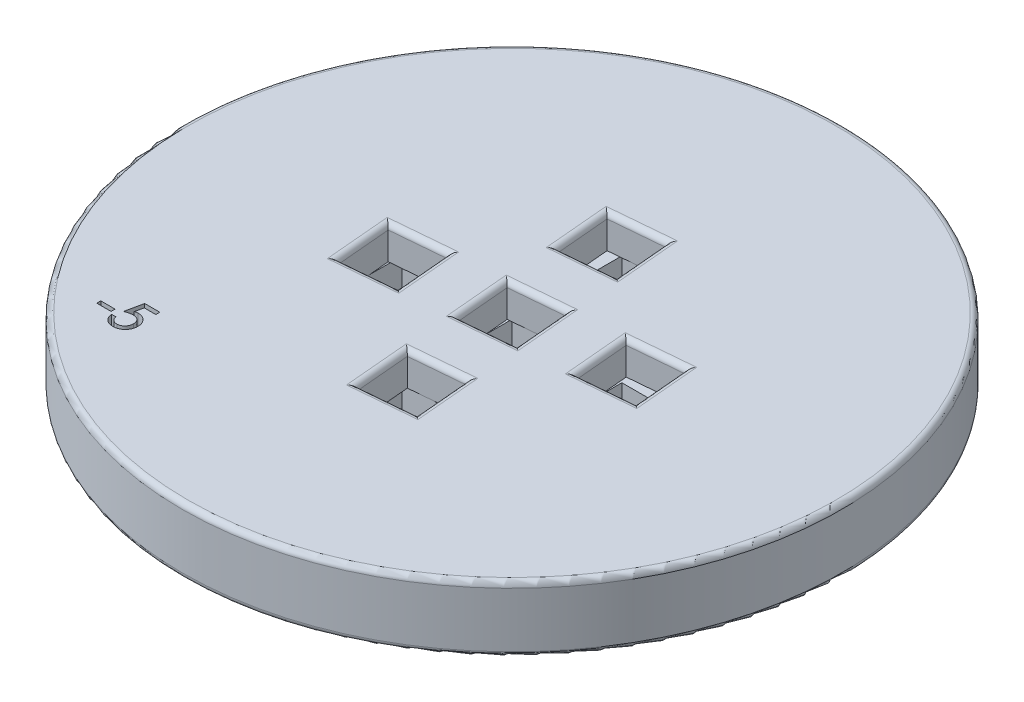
ISO-10303-21;
HEADER;
FILE_DESCRIPTION(('STEP AP214'),'2;1');
FILE_NAME('part.step','',(''),(''),'','','');
FILE_SCHEMA(('AUTOMOTIVE_DESIGN { 1 0 10303 214 1 1 1 1 }'));
ENDSEC;
DATA;
#1=APPLICATION_CONTEXT('core data for automotive mechanical design processes');
#2=APPLICATION_PROTOCOL_DEFINITION('international standard','automotive_design',2000,#1);
#3=PRODUCT_CONTEXT('',#1,'mechanical');
#4=PRODUCT('Part','Part','',(#3));
#5=PRODUCT_RELATED_PRODUCT_CATEGORY('part','',(#4));
#6=PRODUCT_DEFINITION_FORMATION('','',#4);
#7=PRODUCT_DEFINITION_CONTEXT('part definition',#1,'design');
#8=PRODUCT_DEFINITION('design','',#6,#7);
#9=PRODUCT_DEFINITION_SHAPE('','',#8);
#10=(LENGTH_UNIT() NAMED_UNIT(*) SI_UNIT(.MILLI.,.METRE.));
#11=(NAMED_UNIT(*) PLANE_ANGLE_UNIT() SI_UNIT($,.RADIAN.));
#12=(NAMED_UNIT(*) SI_UNIT($,.STERADIAN.) SOLID_ANGLE_UNIT());
#13=UNCERTAINTY_MEASURE_WITH_UNIT(LENGTH_MEASURE(1.E-05),#10,'distance_accuracy_value','');
#14=(GEOMETRIC_REPRESENTATION_CONTEXT(3) GLOBAL_UNCERTAINTY_ASSIGNED_CONTEXT((#13)) GLOBAL_UNIT_ASSIGNED_CONTEXT((#10,
#11,#12)) REPRESENTATION_CONTEXT('',''));
#15=CARTESIAN_POINT('',(0.,0.,0.));
#16=DIRECTION('',(0.,0.,1.));
#17=DIRECTION('',(1.,0.,0.));
#18=AXIS2_PLACEMENT_3D('',#15,#16,#17);
#19=CARTESIAN_POINT('',(0.,3.,0.));
#20=DIRECTION('',(0.,-1.,0.));
#21=DIRECTION('',(0.,0.,-1.));
#22=AXIS2_PLACEMENT_3D('',#19,#20,#21);
#23=PLANE('',#22);
#24=DIRECTION('',(0.,0.,-1.));
#25=VECTOR('',#24,1.);
#26=CARTESIAN_POINT('',(-12.5,3.,-2.5));
#27=LINE('',#26,#25);
#28=CARTESIAN_POINT('',(-12.5,3.,2.5));
#29=VERTEX_POINT('',#28);
#30=CARTESIAN_POINT('',(-12.5,3.,0.545761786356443));
#31=VERTEX_POINT('',#30);
#32=EDGE_CURVE('E1472',#29,#31,#27,.T.);
#33=ORIENTED_EDGE('',*,*,#32,.T.);
#34=DIRECTION('',(0.0871557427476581,0.,0.996194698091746));
#35=VECTOR('',#34,1.);
#36=CARTESIAN_POINT('',(-12.2345443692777,3.,3.57993352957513));
#37=LINE('',#36,#35);
#38=CARTESIAN_POINT('',(-12.329026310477,3.,2.5));
#39=VERTEX_POINT('',#38);
#40=EDGE_CURVE('E603',#31,#39,#37,.T.);
#41=ORIENTED_EDGE('',*,*,#40,.T.);
#42=DIRECTION('',(-1.,0.,0.));
#43=VECTOR('',#42,1.);
#44=CARTESIAN_POINT('',(-7.5,3.,2.5));
#45=LINE('',#44,#43);
#46=EDGE_CURVE('E1464',#39,#29,#45,.T.);
#47=ORIENTED_EDGE('',*,*,#46,.T.);
#48=EDGE_LOOP('',(#33,#41,#47));
#49=FACE_BOUND('',#48,.T.);
#50=ADVANCED_FACE('F33',(#49),#23,.T.);
#51=DIRECTION('',(-0.0871557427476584,0.,-0.996194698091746));
#52=VECTOR('',#51,1.);
#53=CARTESIAN_POINT('',(-7.25357087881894,3.,3.14415481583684));
#54=LINE('',#53,#52);
#55=CARTESIAN_POINT('',(-7.5,3.,0.327457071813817));
#56=VERTEX_POINT('',#55);
#57=CARTESIAN_POINT('',(-7.68934959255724,3.,-1.83681867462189));
#58=VERTEX_POINT('',#57);
#59=EDGE_CURVE('E619',#56,#58,#54,.T.);
#60=ORIENTED_EDGE('',*,*,#59,.T.);
#61=DIRECTION('',(-0.996194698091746,0.,0.0871557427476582));
#62=VECTOR('',#61,1.);
#63=CARTESIAN_POINT('',(-12.670323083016,3.,-1.4010399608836));
#64=LINE('',#63,#62);
#65=CARTESIAN_POINT('',(-12.5,3.,-1.41594129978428));
#66=VERTEX_POINT('',#65);
#67=EDGE_CURVE('E615',#58,#66,#64,.T.);
#68=ORIENTED_EDGE('',*,*,#67,.T.);
#69=CARTESIAN_POINT('',(-12.5,3.,-2.5));
#70=VERTEX_POINT('',#69);
#71=EDGE_CURVE('E1476',#66,#70,#27,.T.);
#72=ORIENTED_EDGE('',*,*,#71,.T.);
#73=DIRECTION('',(1.,0.,0.));
#74=VECTOR('',#73,1.);
#75=CARTESIAN_POINT('',(-7.5,3.,-2.5));
#76=LINE('',#75,#74);
#77=CARTESIAN_POINT('',(-7.5,3.,-2.5));
#78=VERTEX_POINT('',#77);
#79=EDGE_CURVE('E1469',#70,#78,#76,.T.);
#80=ORIENTED_EDGE('',*,*,#79,.T.);
#81=DIRECTION('',(0.,0.,1.));
#82=VECTOR('',#81,1.);
#83=CARTESIAN_POINT('',(-7.5,3.,-2.5));
#84=LINE('',#83,#82);
#85=EDGE_CURVE('E1465',#78,#56,#84,.T.);
#86=ORIENTED_EDGE('',*,*,#85,.T.);
#87=EDGE_LOOP('',(#60,#68,#72,#80,#86));
#88=FACE_BOUND('',#87,.T.);
#89=ADVANCED_FACE('F847',(#88),#23,.T.);
#90=CARTESIAN_POINT('',(0.,3.,0.));
#91=DIRECTION('',(0.,-1.,0.));
#92=DIRECTION('',(0.,0.,-1.));
#93=AXIS2_PLACEMENT_3D('',#90,#91,#92);
#94=PLANE('',#93);
#95=DIRECTION('',(0.,0.,1.));
#96=VECTOR('',#95,1.);
#97=CARTESIAN_POINT('',(12.5,3.,-2.49999999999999));
#98=LINE('',#97,#96);
#99=CARTESIAN_POINT('',(12.5,3.,-2.49999999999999));
#100=VERTEX_POINT('',#99);
#101=CARTESIAN_POINT('',(12.5,3.,-0.545761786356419));
#102=VERTEX_POINT('',#101);
#103=EDGE_CURVE('E1492',#100,#102,#98,.T.);
#104=ORIENTED_EDGE('',*,*,#103,.T.);
#105=DIRECTION('',(-0.0871557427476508,0.,-0.996194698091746));
#106=VECTOR('',#105,1.);
#107=CARTESIAN_POINT('',(12.6703230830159,3.,1.40103996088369));
#108=LINE('',#107,#106);
#109=CARTESIAN_POINT('',(12.329026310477,3.,-2.5));
#110=VERTEX_POINT('',#109);
#111=EDGE_CURVE('E639',#102,#110,#108,.T.);
#112=ORIENTED_EDGE('',*,*,#111,.T.);
#113=DIRECTION('',(1.,0.,0.));
#114=VECTOR('',#113,1.);
#115=CARTESIAN_POINT('',(12.5,3.,-2.49999999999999));
#116=LINE('',#115,#114);
#117=EDGE_CURVE('E1499',#110,#100,#116,.T.);
#118=ORIENTED_EDGE('',*,*,#117,.T.);
#119=EDGE_LOOP('',(#104,#112,#118));
#120=FACE_BOUND('',#119,.T.);
#121=ADVANCED_FACE('F843',(#120),#94,.T.);
#122=DIRECTION('',(0.0871557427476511,0.,0.996194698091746));
#123=VECTOR('',#122,1.);
#124=CARTESIAN_POINT('',(7.68934959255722,3.,1.83681867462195));
#125=LINE('',#124,#123);
#126=CARTESIAN_POINT('',(7.49999999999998,3.,-0.32745707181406));
#127=VERTEX_POINT('',#126);
#128=CARTESIAN_POINT('',(7.68934959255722,3.,1.83681867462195));
#129=VERTEX_POINT('',#128);
#130=EDGE_CURVE('E642',#127,#129,#125,.T.);
#131=ORIENTED_EDGE('',*,*,#130,.T.);
#132=DIRECTION('',(0.996194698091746,0.,-0.0871557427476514));
#133=VECTOR('',#132,1.);
#134=CARTESIAN_POINT('',(12.6703230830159,3.,1.40103996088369));
#135=LINE('',#134,#133);
#136=CARTESIAN_POINT('',(12.5,3.,1.41594129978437));
#137=VERTEX_POINT('',#136);
#138=EDGE_CURVE('E647',#129,#137,#135,.T.);
#139=ORIENTED_EDGE('',*,*,#138,.T.);
#140=CARTESIAN_POINT('',(12.5,3.,2.5));
#141=VERTEX_POINT('',#140);
#142=EDGE_CURVE('E1496',#137,#141,#98,.T.);
#143=ORIENTED_EDGE('',*,*,#142,.T.);
#144=DIRECTION('',(-1.,0.,0.));
#145=VECTOR('',#144,1.);
#146=CARTESIAN_POINT('',(12.5,3.,2.5));
#147=LINE('',#146,#145);
#148=CARTESIAN_POINT('',(7.5,3.,2.5));
#149=VERTEX_POINT('',#148);
#150=EDGE_CURVE('E1481',#141,#149,#147,.T.);
#151=ORIENTED_EDGE('',*,*,#150,.T.);
#152=DIRECTION('',(0.,0.,-1.));
#153=VECTOR('',#152,1.);
#154=CARTESIAN_POINT('',(7.5,3.,-2.49999999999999));
#155=LINE('',#154,#153);
#156=EDGE_CURVE('E1500',#149,#127,#155,.T.);
#157=ORIENTED_EDGE('',*,*,#156,.T.);
#158=EDGE_LOOP('',(#131,#139,#143,#151,#157));
#159=FACE_BOUND('',#158,.T.);
#160=ADVANCED_FACE('F846',(#159),#94,.T.);
#161=CARTESIAN_POINT('',(0.,3.,0.));
#162=DIRECTION('',(0.,-1.,0.));
#163=DIRECTION('',(0.,0.,-1.));
#164=AXIS2_PLACEMENT_3D('',#161,#162,#163);
#165=PLANE('',#164);
#166=DIRECTION('',(-1.,0.,0.));
#167=VECTOR('',#166,1.);
#168=CARTESIAN_POINT('',(2.5,3.,12.5));
#169=LINE('',#168,#167);
#170=CARTESIAN_POINT('',(2.5,3.,12.5));
#171=VERTEX_POINT('',#170);
#172=CARTESIAN_POINT('',(0.545761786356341,3.,12.5));
#173=VERTEX_POINT('',#172);
#174=EDGE_CURVE('E1428',#171,#173,#169,.T.);
#175=ORIENTED_EDGE('',*,*,#174,.T.);
#176=DIRECTION('',(0.996194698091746,0.,-0.0871557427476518));
#177=VECTOR('',#176,1.);
#178=CARTESIAN_POINT('',(3.57993352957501,3.,12.2345443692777));
#179=LINE('',#178,#177);
#180=CARTESIAN_POINT('',(2.5,3.,12.329026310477));
#181=VERTEX_POINT('',#180);
#182=EDGE_CURVE('E678',#173,#181,#179,.T.);
#183=ORIENTED_EDGE('',*,*,#182,.T.);
#184=DIRECTION('',(0.,0.,1.));
#185=VECTOR('',#184,1.);
#186=CARTESIAN_POINT('',(2.5,3.,7.5));
#187=LINE('',#186,#185);
#188=EDGE_CURVE('E1443',#181,#171,#187,.T.);
#189=ORIENTED_EDGE('',*,*,#188,.T.);
#190=EDGE_LOOP('',(#175,#183,#189));
#191=FACE_BOUND('',#190,.T.);
#192=ADVANCED_FACE('F884',(#191),#165,.T.);
#193=DIRECTION('',(-0.996194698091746,0.,0.0871557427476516));
#194=VECTOR('',#193,1.);
#195=CARTESIAN_POINT('',(3.14415481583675,3.,7.25357087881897));
#196=LINE('',#195,#194);
#197=CARTESIAN_POINT('',(0.327457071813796,3.,7.5));
#198=VERTEX_POINT('',#197);
#199=CARTESIAN_POINT('',(-1.83681867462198,3.,7.68934959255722));
#200=VERTEX_POINT('',#199);
#201=EDGE_CURVE('E665',#198,#200,#196,.T.);
#202=ORIENTED_EDGE('',*,*,#201,.T.);
#203=DIRECTION('',(0.0871557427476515,0.,0.996194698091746));
#204=VECTOR('',#203,1.);
#205=CARTESIAN_POINT('',(-1.40103996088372,3.,12.670323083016));
#206=LINE('',#205,#204);
#207=CARTESIAN_POINT('',(-1.4159412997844,3.,12.5));
#208=VERTEX_POINT('',#207);
#209=EDGE_CURVE('E670',#200,#208,#206,.T.);
#210=ORIENTED_EDGE('',*,*,#209,.T.);
#211=CARTESIAN_POINT('',(-2.5,3.,12.5));
#212=VERTEX_POINT('',#211);
#213=EDGE_CURVE('E1440',#208,#212,#169,.T.);
#214=ORIENTED_EDGE('',*,*,#213,.T.);
#215=DIRECTION('',(0.,0.,-1.));
#216=VECTOR('',#215,1.);
#217=CARTESIAN_POINT('',(-2.5,3.,7.5));
#218=LINE('',#217,#216);
#219=CARTESIAN_POINT('',(-2.5,3.,7.5));
#220=VERTEX_POINT('',#219);
#221=EDGE_CURVE('E1448',#212,#220,#218,.T.);
#222=ORIENTED_EDGE('',*,*,#221,.T.);
#223=DIRECTION('',(1.,0.,0.));
#224=VECTOR('',#223,1.);
#225=CARTESIAN_POINT('',(2.5,3.,7.5));
#226=LINE('',#225,#224);
#227=EDGE_CURVE('E1444',#220,#198,#226,.T.);
#228=ORIENTED_EDGE('',*,*,#227,.T.);
#229=EDGE_LOOP('',(#202,#210,#214,#222,#228));
#230=FACE_BOUND('',#229,.T.);
#231=ADVANCED_FACE('F823',(#230),#165,.T.);
#232=CARTESIAN_POINT('',(0.,3.,0.));
#233=DIRECTION('',(0.,-1.,0.));
#234=DIRECTION('',(0.,0.,-1.));
#235=AXIS2_PLACEMENT_3D('',#232,#233,#234);
#236=PLANE('',#235);
#237=DIRECTION('',(1.,0.,0.));
#238=VECTOR('',#237,1.);
#239=CARTESIAN_POINT('',(-2.5,3.,-12.5));
#240=LINE('',#239,#238);
#241=CARTESIAN_POINT('',(-2.5,3.,-12.5));
#242=VERTEX_POINT('',#241);
#243=CARTESIAN_POINT('',(-0.545761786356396,3.,-12.5));
#244=VERTEX_POINT('',#243);
#245=EDGE_CURVE('E1508',#242,#244,#240,.T.);
#246=ORIENTED_EDGE('',*,*,#245,.T.);
#247=DIRECTION('',(-0.996194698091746,0.,0.0871557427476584));
#248=VECTOR('',#247,1.);
#249=CARTESIAN_POINT('',(-3.57993352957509,3.,-12.2345443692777));
#250=LINE('',#249,#248);
#251=CARTESIAN_POINT('',(-2.5,3.,-12.329026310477));
#252=VERTEX_POINT('',#251);
#253=EDGE_CURVE('E706',#244,#252,#250,.T.);
#254=ORIENTED_EDGE('',*,*,#253,.T.);
#255=DIRECTION('',(0.,0.,-1.));
#256=VECTOR('',#255,1.);
#257=CARTESIAN_POINT('',(-2.5,3.,-7.5));
#258=LINE('',#257,#256);
#259=EDGE_CURVE('E1523',#252,#242,#258,.T.);
#260=ORIENTED_EDGE('',*,*,#259,.T.);
#261=EDGE_LOOP('',(#246,#254,#260));
#262=FACE_BOUND('',#261,.T.);
#263=ADVANCED_FACE('F819',(#262),#236,.T.);
#264=DIRECTION('',(0.996194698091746,0.,-0.0871557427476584));
#265=VECTOR('',#264,1.);
#266=CARTESIAN_POINT('',(-3.1441548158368,3.,-7.25357087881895));
#267=LINE('',#266,#265);
#268=CARTESIAN_POINT('',(-0.327457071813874,3.,-7.5));
#269=VERTEX_POINT('',#268);
#270=CARTESIAN_POINT('',(1.83681867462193,3.,-7.68934959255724));
#271=VERTEX_POINT('',#270);
#272=EDGE_CURVE('E693',#269,#271,#267,.T.);
#273=ORIENTED_EDGE('',*,*,#272,.T.);
#274=DIRECTION('',(-0.0871557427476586,0.,-0.996194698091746));
#275=VECTOR('',#274,1.);
#276=CARTESIAN_POINT('',(1.83681867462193,3.,-7.68934959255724));
#277=LINE('',#276,#275);
#278=CARTESIAN_POINT('',(1.41594129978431,3.,-12.5));
#279=VERTEX_POINT('',#278);
#280=EDGE_CURVE('E698',#271,#279,#277,.T.);
#281=ORIENTED_EDGE('',*,*,#280,.T.);
#282=CARTESIAN_POINT('',(2.5,3.,-12.5));
#283=VERTEX_POINT('',#282);
#284=EDGE_CURVE('E1520',#279,#283,#240,.T.);
#285=ORIENTED_EDGE('',*,*,#284,.T.);
#286=DIRECTION('',(0.,0.,1.));
#287=VECTOR('',#286,1.);
#288=CARTESIAN_POINT('',(2.5,3.,-7.5));
#289=LINE('',#288,#287);
#290=CARTESIAN_POINT('',(2.5,3.,-7.5));
#291=VERTEX_POINT('',#290);
#292=EDGE_CURVE('E1290',#283,#291,#289,.T.);
#293=ORIENTED_EDGE('',*,*,#292,.T.);
#294=DIRECTION('',(-1.,0.,0.));
#295=VECTOR('',#294,1.);
#296=CARTESIAN_POINT('',(-2.5,3.,-7.5));
#297=LINE('',#296,#295);
#298=EDGE_CURVE('E1524',#291,#269,#297,.T.);
#299=ORIENTED_EDGE('',*,*,#298,.T.);
#300=EDGE_LOOP('',(#273,#281,#285,#293,#299));
#301=FACE_BOUND('',#300,.T.);
#302=ADVANCED_FACE('F822',(#301),#236,.T.);
#303=CARTESIAN_POINT('',(0.,3.,0.));
#304=DIRECTION('',(0.,-1.,0.));
#305=DIRECTION('',(0.,0.,-1.));
#306=AXIS2_PLACEMENT_3D('',#303,#304,#305);
#307=PLANE('',#306);
#308=DIRECTION('',(0.,0.,-1.));
#309=VECTOR('',#308,1.);
#310=CARTESIAN_POINT('',(-2.5,3.,-2.5));
#311=LINE('',#310,#309);
#312=CARTESIAN_POINT('',(-2.5,3.,2.5));
#313=VERTEX_POINT('',#312);
#314=CARTESIAN_POINT('',(-2.5,3.,0.109152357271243));
#315=VERTEX_POINT('',#314);
#316=EDGE_CURVE('E1419',#313,#315,#311,.T.);
#317=ORIENTED_EDGE('',*,*,#316,.T.);
#318=DIRECTION('',(0.0871557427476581,0.,0.996194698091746));
#319=VECTOR('',#318,1.);
#320=CARTESIAN_POINT('',(-2.27259738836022,3.,2.70837610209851));
#321=LINE('',#320,#319);
#322=CARTESIAN_POINT('',(-2.29082793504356,3.,2.5));
#323=VERTEX_POINT('',#322);
#324=EDGE_CURVE('E723',#315,#323,#321,.T.);
#325=ORIENTED_EDGE('',*,*,#324,.T.);
#326=DIRECTION('',(-1.,0.,0.));
#327=VECTOR('',#326,1.);
#328=CARTESIAN_POINT('',(2.5,3.,2.5));
#329=LINE('',#328,#327);
#330=EDGE_CURVE('E1408',#323,#313,#329,.T.);
#331=ORIENTED_EDGE('',*,*,#330,.T.);
#332=EDGE_LOOP('',(#317,#325,#331));
#333=FACE_BOUND('',#332,.T.);
#334=ADVANCED_FACE('F904',(#333),#307,.T.);
#335=DIRECTION('',(1.,0.,0.));
#336=VECTOR('',#335,1.);
#337=CARTESIAN_POINT('',(2.5,3.,-2.5));
#338=LINE('',#337,#336);
#339=CARTESIAN_POINT('',(-2.5,3.,-2.5));
#340=VERTEX_POINT('',#339);
#341=CARTESIAN_POINT('',(-0.10915235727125,3.,-2.5));
#342=VERTEX_POINT('',#341);
#343=EDGE_CURVE('E1414',#340,#342,#338,.T.);
#344=ORIENTED_EDGE('',*,*,#343,.T.);
#345=DIRECTION('',(-0.996194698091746,0.,0.0871557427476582));
#346=VECTOR('',#345,1.);
#347=CARTESIAN_POINT('',(-2.70837610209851,3.,-2.27259738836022));
#348=LINE('',#347,#346);
#349=CARTESIAN_POINT('',(-2.5,3.,-2.29082793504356));
#350=VERTEX_POINT('',#349);
#351=EDGE_CURVE('E738',#342,#350,#348,.T.);
#352=ORIENTED_EDGE('',*,*,#351,.T.);
#353=EDGE_CURVE('E1423',#350,#340,#311,.T.);
#354=ORIENTED_EDGE('',*,*,#353,.T.);
#355=EDGE_LOOP('',(#344,#352,#354));
#356=FACE_BOUND('',#355,.T.);
#357=ADVANCED_FACE('F907',(#356),#307,.T.);
#358=DIRECTION('',(0.,0.,1.));
#359=VECTOR('',#358,1.);
#360=CARTESIAN_POINT('',(2.5,3.,-2.5));
#361=LINE('',#360,#359);
#362=CARTESIAN_POINT('',(2.5,3.,-2.5));
#363=VERTEX_POINT('',#362);
#364=CARTESIAN_POINT('',(2.49999999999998,3.,-0.109152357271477));
#365=VERTEX_POINT('',#364);
#366=EDGE_CURVE('E1409',#363,#365,#361,.T.);
#367=ORIENTED_EDGE('',*,*,#366,.T.);
#368=DIRECTION('',(-0.0871557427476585,0.,-0.996194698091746));
#369=VECTOR('',#368,1.);
#370=CARTESIAN_POINT('',(2.70837610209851,3.,2.27259738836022));
#371=LINE('',#370,#369);
#372=CARTESIAN_POINT('',(2.29082793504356,3.,-2.5));
#373=VERTEX_POINT('',#372);
#374=EDGE_CURVE('E733',#365,#373,#371,.T.);
#375=ORIENTED_EDGE('',*,*,#374,.T.);
#376=EDGE_CURVE('E1418',#373,#363,#338,.T.);
#377=ORIENTED_EDGE('',*,*,#376,.T.);
#378=EDGE_LOOP('',(#367,#375,#377));
#379=FACE_BOUND('',#378,.T.);
#380=ADVANCED_FACE('F2584',(#379),#307,.T.);
#381=CARTESIAN_POINT('',(2.5,3.,2.5));
#382=VERTEX_POINT('',#381);
#383=CARTESIAN_POINT('',(0.109152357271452,3.,2.49999999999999));
#384=VERTEX_POINT('',#383);
#385=EDGE_CURVE('E1397',#382,#384,#329,.T.);
#386=ORIENTED_EDGE('',*,*,#385,.T.);
#387=DIRECTION('',(0.996194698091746,0.,-0.0871557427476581));
#388=VECTOR('',#387,1.);
#389=CARTESIAN_POINT('',(-2.27259738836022,3.,2.70837610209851));
#390=LINE('',#389,#388);
#391=CARTESIAN_POINT('',(2.5,3.,2.29082793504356));
#392=VERTEX_POINT('',#391);
#393=EDGE_CURVE('E728',#384,#392,#390,.T.);
#394=ORIENTED_EDGE('',*,*,#393,.T.);
#395=EDGE_CURVE('E1413',#392,#382,#361,.T.);
#396=ORIENTED_EDGE('',*,*,#395,.T.);
#397=EDGE_LOOP('',(#386,#394,#396));
#398=FACE_BOUND('',#397,.T.);
#399=ADVANCED_FACE('F909',(#398),#307,.T.);
#400=CARTESIAN_POINT('',(0.,6.,0.));
#401=DIRECTION('',(0.,1.,0.));
#402=DIRECTION('',(0.,0.,1.));
#403=AXIS2_PLACEMENT_3D('',#400,#401,#402);
#404=PLANE('',#403);
#405=DIRECTION('',(-0.0871557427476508,0.,-0.996194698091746));
#406=VECTOR('',#405,1.);
#407=CARTESIAN_POINT('',(13.1684204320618,6.,1.35746208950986));
#408=LINE('',#407,#406);
#409=CARTESIAN_POINT('',(12.6890638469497,6.,-4.12160874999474));
#410=VERTEX_POINT('',#409);
#411=CARTESIAN_POINT('',(13.2119983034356,6.,1.85555943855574));
#412=VERTEX_POINT('',#411);
#413=EDGE_CURVE('E1195',#410,#412,#408,.F.);
#414=ORIENTED_EDGE('',*,*,#413,.T.);
#415=DIRECTION('',(0.996194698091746,0.,-0.0871557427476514));
#416=VECTOR('',#415,1.);
#417=CARTESIAN_POINT('',(7.73292746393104,6.,2.33491602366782));
#418=LINE('',#417,#416);
#419=CARTESIAN_POINT('',(7.23483011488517,6.,2.37849389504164));
#420=VERTEX_POINT('',#419);
#421=EDGE_CURVE('E1192',#412,#420,#418,.F.);
#422=ORIENTED_EDGE('',*,*,#421,.T.);
#423=DIRECTION('',(0.0871557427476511,0.,0.996194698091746));
#424=VECTOR('',#423,1.);
#425=CARTESIAN_POINT('',(6.75547352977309,6.,-3.10057694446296));
#426=LINE('',#425,#424);
#427=CARTESIAN_POINT('',(6.71189565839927,6.,-3.59867429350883));
#428=VERTEX_POINT('',#427);
#429=EDGE_CURVE('E1197',#420,#428,#426,.F.);
#430=ORIENTED_EDGE('',*,*,#429,.T.);
#431=DIRECTION('',(-0.996194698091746,0.,0.0871557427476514));
#432=VECTOR('',#431,1.);
#433=CARTESIAN_POINT('',(12.1909664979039,6.,-4.07803087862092));
#434=LINE('',#433,#432);
#435=EDGE_CURVE('E1199',#428,#410,#434,.F.);
#436=ORIENTED_EDGE('',*,*,#435,.T.);
#437=EDGE_LOOP('',(#414,#422,#430,#436));
#438=FACE_BOUND('',#437,.T.);
#439=DIRECTION('',(-0.0871557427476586,0.,-0.996194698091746));
#440=VECTOR('',#439,1.);
#441=CARTESIAN_POINT('',(2.3349160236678,6.,-7.73292746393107));
#442=LINE('',#441,#440);
#443=CARTESIAN_POINT('',(1.85555943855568,6.,-13.2119983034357));
#444=VERTEX_POINT('',#443);
#445=CARTESIAN_POINT('',(2.37849389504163,6.,-7.2348301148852));
#446=VERTEX_POINT('',#445);
#447=EDGE_CURVE('E1204',#444,#446,#442,.F.);
#448=ORIENTED_EDGE('',*,*,#447,.T.);
#449=DIRECTION('',(0.996194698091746,0.,-0.0871557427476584));
#450=VECTOR('',#449,1.);
#451=CARTESIAN_POINT('',(-3.10057694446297,6.,-6.75547352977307));
#452=LINE('',#451,#450);
#453=CARTESIAN_POINT('',(-3.59867429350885,6.,-6.71189565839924));
#454=VERTEX_POINT('',#453);
#455=EDGE_CURVE('E1201',#446,#454,#452,.F.);
#456=ORIENTED_EDGE('',*,*,#455,.T.);
#457=DIRECTION('',(0.087155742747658,0.,0.996194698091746));
#458=VECTOR('',#457,1.);
#459=CARTESIAN_POINT('',(-4.07803087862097,6.,-12.1909664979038));
#460=LINE('',#459,#458);
#461=CARTESIAN_POINT('',(-4.1216087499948,6.,-12.6890638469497));
#462=VERTEX_POINT('',#461);
#463=EDGE_CURVE('E1208',#454,#462,#460,.F.);
#464=ORIENTED_EDGE('',*,*,#463,.T.);
#465=DIRECTION('',(-0.996194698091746,0.,0.0871557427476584));
#466=VECTOR('',#465,1.);
#467=CARTESIAN_POINT('',(1.3574620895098,6.,-13.1684204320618));
#468=LINE('',#467,#466);
#469=EDGE_CURVE('E1206',#462,#444,#468,.F.);
#470=ORIENTED_EDGE('',*,*,#469,.T.);
#471=EDGE_LOOP('',(#448,#456,#464,#470));
#472=FACE_BOUND('',#471,.T.);
#473=DIRECTION('',(-0.0871557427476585,0.,-0.996194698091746));
#474=VECTOR('',#473,1.);
#475=CARTESIAN_POINT('',(3.20647345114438,6.,2.22901951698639));
#476=LINE('',#475,#474);
#477=CARTESIAN_POINT('',(2.72711686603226,6.,-3.25005132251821));
#478=VERTEX_POINT('',#477);
#479=CARTESIAN_POINT('',(3.25005132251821,6.,2.72711686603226));
#480=VERTEX_POINT('',#479);
#481=EDGE_CURVE('E1217',#478,#480,#476,.F.);
#482=ORIENTED_EDGE('',*,*,#481,.T.);
#483=DIRECTION('',(0.996194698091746,0.,-0.0871557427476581));
#484=VECTOR('',#483,1.);
#485=CARTESIAN_POINT('',(-2.22901951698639,6.,3.20647345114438));
#486=LINE('',#485,#484);
#487=CARTESIAN_POINT('',(-2.72711686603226,6.,3.25005132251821));
#488=VERTEX_POINT('',#487);
#489=EDGE_CURVE('E1210',#480,#488,#486,.F.);
#490=ORIENTED_EDGE('',*,*,#489,.T.);
#491=DIRECTION('',(0.0871557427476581,0.,0.996194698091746));
#492=VECTOR('',#491,1.);
#493=CARTESIAN_POINT('',(-3.20647345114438,6.,-2.22901951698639));
#494=LINE('',#493,#492);
#495=CARTESIAN_POINT('',(-3.25005132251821,6.,-2.72711686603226));
#496=VERTEX_POINT('',#495);
#497=EDGE_CURVE('E1213',#488,#496,#494,.F.);
#498=ORIENTED_EDGE('',*,*,#497,.T.);
#499=DIRECTION('',(-0.996194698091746,0.,0.0871557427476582));
#500=VECTOR('',#499,1.);
#501=CARTESIAN_POINT('',(2.22901951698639,6.,-3.20647345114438));
#502=LINE('',#501,#500);
#503=EDGE_CURVE('E1215',#496,#478,#502,.F.);
#504=ORIENTED_EDGE('',*,*,#503,.T.);
#505=EDGE_LOOP('',(#482,#490,#498,#504));
#506=FACE_BOUND('',#505,.T.);
#507=DIRECTION('',(-0.0871557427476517,0.,-0.996194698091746));
#508=VECTOR('',#507,1.);
#509=CARTESIAN_POINT('',(4.07803087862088,6.,12.1909664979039));
#510=LINE('',#509,#508);
#511=CARTESIAN_POINT('',(3.5986742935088,6.,6.71189565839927));
#512=VERTEX_POINT('',#511);
#513=CARTESIAN_POINT('',(4.12160874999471,6.,12.6890638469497));
#514=VERTEX_POINT('',#513);
#515=EDGE_CURVE('E1222',#512,#514,#510,.F.);
#516=ORIENTED_EDGE('',*,*,#515,.T.);
#517=DIRECTION('',(0.996194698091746,0.,-0.0871557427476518));
#518=VECTOR('',#517,1.);
#519=CARTESIAN_POINT('',(-1.3574620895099,6.,13.1684204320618));
#520=LINE('',#519,#518);
#521=CARTESIAN_POINT('',(-1.85555943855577,6.,13.2119983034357));
#522=VERTEX_POINT('',#521);
#523=EDGE_CURVE('E1219',#514,#522,#520,.F.);
#524=ORIENTED_EDGE('',*,*,#523,.T.);
#525=DIRECTION('',(0.0871557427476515,0.,0.996194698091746));
#526=VECTOR('',#525,1.);
#527=CARTESIAN_POINT('',(-2.33491602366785,6.,7.73292746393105));
#528=LINE('',#527,#526);
#529=CARTESIAN_POINT('',(-2.37849389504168,6.,7.23483011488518));
#530=VERTEX_POINT('',#529);
#531=EDGE_CURVE('E1226',#522,#530,#528,.F.);
#532=ORIENTED_EDGE('',*,*,#531,.T.);
#533=DIRECTION('',(-0.996194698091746,0.,0.0871557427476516));
#534=VECTOR('',#533,1.);
#535=CARTESIAN_POINT('',(3.10057694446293,6.,6.75547352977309));
#536=LINE('',#535,#534);
#537=EDGE_CURVE('E1224',#530,#512,#536,.F.);
#538=ORIENTED_EDGE('',*,*,#537,.T.);
#539=EDGE_LOOP('',(#516,#524,#532,#538));
#540=FACE_BOUND('',#539,.T.);
#541=DIRECTION('',(-0.0871557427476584,0.,-0.996194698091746));
#542=VECTOR('',#541,1.);
#543=CARTESIAN_POINT('',(-6.75547352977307,6.,3.10057694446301));
#544=LINE('',#543,#542);
#545=CARTESIAN_POINT('',(-7.23483011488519,6.,-2.37849389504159));
#546=VERTEX_POINT('',#545);
#547=CARTESIAN_POINT('',(-6.71189565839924,6.,3.59867429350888));
#548=VERTEX_POINT('',#547);
#549=EDGE_CURVE('E1230',#546,#548,#544,.F.);
#550=ORIENTED_EDGE('',*,*,#549,.T.);
#551=DIRECTION('',(0.996194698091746,0.,-0.0871557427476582));
#552=VECTOR('',#551,1.);
#553=CARTESIAN_POINT('',(-12.1909664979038,6.,4.078030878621));
#554=LINE('',#553,#552);
#555=CARTESIAN_POINT('',(-12.6890638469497,6.,4.12160874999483));
#556=VERTEX_POINT('',#555);
#557=EDGE_CURVE('E1228',#548,#556,#554,.F.);
#558=ORIENTED_EDGE('',*,*,#557,.T.);
#559=DIRECTION('',(0.087155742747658,0.,0.996194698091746));
#560=VECTOR('',#559,1.);
#561=CARTESIAN_POINT('',(-13.1684204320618,6.,-1.35746208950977));
#562=LINE('',#561,#560);
#563=CARTESIAN_POINT('',(-13.2119983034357,6.,-1.85555943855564));
#564=VERTEX_POINT('',#563);
#565=EDGE_CURVE('E1104',#556,#564,#562,.F.);
#566=ORIENTED_EDGE('',*,*,#565,.T.);
#567=DIRECTION('',(-0.996194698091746,0.,0.0871557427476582));
#568=VECTOR('',#567,1.);
#569=CARTESIAN_POINT('',(-7.73292746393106,6.,-2.33491602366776));
#570=LINE('',#569,#568);
#571=EDGE_CURVE('E1232',#564,#546,#570,.F.);
#572=ORIENTED_EDGE('',*,*,#571,.T.);
#573=EDGE_LOOP('',(#550,#558,#566,#572));
#574=FACE_BOUND('',#573,.T.);
#575=DIRECTION('',(-1.,0.,0.));
#576=VECTOR('',#575,1.);
#577=CARTESIAN_POINT('',(-18.3677875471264,6.,18.1288503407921));
#578=LINE('',#577,#576);
#579=CARTESIAN_POINT('',(-18.3677875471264,6.,18.1288503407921));
#580=VERTEX_POINT('',#579);
#581=CARTESIAN_POINT('',(-19.6703516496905,6.,18.1288503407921));
#582=VERTEX_POINT('',#581);
#583=EDGE_CURVE('E1540',#580,#582,#578,.T.);
#584=ORIENTED_EDGE('',*,*,#583,.T.);
#585=DIRECTION('',(0.,0.,-1.));
#586=VECTOR('',#585,1.);
#587=CARTESIAN_POINT('',(-19.6703516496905,6.,18.1288503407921));
#588=LINE('',#587,#586);
#589=CARTESIAN_POINT('',(-19.6703516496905,6.,17.762504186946));
#590=VERTEX_POINT('',#589);
#591=EDGE_CURVE('E1550',#582,#590,#588,.T.);
#592=ORIENTED_EDGE('',*,*,#591,.T.);
#593=DIRECTION('',(1.,0.,0.));
#594=VECTOR('',#593,1.);
#595=CARTESIAN_POINT('',(-19.6703516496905,6.,17.762504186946));
#596=LINE('',#595,#594);
#597=CARTESIAN_POINT('',(-18.3677875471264,6.,17.762504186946));
#598=VERTEX_POINT('',#597);
#599=EDGE_CURVE('E1547',#590,#598,#596,.T.);
#600=ORIENTED_EDGE('',*,*,#599,.T.);
#601=DIRECTION('',(0.,0.,1.));
#602=VECTOR('',#601,1.);
#603=CARTESIAN_POINT('',(-18.3677875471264,6.,17.762504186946));
#604=LINE('',#603,#602);
#605=EDGE_CURVE('E1544',#598,#580,#604,.T.);
#606=ORIENTED_EDGE('',*,*,#605,.T.);
#607=EDGE_LOOP('',(#584,#592,#600,#606));
#608=FACE_BOUND('',#607,.T.);
#609=CARTESIAN_POINT('',(0.,6.,0.));
#610=DIRECTION('',(0.,1.,0.));
#611=DIRECTION('',(0.,0.,1.));
#612=AXIS2_PLACEMENT_3D('',#609,#610,#611);
#613=CIRCLE('',#612,29.5);
#614=CARTESIAN_POINT('',(0.,6.,29.5));
#615=VERTEX_POINT('',#614);
#616=EDGE_CURVE('E1241',#615,#615,#613,.T.);
#617=ORIENTED_EDGE('',*,*,#616,.T.);
#618=EDGE_LOOP('',(#617));
#619=FACE_BOUND('',#618,.T.);
#620=DIRECTION('',(0.205457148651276,0.,-0.978666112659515));
#621=VECTOR('',#620,1.);
#622=CARTESIAN_POINT('',(-17.7979157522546,6.,17.5589785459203));
#623=LINE('',#622,#621);
#624=CARTESIAN_POINT('',(-17.7979157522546,6.,17.5589785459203));
#625=VERTEX_POINT('',#624);
#626=CARTESIAN_POINT('',(-17.4646425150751,6.,15.9714785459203));
#627=VERTEX_POINT('',#626);
#628=EDGE_CURVE('E755',#625,#627,#623,.T.);
#629=ORIENTED_EDGE('',*,*,#628,.T.);
#630=DIRECTION('',(1.,0.,0.));
#631=VECTOR('',#630,1.);
#632=CARTESIAN_POINT('',(-17.4646425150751,6.,15.9714785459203));
#633=LINE('',#632,#631);
#634=CARTESIAN_POINT('',(-16.0883003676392,6.,15.9714785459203));
#635=VERTEX_POINT('',#634);
#636=EDGE_CURVE('E742',#627,#635,#633,.T.);
#637=ORIENTED_EDGE('',*,*,#636,.T.);
#638=DIRECTION('',(0.,0.,1.));
#639=VECTOR('',#638,1.);
#640=CARTESIAN_POINT('',(-16.0883003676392,6.,15.9714785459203));
#641=LINE('',#640,#639);
#642=CARTESIAN_POINT('',(-16.0883003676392,6.,16.3378246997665));
#643=VERTEX_POINT('',#642);
#644=EDGE_CURVE('E1666',#635,#643,#641,.T.);
#645=ORIENTED_EDGE('',*,*,#644,.T.);
#646=DIRECTION('',(-1.,0.,0.));
#647=VECTOR('',#646,1.);
#648=CARTESIAN_POINT('',(-16.0883003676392,6.,16.3378246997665));
#649=LINE('',#648,#647);
#650=CARTESIAN_POINT('',(-17.1313692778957,6.,16.3378246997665));
#651=VERTEX_POINT('',#650);
#652=EDGE_CURVE('E1663',#643,#651,#649,.T.);
#653=ORIENTED_EDGE('',*,*,#652,.T.);
#654=DIRECTION('',(-0.220944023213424,0.,0.97528649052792));
#655=VECTOR('',#654,1.);
#656=CARTESIAN_POINT('',(-17.1313692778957,6.,16.3378246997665));
#657=LINE('',#656,#655);
#658=CARTESIAN_POINT('',(-17.3018220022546,6.,17.0902335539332));
#659=VERTEX_POINT('',#658);
#660=EDGE_CURVE('E1657',#651,#659,#657,.T.);
#661=ORIENTED_EDGE('',*,*,#660,.T.);
#662=CARTESIAN_POINT('',(-17.3018220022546,6.,17.0902335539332));
#663=CARTESIAN_POINT('',(-17.2819365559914,6.,17.0806501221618));
#664=CARTESIAN_POINT('',(-17.2410121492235,6.,17.0609273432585));
#665=CARTESIAN_POINT('',(-17.1725927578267,6.,17.0437427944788));
#666=CARTESIAN_POINT('',(-17.0983087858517,6.,17.0316517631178));
#667=CARTESIAN_POINT('',(-17.0464130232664,6.,17.0304412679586));
#668=CARTESIAN_POINT('',(-17.0194301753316,6.,17.0298118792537));
#669=B_SPLINE_CURVE_WITH_KNOTS('',3,(#662,#663,#664,#665,#666,#667,#668),.UNSPECIFIED.,.F.,.F.,
(4,1,1,1,4),(0.,0.226644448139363,0.466436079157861,0.722577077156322,1.),.UNSPECIFIED.);
#670=CARTESIAN_POINT('',(-17.0194301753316,6.,17.0298118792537));
#671=VERTEX_POINT('',#670);
#672=EDGE_CURVE('E1649',#659,#671,#669,.T.);
#673=ORIENTED_EDGE('',*,*,#672,.T.);
#674=CARTESIAN_POINT('',(-17.0194301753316,6.,17.0298118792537));
#675=CARTESIAN_POINT('',(-16.9812142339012,6.,17.0305115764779));
#676=CARTESIAN_POINT('',(-16.9061836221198,6.,17.0318853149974));
#677=CARTESIAN_POINT('',(-16.7968325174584,6.,17.0472363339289));
#678=CARTESIAN_POINT('',(-16.6926312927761,6.,17.0702342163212));
#679=CARTESIAN_POINT('',(-16.594437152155,6.,17.1045427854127));
#680=CARTESIAN_POINT('',(-16.5011287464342,6.,17.1467782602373));
#681=CARTESIAN_POINT('',(-16.4137183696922,6.,17.1996298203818));
#682=CARTESIAN_POINT('',(-16.3322968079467,6.,17.2622009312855));
#683=CARTESIAN_POINT('',(-16.2569729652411,6.,17.3334261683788));
#684=CARTESIAN_POINT('',(-16.1883218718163,6.,17.4110075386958));
#685=CARTESIAN_POINT('',(-16.1293598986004,6.,17.49478787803));
#686=CARTESIAN_POINT('',(-16.0782499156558,6.,17.5823196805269));
#687=CARTESIAN_POINT('',(-16.0377374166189,6.,17.6751155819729));
#688=CARTESIAN_POINT('',(-16.0057283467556,6.,17.7722157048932));
#689=CARTESIAN_POINT('',(-15.9829643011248,6.,17.8740258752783));
#690=CARTESIAN_POINT('',(-15.9684925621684,6.,17.9802410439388));
#691=CARTESIAN_POINT('',(-15.9669611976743,6.,18.0526929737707));
#692=CARTESIAN_POINT('',(-15.9661849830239,6.,18.0894172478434));
#693=B_SPLINE_CURVE_WITH_KNOTS('',3,(#674,#675,#676,#677,#678,#679,#680,#681,#682,#683,#684,
#685,#686,#687,#688,#689,#690,#691,#692),.UNSPECIFIED.,.F.,.F.,(4,1,1,1,1,1,1,1,1,1,1,1,1,1,1,1,
4),(0.,0.0684308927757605,0.134352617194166,0.197478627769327,0.259348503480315,
0.320372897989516,0.380701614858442,0.441942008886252,0.504021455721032,0.566203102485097,
0.627233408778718,0.687310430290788,0.747520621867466,0.808306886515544,0.870237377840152,
0.934226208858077,1.),.UNSPECIFIED.);
#694=CARTESIAN_POINT('',(-15.9661849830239,6.,18.0894172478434));
#695=VERTEX_POINT('',#694);
#696=EDGE_CURVE('E1641',#671,#695,#693,.T.);
#697=ORIENTED_EDGE('',*,*,#696,.T.);
#698=CARTESIAN_POINT('',(-15.9661849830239,6.,18.0894172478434));
#699=CARTESIAN_POINT('',(-15.9667818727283,6.,18.1150793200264));
#700=CARTESIAN_POINT('',(-15.9679626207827,6.,18.1658432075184));
#701=CARTESIAN_POINT('',(-15.9741153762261,6.,18.2413258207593));
#702=CARTESIAN_POINT('',(-15.9858598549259,6.,18.315180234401));
#703=CARTESIAN_POINT('',(-16.0014534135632,6.,18.3879769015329));
#704=CARTESIAN_POINT('',(-16.0229401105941,6.,18.4590917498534));
#705=CARTESIAN_POINT('',(-16.047399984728,6.,18.5294702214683));
#706=CARTESIAN_POINT('',(-16.0774508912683,6.,18.5979903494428));
#707=CARTESIAN_POINT('',(-16.1117588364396,6.,18.6646235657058));
#708=CARTESIAN_POINT('',(-16.1498232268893,6.,18.7288822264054));
#709=CARTESIAN_POINT('',(-16.1917338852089,6.,18.7899868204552));
#710=CARTESIAN_POINT('',(-16.2375865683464,6.,18.8474488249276));
#711=CARTESIAN_POINT('',(-16.2875439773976,6.,18.9007872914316));
#712=CARTESIAN_POINT('',(-16.34024053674,6.,18.9513740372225));
#713=CARTESIAN_POINT('',(-16.3970508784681,6.,18.9978887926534));
#714=CARTESIAN_POINT('',(-16.4578135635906,6.,19.0405269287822));
#715=CARTESIAN_POINT('',(-16.5216618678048,6.,19.079754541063));
#716=CARTESIAN_POINT('',(-16.5885652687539,6.,19.1151937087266));
#717=CARTESIAN_POINT('',(-16.6589169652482,6.,19.1445366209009));
#718=CARTESIAN_POINT('',(-16.7309704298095,6.,19.1711973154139));
#719=CARTESIAN_POINT('',(-16.8065077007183,6.,19.1911600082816));
#720=CARTESIAN_POINT('',(-16.8841044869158,6.,19.2079578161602));
#721=CARTESIAN_POINT('',(-16.9646920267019,6.,19.2191053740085));
#722=CARTESIAN_POINT('',(-17.0477054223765,6.,19.2263733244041));
#723=CARTESIAN_POINT('',(-17.1040046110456,6.,19.2273778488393));
#724=CARTESIAN_POINT('',(-17.1326413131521,6.,19.2278888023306));
#725=B_SPLINE_CURVE_WITH_KNOTS('',3,(#698,#699,#700,#701,#702,#703,#704,#705,#706,#707,#708,
#709,#710,#711,#712,#713,#714,#715,#716,#717,#718,#719,#720,#721,#722,#723,#724),.UNSPECIFIED.,
.F.,.F.,(4,1,1,1,1,1,1,1,1,1,1,1,1,1,1,1,1,1,1,1,1,1,1,1,4),(0.,0.0421781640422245,
0.0834354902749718,0.124332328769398,0.16499253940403,0.205670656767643,0.246330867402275,
0.287365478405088,0.328500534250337,0.369428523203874,0.410015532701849,0.450169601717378,
0.490105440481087,0.530026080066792,0.57012872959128,0.610628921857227,0.651917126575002,
0.693212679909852,0.734887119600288,0.77709405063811,0.819352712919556,0.86315152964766,
0.907494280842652,0.952946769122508,1.),.UNSPECIFIED.);
#726=CARTESIAN_POINT('',(-17.1326413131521,6.,19.2278888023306));
#727=VERTEX_POINT('',#726);
#728=EDGE_CURVE('E1633',#695,#727,#725,.T.);
#729=ORIENTED_EDGE('',*,*,#728,.T.);
#730=CARTESIAN_POINT('',(-17.1326413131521,6.,19.2278888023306));
#731=CARTESIAN_POINT('',(-17.1648946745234,6.,19.2271144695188));
#732=CARTESIAN_POINT('',(-17.2285238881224,6.,19.2255868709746));
#733=CARTESIAN_POINT('',(-17.3219764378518,6.,19.2147519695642));
#734=CARTESIAN_POINT('',(-17.4116288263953,6.,19.1963683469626));
#735=CARTESIAN_POINT('',(-17.4971011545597,6.,19.1700524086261));
#736=CARTESIAN_POINT('',(-17.5790293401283,6.,19.1370449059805));
#737=CARTESIAN_POINT('',(-17.6567148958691,6.,19.0962127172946));
#738=CARTESIAN_POINT('',(-17.7304597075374,6.,19.0479223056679));
#739=CARTESIAN_POINT('',(-17.8003587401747,6.,18.9930942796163));
#740=CARTESIAN_POINT('',(-17.8641094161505,6.,18.9305501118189));
#741=CARTESIAN_POINT('',(-17.9228734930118,6.,18.8632192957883));
#742=CARTESIAN_POINT('',(-17.972940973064,6.,18.7886228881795));
#743=CARTESIAN_POINT('',(-18.0169851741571,6.,18.7088194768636));
#744=CARTESIAN_POINT('',(-18.0548288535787,6.,18.6231599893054));
#745=CARTESIAN_POINT('',(-18.0849354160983,6.,18.5314820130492));
#746=CARTESIAN_POINT('',(-18.1090091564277,6.,18.4341327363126));
#747=CARTESIAN_POINT('',(-18.1186311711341,6.,18.3668292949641));
#748=CARTESIAN_POINT('',(-18.1235567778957,6.,18.3323759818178));
#749=B_SPLINE_CURVE_WITH_KNOTS('',3,(#730,#731,#732,#733,#734,#735,#736,#737,#738,#739,#740,
#741,#742,#743,#744,#745,#746,#747,#748),.UNSPECIFIED.,.F.,.F.,(4,1,1,1,1,1,1,1,1,1,1,1,1,1,1,1,
4),(0.,0.0655981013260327,0.129411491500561,0.191065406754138,0.251494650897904,
0.311073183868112,0.370482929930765,0.429688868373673,0.490167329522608,0.550854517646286,
0.611098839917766,0.671620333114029,0.733191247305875,0.796329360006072,0.861785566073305,
0.929246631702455,1.),.UNSPECIFIED.);
#750=CARTESIAN_POINT('',(-18.1235567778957,6.,18.3323759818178));
#751=VERTEX_POINT('',#750);
#752=EDGE_CURVE('E1628',#727,#751,#749,.T.);
#753=ORIENTED_EDGE('',*,*,#752,.T.);
#754=DIRECTION('',(1.,0.,0.));
#755=VECTOR('',#754,1.);
#756=CARTESIAN_POINT('',(-18.1235567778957,6.,18.3323759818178));
#757=LINE('',#756,#755);
#758=CARTESIAN_POINT('',(-17.7260457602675,6.,18.3323759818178));
#759=VERTEX_POINT('',#758);
#760=EDGE_CURVE('E1622',#751,#759,#757,.T.);
#761=ORIENTED_EDGE('',*,*,#760,.T.);
#762=CARTESIAN_POINT('',(-17.7260457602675,6.,18.3323759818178));
#763=CARTESIAN_POINT('',(-17.7184802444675,6.,18.3656495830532));
#764=CARTESIAN_POINT('',(-17.7042779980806,6.,18.4281119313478));
#765=CARTESIAN_POINT('',(-17.6737674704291,6.,18.5132211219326));
#766=CARTESIAN_POINT('',(-17.6410668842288,6.,18.5856071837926));
#767=CARTESIAN_POINT('',(-17.6010711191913,6.,18.6448064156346));
#768=CARTESIAN_POINT('',(-17.5551661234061,6.,18.6933998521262));
#769=CARTESIAN_POINT('',(-17.5042148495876,6.,18.7355803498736));
#770=CARTESIAN_POINT('',(-17.4482385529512,6.,18.7734171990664));
#771=CARTESIAN_POINT('',(-17.386614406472,6.,18.8048250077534));
#772=CARTESIAN_POINT('',(-17.3216865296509,6.,18.8302703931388));
#773=CARTESIAN_POINT('',(-17.2542242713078,6.,18.8480295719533));
#774=CARTESIAN_POINT('',(-17.1855900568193,6.,18.8591964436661));
#775=CARTESIAN_POINT('',(-17.1392549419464,6.,18.8607609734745));
#776=CARTESIAN_POINT('',(-17.1161048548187,6.,18.8615426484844));
#777=B_SPLINE_CURVE_WITH_KNOTS('',3,(#762,#763,#764,#765,#766,#767,#768,#769,#770,#771,#772,
#773,#774,#775,#776),.UNSPECIFIED.,.F.,.F.,(4,1,1,1,1,1,1,1,1,1,1,1,4),(0.,0.115454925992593,
0.21673595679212,0.30570112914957,0.383765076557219,0.45742554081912,0.531337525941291,
0.607408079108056,0.685762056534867,0.765096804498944,0.84312111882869,0.921619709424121,1.),.UNSPECIFIED.);
#778=CARTESIAN_POINT('',(-17.1161048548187,6.,18.8615426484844));
#779=VERTEX_POINT('',#778);
#780=EDGE_CURVE('E1614',#759,#779,#777,.T.);
#781=ORIENTED_EDGE('',*,*,#780,.T.);
#782=CARTESIAN_POINT('',(-17.1161048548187,6.,18.8615426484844));
#783=CARTESIAN_POINT('',(-17.0910616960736,6.,18.8607018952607));
#784=CARTESIAN_POINT('',(-17.0416186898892,6.,18.8590419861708));
#785=CARTESIAN_POINT('',(-16.9687811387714,6.,18.8491048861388));
#786=CARTESIAN_POINT('',(-16.8991213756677,6.,18.8307239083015));
#787=CARTESIAN_POINT('',(-16.8316336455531,6.,18.8068988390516));
#788=CARTESIAN_POINT('',(-16.7674967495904,6.,18.7744481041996));
#789=CARTESIAN_POINT('',(-16.7051363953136,6.,18.7365577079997));
#790=CARTESIAN_POINT('',(-16.6468265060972,6.,18.6900293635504));
#791=CARTESIAN_POINT('',(-16.5909374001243,6.,18.6382953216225));
#792=CARTESIAN_POINT('',(-16.5397486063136,6.,18.5809917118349));
#793=CARTESIAN_POINT('',(-16.4951758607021,6.,18.5190776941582));
#794=CARTESIAN_POINT('',(-16.457153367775,6.,18.4537965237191));
#795=CARTESIAN_POINT('',(-16.4268527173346,6.,18.3847139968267));
#796=CARTESIAN_POINT('',(-16.4022611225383,6.,18.3124631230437));
#797=CARTESIAN_POINT('',(-16.3853578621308,6.,18.2365504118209));
#798=CARTESIAN_POINT('',(-16.3748119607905,6.,18.1571344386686));
#799=CARTESIAN_POINT('',(-16.3737684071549,6.,18.1030197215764));
#800=CARTESIAN_POINT('',(-16.3732362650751,6.,18.0754248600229));
#801=B_SPLINE_CURVE_WITH_KNOTS('',3,(#782,#783,#784,#785,#786,#787,#788,#789,#790,#791,#792,
#793,#794,#795,#796,#797,#798,#799,#800),.UNSPECIFIED.,.F.,.F.,(4,1,1,1,1,1,1,1,1,1,1,1,1,1,1,1,
4),(0.,0.0623438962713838,0.123086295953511,0.182468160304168,0.241388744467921,
0.300854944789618,0.361037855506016,0.422681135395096,0.486149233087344,0.550432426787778,
0.613550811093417,0.675727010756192,0.73808876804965,0.800995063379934,0.865382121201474,
0.931353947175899,1.),.UNSPECIFIED.);
#802=CARTESIAN_POINT('',(-16.3732362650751,6.,18.0754248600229));
#803=VERTEX_POINT('',#802);
#804=EDGE_CURVE('E1606',#779,#803,#801,.T.);
#805=ORIENTED_EDGE('',*,*,#804,.T.);
#806=CARTESIAN_POINT('',(-16.3732362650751,6.,18.0754248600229));
#807=CARTESIAN_POINT('',(-16.3738689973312,6.,18.0508039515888));
#808=CARTESIAN_POINT('',(-16.375111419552,6.,18.0024587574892));
#809=CARTESIAN_POINT('',(-16.3842124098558,6.,17.9318005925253));
#810=CARTESIAN_POINT('',(-16.3986484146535,6.,17.864401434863));
#811=CARTESIAN_POINT('',(-16.4196251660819,6.,17.8008948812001));
#812=CARTESIAN_POINT('',(-16.4465899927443,6.,17.7409295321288));
#813=CARTESIAN_POINT('',(-16.4797483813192,6.,17.6848889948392));
#814=CARTESIAN_POINT('',(-16.5189992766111,6.,17.632461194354));
#815=CARTESIAN_POINT('',(-16.5631408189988,6.,17.5834762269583));
#816=CARTESIAN_POINT('',(-16.6131100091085,6.,17.5397078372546));
#817=CARTESIAN_POINT('',(-16.6667622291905,6.,17.5005359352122));
#818=CARTESIAN_POINT('',(-16.7257266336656,6.,17.4688547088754));
#819=CARTESIAN_POINT('',(-16.7878767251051,6.,17.4417437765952));
#820=CARTESIAN_POINT('',(-16.8546501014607,6.,17.4219300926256));
#821=CARTESIAN_POINT('',(-16.9248506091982,6.,17.4059647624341));
#822=CARTESIAN_POINT('',(-16.9997572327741,6.,17.3982942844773));
#823=CARTESIAN_POINT('',(-17.0510068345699,6.,17.3968825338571));
#824=CARTESIAN_POINT('',(-17.0773077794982,6.,17.3961580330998));
#825=B_SPLINE_CURVE_WITH_KNOTS('',3,(#806,#807,#808,#809,#810,#811,#812,#813,#814,#815,#816,
#817,#818,#819,#820,#821,#822,#823,#824),.UNSPECIFIED.,.F.,.F.,(4,1,1,1,1,1,1,1,1,1,1,1,1,1,1,1,
4),(0.,0.0669695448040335,0.131500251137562,0.193498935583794,0.254237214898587,
0.313095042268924,0.372051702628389,0.430999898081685,0.491021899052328,0.551088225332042,
0.611433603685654,0.671322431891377,0.732820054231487,0.795581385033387,0.860520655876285,
0.928420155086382,1.),.UNSPECIFIED.);
#826=CARTESIAN_POINT('',(-17.0773077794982,6.,17.3961580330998));
#827=VERTEX_POINT('',#826);
#828=EDGE_CURVE('E1598',#803,#827,#825,.T.);
#829=ORIENTED_EDGE('',*,*,#828,.T.);
#830=CARTESIAN_POINT('',(-17.0773077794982,6.,17.3961580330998));
#831=CARTESIAN_POINT('',(-17.0997986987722,6.,17.3966977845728));
#832=CARTESIAN_POINT('',(-17.1470160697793,6.,17.3978309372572));
#833=CARTESIAN_POINT('',(-17.2209028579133,6.,17.4060244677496));
#834=CARTESIAN_POINT('',(-17.3013063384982,6.,17.4189117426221));
#835=CARTESIAN_POINT('',(-17.3880993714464,6.,17.4367355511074));
#836=CARTESIAN_POINT('',(-17.4813653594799,6.,17.4599563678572));
#837=CARTESIAN_POINT('',(-17.581217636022,6.,17.488094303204));
#838=CARTESIAN_POINT('',(-17.6877666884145,6.,17.5209279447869));
#839=CARTESIAN_POINT('',(-17.760462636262,6.,17.5460405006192));
#840=CARTESIAN_POINT('',(-17.7979157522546,6.,17.5589785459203));
#841=B_SPLINE_CURVE_WITH_KNOTS('',3,(#830,#831,#832,#833,#834,#835,#836,#837,#838,#839,#840),
.UNSPECIFIED.,.F.,.F.,(4,1,1,1,1,1,1,1,4),(0.,0.0909517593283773,0.190943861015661,
0.300331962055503,0.42022747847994,0.549160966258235,0.688963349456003,0.839753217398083,1.),.UNSPECIFIED.);
#842=EDGE_CURVE('E1593',#827,#625,#841,.T.);
#843=ORIENTED_EDGE('',*,*,#842,.T.);
#844=EDGE_LOOP('',(#629,#637,#645,#653,#661,#673,#697,#729,#753,#761,#781,#805,#829,#843));
#845=FACE_BOUND('',#844,.T.);
#846=ADVANCED_FACE('F926',(#438,#472,#506,#540,#574,#608,#619,#845),#404,.T.);
#847=CARTESIAN_POINT('',(0.,6.,0.));
#848=DIRECTION('',(0.,-1.,0.));
#849=DIRECTION('',(0.,0.,-1.));
#850=AXIS2_PLACEMENT_3D('',#847,#848,#849);
#851=CYLINDRICAL_SURFACE('',#850,30.);
#852=CARTESIAN_POINT('',(0.,5.5,0.));
#853=DIRECTION('',(0.,1.,0.));
#854=DIRECTION('',(0.,0.,1.));
#855=AXIS2_PLACEMENT_3D('',#852,#853,#854);
#856=CIRCLE('',#855,30.);
#857=CARTESIAN_POINT('',(0.,5.5,30.));
#858=VERTEX_POINT('',#857);
#859=EDGE_CURVE('E1238',#858,#858,#856,.F.);
#860=ORIENTED_EDGE('',*,*,#859,.T.);
#861=EDGE_LOOP('',(#860));
#862=FACE_BOUND('',#861,.T.);
#863=CARTESIAN_POINT('',(0.,0.5,0.));
#864=DIRECTION('',(0.,1.,0.));
#865=DIRECTION('',(0.,0.,1.));
#866=AXIS2_PLACEMENT_3D('',#863,#864,#865);
#867=CIRCLE('',#866,30.);
#868=CARTESIAN_POINT('',(0.,0.5,30.));
#869=VERTEX_POINT('',#868);
#870=EDGE_CURVE('E1389',#869,#869,#867,.T.);
#871=ORIENTED_EDGE('',*,*,#870,.T.);
#872=EDGE_LOOP('',(#871));
#873=FACE_BOUND('',#872,.T.);
#874=ADVANCED_FACE('F929',(#862,#873),#851,.T.);
#875=CARTESIAN_POINT('',(0.,0.,0.));
#876=DIRECTION('',(0.,1.,0.));
#877=DIRECTION('',(0.,0.,1.));
#878=AXIS2_PLACEMENT_3D('',#875,#876,#877);
#879=PLANE('',#878);
#880=CARTESIAN_POINT('',(0.,0.,0.));
#881=DIRECTION('',(0.,1.,0.));
#882=DIRECTION('',(0.,0.,1.));
#883=AXIS2_PLACEMENT_3D('',#880,#881,#882);
#884=CIRCLE('',#883,29.5);
#885=CARTESIAN_POINT('',(0.,0.,29.5));
#886=VERTEX_POINT('',#885);
#887=EDGE_CURVE('E1341',#886,#886,#884,.F.);
#888=ORIENTED_EDGE('',*,*,#887,.T.);
#889=EDGE_LOOP('',(#888));
#890=FACE_BOUND('',#889,.T.);
#891=DIRECTION('',(-1.,0.,0.));
#892=VECTOR('',#891,1.);
#893=CARTESIAN_POINT('',(0.,0.,3.));
#894=LINE('',#893,#892);
#895=CARTESIAN_POINT('',(-3.,0.,3.));
#896=VERTEX_POINT('',#895);
#897=CARTESIAN_POINT('',(3.,0.,3.));
#898=VERTEX_POINT('',#897);
#899=EDGE_CURVE('E1347',#896,#898,#894,.F.);
#900=ORIENTED_EDGE('',*,*,#899,.T.);
#901=DIRECTION('',(0.,0.,1.));
#902=VECTOR('',#901,1.);
#903=CARTESIAN_POINT('',(3.,0.,0.));
#904=LINE('',#903,#902);
#905=CARTESIAN_POINT('',(3.,0.,-3.));
#906=VERTEX_POINT('',#905);
#907=EDGE_CURVE('E1344',#898,#906,#904,.F.);
#908=ORIENTED_EDGE('',*,*,#907,.T.);
#909=DIRECTION('',(1.,0.,0.));
#910=VECTOR('',#909,1.);
#911=CARTESIAN_POINT('',(0.,0.,-3.));
#912=LINE('',#911,#910);
#913=CARTESIAN_POINT('',(-3.,0.,-3.));
#914=VERTEX_POINT('',#913);
#915=EDGE_CURVE('E1351',#906,#914,#912,.F.);
#916=ORIENTED_EDGE('',*,*,#915,.T.);
#917=DIRECTION('',(0.,0.,-1.));
#918=VECTOR('',#917,1.);
#919=CARTESIAN_POINT('',(-3.,0.,0.));
#920=LINE('',#919,#918);
#921=EDGE_CURVE('E1349',#914,#896,#920,.F.);
#922=ORIENTED_EDGE('',*,*,#921,.T.);
#923=EDGE_LOOP('',(#900,#908,#916,#922));
#924=FACE_BOUND('',#923,.T.);
#925=DIRECTION('',(-1.,0.,0.));
#926=VECTOR('',#925,1.);
#927=CARTESIAN_POINT('',(0.,0.,13.));
#928=LINE('',#927,#926);
#929=CARTESIAN_POINT('',(-3.,0.,13.));
#930=VERTEX_POINT('',#929);
#931=CARTESIAN_POINT('',(3.,0.,13.));
#932=VERTEX_POINT('',#931);
#933=EDGE_CURVE('E1356',#930,#932,#928,.F.);
#934=ORIENTED_EDGE('',*,*,#933,.T.);
#935=DIRECTION('',(0.,0.,1.));
#936=VECTOR('',#935,1.);
#937=CARTESIAN_POINT('',(3.,0.,0.));
#938=LINE('',#937,#936);
#939=CARTESIAN_POINT('',(3.,0.,7.));
#940=VERTEX_POINT('',#939);
#941=EDGE_CURVE('E1353',#932,#940,#938,.F.);
#942=ORIENTED_EDGE('',*,*,#941,.T.);
#943=DIRECTION('',(1.,0.,0.));
#944=VECTOR('',#943,1.);
#945=CARTESIAN_POINT('',(0.,0.,7.));
#946=LINE('',#945,#944);
#947=CARTESIAN_POINT('',(-3.,0.,7.));
#948=VERTEX_POINT('',#947);
#949=EDGE_CURVE('E1360',#940,#948,#946,.F.);
#950=ORIENTED_EDGE('',*,*,#949,.T.);
#951=DIRECTION('',(0.,0.,-1.));
#952=VECTOR('',#951,1.);
#953=CARTESIAN_POINT('',(-3.,0.,0.));
#954=LINE('',#953,#952);
#955=EDGE_CURVE('E1358',#948,#930,#954,.F.);
#956=ORIENTED_EDGE('',*,*,#955,.T.);
#957=EDGE_LOOP('',(#934,#942,#950,#956));
#958=FACE_BOUND('',#957,.T.);
#959=DIRECTION('',(-1.,0.,0.));
#960=VECTOR('',#959,1.);
#961=CARTESIAN_POINT('',(0.,0.,3.));
#962=LINE('',#961,#960);
#963=CARTESIAN_POINT('',(-13.,0.,3.));
#964=VERTEX_POINT('',#963);
#965=CARTESIAN_POINT('',(-7.,0.,3.));
#966=VERTEX_POINT('',#965);
#967=EDGE_CURVE('E1365',#964,#966,#962,.F.);
#968=ORIENTED_EDGE('',*,*,#967,.T.);
#969=DIRECTION('',(0.,0.,1.));
#970=VECTOR('',#969,1.);
#971=CARTESIAN_POINT('',(-7.,0.,0.));
#972=LINE('',#971,#970);
#973=CARTESIAN_POINT('',(-7.,0.,-3.));
#974=VERTEX_POINT('',#973);
#975=EDGE_CURVE('E1362',#966,#974,#972,.F.);
#976=ORIENTED_EDGE('',*,*,#975,.T.);
#977=DIRECTION('',(1.,0.,0.));
#978=VECTOR('',#977,1.);
#979=CARTESIAN_POINT('',(0.,0.,-3.));
#980=LINE('',#979,#978);
#981=CARTESIAN_POINT('',(-13.,0.,-3.));
#982=VERTEX_POINT('',#981);
#983=EDGE_CURVE('E1369',#974,#982,#980,.F.);
#984=ORIENTED_EDGE('',*,*,#983,.T.);
#985=DIRECTION('',(0.,0.,-1.));
#986=VECTOR('',#985,1.);
#987=CARTESIAN_POINT('',(-13.,0.,0.));
#988=LINE('',#987,#986);
#989=EDGE_CURVE('E1367',#982,#964,#988,.F.);
#990=ORIENTED_EDGE('',*,*,#989,.T.);
#991=EDGE_LOOP('',(#968,#976,#984,#990));
#992=FACE_BOUND('',#991,.T.);
#993=DIRECTION('',(-1.,0.,0.));
#994=VECTOR('',#993,1.);
#995=CARTESIAN_POINT('',(0.,0.,3.));
#996=LINE('',#995,#994);
#997=CARTESIAN_POINT('',(7.,0.,3.));
#998=VERTEX_POINT('',#997);
#999=CARTESIAN_POINT('',(13.,0.,3.));
#1000=VERTEX_POINT('',#999);
#1001=EDGE_CURVE('E1374',#998,#1000,#996,.F.);
#1002=ORIENTED_EDGE('',*,*,#1001,.T.);
#1003=DIRECTION('',(0.,0.,1.));
#1004=VECTOR('',#1003,1.);
#1005=CARTESIAN_POINT('',(13.,0.,0.));
#1006=LINE('',#1005,#1004);
#1007=CARTESIAN_POINT('',(13.,0.,-2.99999999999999));
#1008=VERTEX_POINT('',#1007);
#1009=EDGE_CURVE('E1371',#1000,#1008,#1006,.F.);
#1010=ORIENTED_EDGE('',*,*,#1009,.T.);
#1011=DIRECTION('',(1.,0.,0.));
#1012=VECTOR('',#1011,1.);
#1013=CARTESIAN_POINT('',(0.,0.,-2.99999999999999));
#1014=LINE('',#1013,#1012);
#1015=CARTESIAN_POINT('',(7.,0.,-2.99999999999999));
#1016=VERTEX_POINT('',#1015);
#1017=EDGE_CURVE('E1378',#1008,#1016,#1014,.F.);
#1018=ORIENTED_EDGE('',*,*,#1017,.T.);
#1019=DIRECTION('',(0.,0.,-1.));
#1020=VECTOR('',#1019,1.);
#1021=CARTESIAN_POINT('',(7.,0.,0.));
#1022=LINE('',#1021,#1020);
#1023=EDGE_CURVE('E1376',#1016,#998,#1022,.F.);
#1024=ORIENTED_EDGE('',*,*,#1023,.T.);
#1025=EDGE_LOOP('',(#1002,#1010,#1018,#1024));
#1026=FACE_BOUND('',#1025,.T.);
#1027=DIRECTION('',(1.,0.,0.));
#1028=VECTOR('',#1027,1.);
#1029=CARTESIAN_POINT('',(0.,0.,-13.));
#1030=LINE('',#1029,#1028);
#1031=CARTESIAN_POINT('',(3.,0.,-13.));
#1032=VERTEX_POINT('',#1031);
#1033=CARTESIAN_POINT('',(-3.,0.,-13.));
#1034=VERTEX_POINT('',#1033);
#1035=EDGE_CURVE('E1383',#1032,#1034,#1030,.F.);
#1036=ORIENTED_EDGE('',*,*,#1035,.T.);
#1037=DIRECTION('',(0.,0.,-1.));
#1038=VECTOR('',#1037,1.);
#1039=CARTESIAN_POINT('',(-3.,0.,0.));
#1040=LINE('',#1039,#1038);
#1041=CARTESIAN_POINT('',(-3.,0.,-7.));
#1042=VERTEX_POINT('',#1041);
#1043=EDGE_CURVE('E1380',#1034,#1042,#1040,.F.);
#1044=ORIENTED_EDGE('',*,*,#1043,.T.);
#1045=DIRECTION('',(-1.,0.,0.));
#1046=VECTOR('',#1045,1.);
#1047=CARTESIAN_POINT('',(0.,0.,-7.));
#1048=LINE('',#1047,#1046);
#1049=CARTESIAN_POINT('',(3.,0.,-7.));
#1050=VERTEX_POINT('',#1049);
#1051=EDGE_CURVE('E1387',#1042,#1050,#1048,.F.);
#1052=ORIENTED_EDGE('',*,*,#1051,.T.);
#1053=DIRECTION('',(0.,0.,1.));
#1054=VECTOR('',#1053,1.);
#1055=CARTESIAN_POINT('',(3.,0.,0.));
#1056=LINE('',#1055,#1054);
#1057=EDGE_CURVE('E1385',#1050,#1032,#1056,.F.);
#1058=ORIENTED_EDGE('',*,*,#1057,.T.);
#1059=EDGE_LOOP('',(#1036,#1044,#1052,#1058));
#1060=FACE_BOUND('',#1059,.T.);
#1061=ADVANCED_FACE('F924',(#890,#924,#958,#992,#1026,#1060),#879,.F.);
#1062=CARTESIAN_POINT('',(-2.5,3.,-2.5));
#1063=DIRECTION('',(-1.,0.,0.));
#1064=DIRECTION('',(0.,0.,1.));
#1065=AXIS2_PLACEMENT_3D('',#1062,#1063,#1064);
#1066=PLANE('',#1065);
#1067=DIRECTION('',(0.,-1.,0.));
#1068=VECTOR('',#1067,1.);
#1069=CARTESIAN_POINT('',(-2.5,3.,2.5));
#1070=LINE('',#1069,#1068);
#1071=CARTESIAN_POINT('',(-2.5,0.5,2.5));
#1072=VERTEX_POINT('',#1071);
#1073=EDGE_CURVE('E1392',#313,#1072,#1070,.T.);
#1074=ORIENTED_EDGE('',*,*,#1073,.T.);
#1075=DIRECTION('',(0.,0.,-1.));
#1076=VECTOR('',#1075,1.);
#1077=CARTESIAN_POINT('',(-2.5,0.5,-2.5));
#1078=LINE('',#1077,#1076);
#1079=CARTESIAN_POINT('',(-2.5,0.5,-2.5));
#1080=VERTEX_POINT('',#1079);
#1081=EDGE_CURVE('E1334',#1072,#1080,#1078,.T.);
#1082=ORIENTED_EDGE('',*,*,#1081,.T.);
#1083=DIRECTION('',(0.,-1.,0.));
#1084=VECTOR('',#1083,1.);
#1085=CARTESIAN_POINT('',(-2.5,3.,-2.5));
#1086=LINE('',#1085,#1084);
#1087=EDGE_CURVE('E1393',#340,#1080,#1086,.T.);
#1088=ORIENTED_EDGE('',*,*,#1087,.F.);
#1089=ORIENTED_EDGE('',*,*,#353,.F.);
#1090=EDGE_CURVE('E1422',#315,#350,#311,.T.);
#1091=ORIENTED_EDGE('',*,*,#1090,.F.);
#1092=ORIENTED_EDGE('',*,*,#316,.F.);
#1093=EDGE_LOOP('',(#1074,#1082,#1088,#1089,#1091,#1092));
#1094=FACE_BOUND('',#1093,.T.);
#1095=ADVANCED_FACE('F914',(#1094),#1066,.F.);
#1096=CARTESIAN_POINT('',(2.5,3.,2.5));
#1097=DIRECTION('',(0.,0.,1.));
#1098=DIRECTION('',(1.,0.,0.));
#1099=AXIS2_PLACEMENT_3D('',#1096,#1097,#1098);
#1100=PLANE('',#1099);
#1101=DIRECTION('',(0.,-1.,0.));
#1102=VECTOR('',#1101,1.);
#1103=CARTESIAN_POINT('',(2.5,3.,2.5));
#1104=LINE('',#1103,#1102);
#1105=CARTESIAN_POINT('',(2.5,0.5,2.5));
#1106=VERTEX_POINT('',#1105);
#1107=EDGE_CURVE('E1400',#382,#1106,#1104,.T.);
#1108=ORIENTED_EDGE('',*,*,#1107,.T.);
#1109=DIRECTION('',(-1.,0.,0.));
#1110=VECTOR('',#1109,1.);
#1111=CARTESIAN_POINT('',(2.5,0.5,2.5));
#1112=LINE('',#1111,#1110);
#1113=EDGE_CURVE('E1336',#1106,#1072,#1112,.T.);
#1114=ORIENTED_EDGE('',*,*,#1113,.T.);
#1115=ORIENTED_EDGE('',*,*,#1073,.F.);
#1116=ORIENTED_EDGE('',*,*,#330,.F.);
#1117=EDGE_CURVE('E1407',#384,#323,#329,.T.);
#1118=ORIENTED_EDGE('',*,*,#1117,.F.);
#1119=ORIENTED_EDGE('',*,*,#385,.F.);
#1120=EDGE_LOOP('',(#1108,#1114,#1115,#1116,#1118,#1119));
#1121=FACE_BOUND('',#1120,.T.);
#1122=ADVANCED_FACE('F910',(#1121),#1100,.F.);
#1123=CARTESIAN_POINT('',(2.5,3.,-2.5));
#1124=DIRECTION('',(1.,0.,0.));
#1125=DIRECTION('',(0.,0.,-1.));
#1126=AXIS2_PLACEMENT_3D('',#1123,#1124,#1125);
#1127=PLANE('',#1126);
#1128=DIRECTION('',(0.,-1.,0.));
#1129=VECTOR('',#1128,1.);
#1130=CARTESIAN_POINT('',(2.5,3.,-2.5));
#1131=LINE('',#1130,#1129);
#1132=CARTESIAN_POINT('',(2.5,0.5,-2.5));
#1133=VERTEX_POINT('',#1132);
#1134=EDGE_CURVE('E1396',#363,#1133,#1131,.T.);
#1135=ORIENTED_EDGE('',*,*,#1134,.T.);
#1136=DIRECTION('',(0.,0.,1.));
#1137=VECTOR('',#1136,1.);
#1138=CARTESIAN_POINT('',(2.5,0.5,-2.5));
#1139=LINE('',#1138,#1137);
#1140=EDGE_CURVE('E1338',#1133,#1106,#1139,.T.);
#1141=ORIENTED_EDGE('',*,*,#1140,.T.);
#1142=ORIENTED_EDGE('',*,*,#1107,.F.);
#1143=ORIENTED_EDGE('',*,*,#395,.F.);
#1144=EDGE_CURVE('E1412',#365,#392,#361,.T.);
#1145=ORIENTED_EDGE('',*,*,#1144,.F.);
#1146=ORIENTED_EDGE('',*,*,#366,.F.);
#1147=EDGE_LOOP('',(#1135,#1141,#1142,#1143,#1145,#1146));
#1148=FACE_BOUND('',#1147,.T.);
#1149=ADVANCED_FACE('F913',(#1148),#1127,.F.);
#1150=CARTESIAN_POINT('',(2.5,3.,-2.5));
#1151=DIRECTION('',(0.,0.,-1.));
#1152=DIRECTION('',(-1.,0.,0.));
#1153=AXIS2_PLACEMENT_3D('',#1150,#1151,#1152);
#1154=PLANE('',#1153);
#1155=ORIENTED_EDGE('',*,*,#1087,.T.);
#1156=DIRECTION('',(1.,0.,0.));
#1157=VECTOR('',#1156,1.);
#1158=CARTESIAN_POINT('',(2.5,0.5,-2.5));
#1159=LINE('',#1158,#1157);
#1160=EDGE_CURVE('E1332',#1080,#1133,#1159,.T.);
#1161=ORIENTED_EDGE('',*,*,#1160,.T.);
#1162=ORIENTED_EDGE('',*,*,#1134,.F.);
#1163=ORIENTED_EDGE('',*,*,#376,.F.);
#1164=EDGE_CURVE('E1417',#342,#373,#338,.T.);
#1165=ORIENTED_EDGE('',*,*,#1164,.F.);
#1166=ORIENTED_EDGE('',*,*,#343,.F.);
#1167=EDGE_LOOP('',(#1155,#1161,#1162,#1163,#1165,#1166));
#1168=FACE_BOUND('',#1167,.T.);
#1169=ADVANCED_FACE('F902',(#1168),#1154,.F.);
#1170=CARTESIAN_POINT('',(-2.5,3.,7.5));
#1171=DIRECTION('',(-1.,0.,0.));
#1172=DIRECTION('',(0.,0.,1.));
#1173=AXIS2_PLACEMENT_3D('',#1170,#1171,#1172);
#1174=PLANE('',#1173);
#1175=DIRECTION('',(0.,-1.,0.));
#1176=VECTOR('',#1175,1.);
#1177=CARTESIAN_POINT('',(-2.5,3.,12.5));
#1178=LINE('',#1177,#1176);
#1179=CARTESIAN_POINT('',(-2.5,0.5,12.5));
#1180=VERTEX_POINT('',#1179);
#1181=EDGE_CURVE('E1434',#212,#1180,#1178,.T.);
#1182=ORIENTED_EDGE('',*,*,#1181,.T.);
#1183=DIRECTION('',(0.,0.,-1.));
#1184=VECTOR('',#1183,1.);
#1185=CARTESIAN_POINT('',(-2.5,0.5,7.5));
#1186=LINE('',#1185,#1184);
#1187=CARTESIAN_POINT('',(-2.5,0.5,7.5));
#1188=VERTEX_POINT('',#1187);
#1189=EDGE_CURVE('E1325',#1180,#1188,#1186,.T.);
#1190=ORIENTED_EDGE('',*,*,#1189,.T.);
#1191=DIRECTION('',(0.,-1.,0.));
#1192=VECTOR('',#1191,1.);
#1193=CARTESIAN_POINT('',(-2.5,3.,7.5));
#1194=LINE('',#1193,#1192);
#1195=EDGE_CURVE('E1424',#220,#1188,#1194,.T.);
#1196=ORIENTED_EDGE('',*,*,#1195,.F.);
#1197=ORIENTED_EDGE('',*,*,#221,.F.);
#1198=EDGE_LOOP('',(#1182,#1190,#1196,#1197));
#1199=FACE_BOUND('',#1198,.T.);
#1200=ADVANCED_FACE('F892',(#1199),#1174,.F.);
#1201=CARTESIAN_POINT('',(2.5,3.,12.5));
#1202=DIRECTION('',(0.,0.,1.));
#1203=DIRECTION('',(1.,0.,0.));
#1204=AXIS2_PLACEMENT_3D('',#1201,#1202,#1203);
#1205=PLANE('',#1204);
#1206=DIRECTION('',(0.,-1.,0.));
#1207=VECTOR('',#1206,1.);
#1208=CARTESIAN_POINT('',(2.5,3.,12.5));
#1209=LINE('',#1208,#1207);
#1210=CARTESIAN_POINT('',(2.5,0.5,12.5));
#1211=VERTEX_POINT('',#1210);
#1212=EDGE_CURVE('E1431',#171,#1211,#1209,.T.);
#1213=ORIENTED_EDGE('',*,*,#1212,.T.);
#1214=DIRECTION('',(-1.,0.,0.));
#1215=VECTOR('',#1214,1.);
#1216=CARTESIAN_POINT('',(2.5,0.5,12.5));
#1217=LINE('',#1216,#1215);
#1218=EDGE_CURVE('E1327',#1211,#1180,#1217,.T.);
#1219=ORIENTED_EDGE('',*,*,#1218,.T.);
#1220=ORIENTED_EDGE('',*,*,#1181,.F.);
#1221=ORIENTED_EDGE('',*,*,#213,.F.);
#1222=EDGE_CURVE('E1439',#173,#208,#169,.T.);
#1223=ORIENTED_EDGE('',*,*,#1222,.F.);
#1224=ORIENTED_EDGE('',*,*,#174,.F.);
#1225=EDGE_LOOP('',(#1213,#1219,#1220,#1221,#1223,#1224));
#1226=FACE_BOUND('',#1225,.T.);
#1227=ADVANCED_FACE('F888',(#1226),#1205,.F.);
#1228=CARTESIAN_POINT('',(2.5,3.,7.5));
#1229=DIRECTION('',(1.,0.,0.));
#1230=DIRECTION('',(0.,0.,-1.));
#1231=AXIS2_PLACEMENT_3D('',#1228,#1229,#1230);
#1232=PLANE('',#1231);
#1233=DIRECTION('',(0.,-1.,0.));
#1234=VECTOR('',#1233,1.);
#1235=CARTESIAN_POINT('',(2.5,3.,7.5));
#1236=LINE('',#1235,#1234);
#1237=CARTESIAN_POINT('',(2.5,3.,7.5));
#1238=VERTEX_POINT('',#1237);
#1239=CARTESIAN_POINT('',(2.5,0.5,7.5));
#1240=VERTEX_POINT('',#1239);
#1241=EDGE_CURVE('E1427',#1238,#1240,#1236,.T.);
#1242=ORIENTED_EDGE('',*,*,#1241,.T.);
#1243=DIRECTION('',(0.,0.,1.));
#1244=VECTOR('',#1243,1.);
#1245=CARTESIAN_POINT('',(2.5,0.5,7.5));
#1246=LINE('',#1245,#1244);
#1247=EDGE_CURVE('E1329',#1240,#1211,#1246,.T.);
#1248=ORIENTED_EDGE('',*,*,#1247,.T.);
#1249=ORIENTED_EDGE('',*,*,#1212,.F.);
#1250=ORIENTED_EDGE('',*,*,#188,.F.);
#1251=EDGE_CURVE('E1441',#1238,#181,#187,.T.);
#1252=ORIENTED_EDGE('',*,*,#1251,.F.);
#1253=EDGE_LOOP('',(#1242,#1248,#1249,#1250,#1252));
#1254=FACE_BOUND('',#1253,.T.);
#1255=ADVANCED_FACE('F891',(#1254),#1232,.F.);
#1256=CARTESIAN_POINT('',(2.5,3.,7.5));
#1257=DIRECTION('',(0.,0.,-1.));
#1258=DIRECTION('',(-1.,0.,0.));
#1259=AXIS2_PLACEMENT_3D('',#1256,#1257,#1258);
#1260=PLANE('',#1259);
#1261=ORIENTED_EDGE('',*,*,#1195,.T.);
#1262=DIRECTION('',(1.,0.,0.));
#1263=VECTOR('',#1262,1.);
#1264=CARTESIAN_POINT('',(2.5,0.5,7.5));
#1265=LINE('',#1264,#1263);
#1266=EDGE_CURVE('E1323',#1188,#1240,#1265,.T.);
#1267=ORIENTED_EDGE('',*,*,#1266,.T.);
#1268=ORIENTED_EDGE('',*,*,#1241,.F.);
#1269=EDGE_CURVE('E1447',#198,#1238,#226,.T.);
#1270=ORIENTED_EDGE('',*,*,#1269,.F.);
#1271=ORIENTED_EDGE('',*,*,#227,.F.);
#1272=EDGE_LOOP('',(#1261,#1267,#1268,#1270,#1271));
#1273=FACE_BOUND('',#1272,.T.);
#1274=ADVANCED_FACE('F882',(#1273),#1260,.F.);
#1275=CARTESIAN_POINT('',(-12.5,3.,-2.5));
#1276=DIRECTION('',(-1.,0.,0.));
#1277=DIRECTION('',(0.,0.,1.));
#1278=AXIS2_PLACEMENT_3D('',#1275,#1276,#1277);
#1279=PLANE('',#1278);
#1280=DIRECTION('',(0.,-1.,0.));
#1281=VECTOR('',#1280,1.);
#1282=CARTESIAN_POINT('',(-12.5,3.,2.5));
#1283=LINE('',#1282,#1281);
#1284=CARTESIAN_POINT('',(-12.5,0.5,2.5));
#1285=VERTEX_POINT('',#1284);
#1286=EDGE_CURVE('E1451',#29,#1285,#1283,.T.);
#1287=ORIENTED_EDGE('',*,*,#1286,.T.);
#1288=DIRECTION('',(0.,0.,-1.));
#1289=VECTOR('',#1288,1.);
#1290=CARTESIAN_POINT('',(-12.5,0.5,-2.5));
#1291=LINE('',#1290,#1289);
#1292=CARTESIAN_POINT('',(-12.5,0.5,-2.5));
#1293=VERTEX_POINT('',#1292);
#1294=EDGE_CURVE('E1316',#1285,#1293,#1291,.T.);
#1295=ORIENTED_EDGE('',*,*,#1294,.T.);
#1296=DIRECTION('',(0.,-1.,0.));
#1297=VECTOR('',#1296,1.);
#1298=CARTESIAN_POINT('',(-12.5,3.,-2.5));
#1299=LINE('',#1298,#1297);
#1300=EDGE_CURVE('E1452',#70,#1293,#1299,.T.);
#1301=ORIENTED_EDGE('',*,*,#1300,.F.);
#1302=ORIENTED_EDGE('',*,*,#71,.F.);
#1303=EDGE_CURVE('E1475',#31,#66,#27,.T.);
#1304=ORIENTED_EDGE('',*,*,#1303,.F.);
#1305=ORIENTED_EDGE('',*,*,#32,.F.);
#1306=EDGE_LOOP('',(#1287,#1295,#1301,#1302,#1304,#1305));
#1307=FACE_BOUND('',#1306,.T.);
#1308=ADVANCED_FACE('F872',(#1307),#1279,.F.);
#1309=CARTESIAN_POINT('',(-7.5,3.,2.5));
#1310=DIRECTION('',(0.,0.,1.));
#1311=DIRECTION('',(1.,0.,0.));
#1312=AXIS2_PLACEMENT_3D('',#1309,#1310,#1311);
#1313=PLANE('',#1312);
#1314=DIRECTION('',(0.,-1.,0.));
#1315=VECTOR('',#1314,1.);
#1316=CARTESIAN_POINT('',(-7.5,3.,2.5));
#1317=LINE('',#1316,#1315);
#1318=CARTESIAN_POINT('',(-7.5,3.,2.5));
#1319=VERTEX_POINT('',#1318);
#1320=CARTESIAN_POINT('',(-7.5,0.5,2.5));
#1321=VERTEX_POINT('',#1320);
#1322=EDGE_CURVE('E1458',#1319,#1321,#1317,.T.);
#1323=ORIENTED_EDGE('',*,*,#1322,.T.);
#1324=DIRECTION('',(-1.,0.,0.));
#1325=VECTOR('',#1324,1.);
#1326=CARTESIAN_POINT('',(-7.5,0.5,2.5));
#1327=LINE('',#1326,#1325);
#1328=EDGE_CURVE('E1318',#1321,#1285,#1327,.T.);
#1329=ORIENTED_EDGE('',*,*,#1328,.T.);
#1330=ORIENTED_EDGE('',*,*,#1286,.F.);
#1331=ORIENTED_EDGE('',*,*,#46,.F.);
#1332=EDGE_CURVE('E600',#1319,#39,#45,.T.);
#1333=ORIENTED_EDGE('',*,*,#1332,.F.);
#1334=EDGE_LOOP('',(#1323,#1329,#1330,#1331,#1333));
#1335=FACE_BOUND('',#1334,.T.);
#1336=ADVANCED_FACE('F868',(#1335),#1313,.F.);
#1337=CARTESIAN_POINT('',(-7.5,3.,-2.5));
#1338=DIRECTION('',(1.,0.,0.));
#1339=DIRECTION('',(0.,0.,-1.));
#1340=AXIS2_PLACEMENT_3D('',#1337,#1338,#1339);
#1341=PLANE('',#1340);
#1342=DIRECTION('',(0.,-1.,0.));
#1343=VECTOR('',#1342,1.);
#1344=CARTESIAN_POINT('',(-7.5,3.,-2.5));
#1345=LINE('',#1344,#1343);
#1346=CARTESIAN_POINT('',(-7.5,0.5,-2.5));
#1347=VERTEX_POINT('',#1346);
#1348=EDGE_CURVE('E1455',#78,#1347,#1345,.T.);
#1349=ORIENTED_EDGE('',*,*,#1348,.T.);
#1350=DIRECTION('',(0.,0.,1.));
#1351=VECTOR('',#1350,1.);
#1352=CARTESIAN_POINT('',(-7.5,0.5,-2.5));
#1353=LINE('',#1352,#1351);
#1354=EDGE_CURVE('E1320',#1347,#1321,#1353,.T.);
#1355=ORIENTED_EDGE('',*,*,#1354,.T.);
#1356=ORIENTED_EDGE('',*,*,#1322,.F.);
#1357=EDGE_CURVE('E1468',#56,#1319,#84,.T.);
#1358=ORIENTED_EDGE('',*,*,#1357,.F.);
#1359=ORIENTED_EDGE('',*,*,#85,.F.);
#1360=EDGE_LOOP('',(#1349,#1355,#1356,#1358,#1359));
#1361=FACE_BOUND('',#1360,.T.);
#1362=ADVANCED_FACE('F871',(#1361),#1341,.F.);
#1363=CARTESIAN_POINT('',(-7.5,3.,-2.5));
#1364=DIRECTION('',(0.,0.,-1.));
#1365=DIRECTION('',(-1.,0.,0.));
#1366=AXIS2_PLACEMENT_3D('',#1363,#1364,#1365);
#1367=PLANE('',#1366);
#1368=ORIENTED_EDGE('',*,*,#1300,.T.);
#1369=DIRECTION('',(1.,0.,0.));
#1370=VECTOR('',#1369,1.);
#1371=CARTESIAN_POINT('',(-7.5,0.5,-2.5));
#1372=LINE('',#1371,#1370);
#1373=EDGE_CURVE('E1314',#1293,#1347,#1372,.T.);
#1374=ORIENTED_EDGE('',*,*,#1373,.T.);
#1375=ORIENTED_EDGE('',*,*,#1348,.F.);
#1376=ORIENTED_EDGE('',*,*,#79,.F.);
#1377=EDGE_LOOP('',(#1368,#1374,#1375,#1376));
#1378=FACE_BOUND('',#1377,.T.);
#1379=ADVANCED_FACE('F863',(#1378),#1367,.F.);
#1380=CARTESIAN_POINT('',(7.5,3.,-2.49999999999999));
#1381=DIRECTION('',(-1.,0.,0.));
#1382=DIRECTION('',(0.,0.,1.));
#1383=AXIS2_PLACEMENT_3D('',#1380,#1381,#1382);
#1384=PLANE('',#1383);
#1385=DIRECTION('',(0.,-1.,0.));
#1386=VECTOR('',#1385,1.);
#1387=CARTESIAN_POINT('',(7.5,3.,2.5));
#1388=LINE('',#1387,#1386);
#1389=CARTESIAN_POINT('',(7.5,0.5,2.5));
#1390=VERTEX_POINT('',#1389);
#1391=EDGE_CURVE('E1487',#149,#1390,#1388,.T.);
#1392=ORIENTED_EDGE('',*,*,#1391,.T.);
#1393=DIRECTION('',(0.,0.,-1.));
#1394=VECTOR('',#1393,1.);
#1395=CARTESIAN_POINT('',(7.5,0.5,-2.49999999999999));
#1396=LINE('',#1395,#1394);
#1397=CARTESIAN_POINT('',(7.5,0.5,-2.49999999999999));
#1398=VERTEX_POINT('',#1397);
#1399=EDGE_CURVE('E1307',#1390,#1398,#1396,.T.);
#1400=ORIENTED_EDGE('',*,*,#1399,.T.);
#1401=DIRECTION('',(0.,-1.,0.));
#1402=VECTOR('',#1401,1.);
#1403=CARTESIAN_POINT('',(7.5,3.,-2.49999999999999));
#1404=LINE('',#1403,#1402);
#1405=CARTESIAN_POINT('',(7.5,3.,-2.49999999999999));
#1406=VERTEX_POINT('',#1405);
#1407=EDGE_CURVE('E1477',#1406,#1398,#1404,.T.);
#1408=ORIENTED_EDGE('',*,*,#1407,.F.);
#1409=EDGE_CURVE('E1503',#127,#1406,#155,.T.);
#1410=ORIENTED_EDGE('',*,*,#1409,.F.);
#1411=ORIENTED_EDGE('',*,*,#156,.F.);
#1412=EDGE_LOOP('',(#1392,#1400,#1408,#1410,#1411));
#1413=FACE_BOUND('',#1412,.T.);
#1414=ADVANCED_FACE('F853',(#1413),#1384,.F.);
#1415=CARTESIAN_POINT('',(12.5,3.,2.5));
#1416=DIRECTION('',(0.,0.,1.));
#1417=DIRECTION('',(1.,0.,0.));
#1418=AXIS2_PLACEMENT_3D('',#1415,#1416,#1417);
#1419=PLANE('',#1418);
#1420=DIRECTION('',(0.,-1.,0.));
#1421=VECTOR('',#1420,1.);
#1422=CARTESIAN_POINT('',(12.5,3.,2.5));
#1423=LINE('',#1422,#1421);
#1424=CARTESIAN_POINT('',(12.5,0.5,2.5));
#1425=VERTEX_POINT('',#1424);
#1426=EDGE_CURVE('E1484',#141,#1425,#1423,.T.);
#1427=ORIENTED_EDGE('',*,*,#1426,.T.);
#1428=DIRECTION('',(-1.,0.,0.));
#1429=VECTOR('',#1428,1.);
#1430=CARTESIAN_POINT('',(12.5,0.5,2.5));
#1431=LINE('',#1430,#1429);
#1432=EDGE_CURVE('E1309',#1425,#1390,#1431,.T.);
#1433=ORIENTED_EDGE('',*,*,#1432,.T.);
#1434=ORIENTED_EDGE('',*,*,#1391,.F.);
#1435=ORIENTED_EDGE('',*,*,#150,.F.);
#1436=EDGE_LOOP('',(#1427,#1433,#1434,#1435));
#1437=FACE_BOUND('',#1436,.T.);
#1438=ADVANCED_FACE('F849',(#1437),#1419,.F.);
#1439=CARTESIAN_POINT('',(12.5,3.,-2.49999999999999));
#1440=DIRECTION('',(1.,0.,0.));
#1441=DIRECTION('',(0.,0.,-1.));
#1442=AXIS2_PLACEMENT_3D('',#1439,#1440,#1441);
#1443=PLANE('',#1442);
#1444=DIRECTION('',(0.,-1.,0.));
#1445=VECTOR('',#1444,1.);
#1446=CARTESIAN_POINT('',(12.5,3.,-2.49999999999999));
#1447=LINE('',#1446,#1445);
#1448=CARTESIAN_POINT('',(12.5,0.5,-2.49999999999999));
#1449=VERTEX_POINT('',#1448);
#1450=EDGE_CURVE('E1480',#100,#1449,#1447,.T.);
#1451=ORIENTED_EDGE('',*,*,#1450,.T.);
#1452=DIRECTION('',(0.,0.,1.));
#1453=VECTOR('',#1452,1.);
#1454=CARTESIAN_POINT('',(12.5,0.5,-2.49999999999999));
#1455=LINE('',#1454,#1453);
#1456=EDGE_CURVE('E1311',#1449,#1425,#1455,.T.);
#1457=ORIENTED_EDGE('',*,*,#1456,.T.);
#1458=ORIENTED_EDGE('',*,*,#1426,.F.);
#1459=ORIENTED_EDGE('',*,*,#142,.F.);
#1460=EDGE_CURVE('E1495',#102,#137,#98,.T.);
#1461=ORIENTED_EDGE('',*,*,#1460,.F.);
#1462=ORIENTED_EDGE('',*,*,#103,.F.);
#1463=EDGE_LOOP('',(#1451,#1457,#1458,#1459,#1461,#1462));
#1464=FACE_BOUND('',#1463,.T.);
#1465=ADVANCED_FACE('F852',(#1464),#1443,.F.);
#1466=CARTESIAN_POINT('',(12.5,3.,-2.49999999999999));
#1467=DIRECTION('',(0.,0.,-1.));
#1468=DIRECTION('',(-1.,0.,0.));
#1469=AXIS2_PLACEMENT_3D('',#1466,#1467,#1468);
#1470=PLANE('',#1469);
#1471=ORIENTED_EDGE('',*,*,#1407,.T.);
#1472=DIRECTION('',(1.,0.,0.));
#1473=VECTOR('',#1472,1.);
#1474=CARTESIAN_POINT('',(12.5,0.5,-2.49999999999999));
#1475=LINE('',#1474,#1473);
#1476=EDGE_CURVE('E1305',#1398,#1449,#1475,.T.);
#1477=ORIENTED_EDGE('',*,*,#1476,.T.);
#1478=ORIENTED_EDGE('',*,*,#1450,.F.);
#1479=ORIENTED_EDGE('',*,*,#117,.F.);
#1480=EDGE_CURVE('E1497',#1406,#110,#116,.T.);
#1481=ORIENTED_EDGE('',*,*,#1480,.F.);
#1482=EDGE_LOOP('',(#1471,#1477,#1478,#1479,#1481));
#1483=FACE_BOUND('',#1482,.T.);
#1484=ADVANCED_FACE('F841',(#1483),#1470,.F.);
#1485=CARTESIAN_POINT('',(2.5,3.,-7.5));
#1486=DIRECTION('',(1.,0.,0.));
#1487=DIRECTION('',(0.,0.,-1.));
#1488=AXIS2_PLACEMENT_3D('',#1485,#1486,#1487);
#1489=PLANE('',#1488);
#1490=DIRECTION('',(0.,-1.,0.));
#1491=VECTOR('',#1490,1.);
#1492=CARTESIAN_POINT('',(2.5,3.,-12.5));
#1493=LINE('',#1492,#1491);
#1494=CARTESIAN_POINT('',(2.5,0.5,-12.5));
#1495=VERTEX_POINT('',#1494);
#1496=EDGE_CURVE('E1514',#283,#1495,#1493,.T.);
#1497=ORIENTED_EDGE('',*,*,#1496,.T.);
#1498=DIRECTION('',(0.,0.,1.));
#1499=VECTOR('',#1498,1.);
#1500=CARTESIAN_POINT('',(2.5,0.5,-7.5));
#1501=LINE('',#1500,#1499);
#1502=CARTESIAN_POINT('',(2.5,0.5,-7.5));
#1503=VERTEX_POINT('',#1502);
#1504=EDGE_CURVE('E1298',#1495,#1503,#1501,.T.);
#1505=ORIENTED_EDGE('',*,*,#1504,.T.);
#1506=DIRECTION('',(0.,-1.,0.));
#1507=VECTOR('',#1506,1.);
#1508=CARTESIAN_POINT('',(2.5,3.,-7.5));
#1509=LINE('',#1508,#1507);
#1510=EDGE_CURVE('E1504',#291,#1503,#1509,.T.);
#1511=ORIENTED_EDGE('',*,*,#1510,.F.);
#1512=ORIENTED_EDGE('',*,*,#292,.F.);
#1513=EDGE_LOOP('',(#1497,#1505,#1511,#1512));
#1514=FACE_BOUND('',#1513,.T.);
#1515=ADVANCED_FACE('F829',(#1514),#1489,.F.);
#1516=CARTESIAN_POINT('',(-2.5,3.,-12.5));
#1517=DIRECTION('',(0.,0.,-1.));
#1518=DIRECTION('',(-1.,0.,0.));
#1519=AXIS2_PLACEMENT_3D('',#1516,#1517,#1518);
#1520=PLANE('',#1519);
#1521=DIRECTION('',(0.,-1.,0.));
#1522=VECTOR('',#1521,1.);
#1523=CARTESIAN_POINT('',(-2.5,3.,-12.5));
#1524=LINE('',#1523,#1522);
#1525=CARTESIAN_POINT('',(-2.5,0.5,-12.5));
#1526=VERTEX_POINT('',#1525);
#1527=EDGE_CURVE('E1511',#242,#1526,#1524,.T.);
#1528=ORIENTED_EDGE('',*,*,#1527,.T.);
#1529=DIRECTION('',(1.,0.,0.));
#1530=VECTOR('',#1529,1.);
#1531=CARTESIAN_POINT('',(-2.5,0.5,-12.5));
#1532=LINE('',#1531,#1530);
#1533=EDGE_CURVE('E1300',#1526,#1495,#1532,.T.);
#1534=ORIENTED_EDGE('',*,*,#1533,.T.);
#1535=ORIENTED_EDGE('',*,*,#1496,.F.);
#1536=ORIENTED_EDGE('',*,*,#284,.F.);
#1537=EDGE_CURVE('E1519',#244,#279,#240,.T.);
#1538=ORIENTED_EDGE('',*,*,#1537,.F.);
#1539=ORIENTED_EDGE('',*,*,#245,.F.);
#1540=EDGE_LOOP('',(#1528,#1534,#1535,#1536,#1538,#1539));
#1541=FACE_BOUND('',#1540,.T.);
#1542=ADVANCED_FACE('F825',(#1541),#1520,.F.);
#1543=CARTESIAN_POINT('',(-2.5,3.,-7.5));
#1544=DIRECTION('',(-1.,0.,0.));
#1545=DIRECTION('',(0.,0.,1.));
#1546=AXIS2_PLACEMENT_3D('',#1543,#1544,#1545);
#1547=PLANE('',#1546);
#1548=DIRECTION('',(0.,-1.,0.));
#1549=VECTOR('',#1548,1.);
#1550=CARTESIAN_POINT('',(-2.5,3.,-7.5));
#1551=LINE('',#1550,#1549);
#1552=CARTESIAN_POINT('',(-2.5,3.,-7.5));
#1553=VERTEX_POINT('',#1552);
#1554=CARTESIAN_POINT('',(-2.5,0.5,-7.5));
#1555=VERTEX_POINT('',#1554);
#1556=EDGE_CURVE('E1507',#1553,#1555,#1551,.T.);
#1557=ORIENTED_EDGE('',*,*,#1556,.T.);
#1558=DIRECTION('',(0.,0.,-1.));
#1559=VECTOR('',#1558,1.);
#1560=CARTESIAN_POINT('',(-2.5,0.5,-7.5));
#1561=LINE('',#1560,#1559);
#1562=EDGE_CURVE('E1302',#1555,#1526,#1561,.T.);
#1563=ORIENTED_EDGE('',*,*,#1562,.T.);
#1564=ORIENTED_EDGE('',*,*,#1527,.F.);
#1565=ORIENTED_EDGE('',*,*,#259,.F.);
#1566=EDGE_CURVE('E1521',#1553,#252,#258,.T.);
#1567=ORIENTED_EDGE('',*,*,#1566,.F.);
#1568=EDGE_LOOP('',(#1557,#1563,#1564,#1565,#1567));
#1569=FACE_BOUND('',#1568,.T.);
#1570=ADVANCED_FACE('F828',(#1569),#1547,.F.);
#1571=CARTESIAN_POINT('',(-2.5,3.,-7.5));
#1572=DIRECTION('',(0.,0.,1.));
#1573=DIRECTION('',(1.,0.,0.));
#1574=AXIS2_PLACEMENT_3D('',#1571,#1572,#1573);
#1575=PLANE('',#1574);
#1576=ORIENTED_EDGE('',*,*,#1510,.T.);
#1577=DIRECTION('',(-1.,0.,0.));
#1578=VECTOR('',#1577,1.);
#1579=CARTESIAN_POINT('',(-2.5,0.5,-7.5));
#1580=LINE('',#1579,#1578);
#1581=EDGE_CURVE('E1244',#1503,#1555,#1580,.T.);
#1582=ORIENTED_EDGE('',*,*,#1581,.T.);
#1583=ORIENTED_EDGE('',*,*,#1556,.F.);
#1584=EDGE_CURVE('E1527',#269,#1553,#297,.T.);
#1585=ORIENTED_EDGE('',*,*,#1584,.F.);
#1586=ORIENTED_EDGE('',*,*,#298,.F.);
#1587=EDGE_LOOP('',(#1576,#1582,#1583,#1585,#1586));
#1588=FACE_BOUND('',#1587,.T.);
#1589=ADVANCED_FACE('F833',(#1588),#1575,.F.);
#1590=CARTESIAN_POINT('',(0.,0.5,0.));
#1591=DIRECTION('',(0.,1.,0.));
#1592=DIRECTION('',(0.,0.,1.));
#1593=AXIS2_PLACEMENT_3D('',#1590,#1591,#1592);
#1594=TOROIDAL_SURFACE('',#1593,29.5,0.5);
#1595=ORIENTED_EDGE('',*,*,#887,.F.);
#1596=EDGE_LOOP('',(#1595));
#1597=FACE_BOUND('',#1596,.T.);
#1598=ORIENTED_EDGE('',*,*,#870,.F.);
#1599=EDGE_LOOP('',(#1598));
#1600=FACE_BOUND('',#1599,.T.);
#1601=ADVANCED_FACE('F837',(#1597,#1600),#1594,.T.);
#1602=CARTESIAN_POINT('',(-3.,0.5,-2.5));
#1603=DIRECTION('',(0.,0.,-1.));
#1604=DIRECTION('',(-1.,0.,0.));
#1605=AXIS2_PLACEMENT_3D('',#1602,#1603,#1604);
#1606=CYLINDRICAL_SURFACE('',#1605,0.5);
#1607=CARTESIAN_POINT('',(-3.,0.5,3.));
#1608=DIRECTION('',(-0.707106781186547,0.,-0.707106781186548));
#1609=DIRECTION('',(-0.707106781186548,0.,0.707106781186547));
#1610=AXIS2_PLACEMENT_3D('',#1607,#1608,#1609);
#1611=ELLIPSE('',#1610,0.707106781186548,0.5);
#1612=EDGE_CURVE('E1291',#896,#1072,#1611,.F.);
#1613=ORIENTED_EDGE('',*,*,#1612,.F.);
#1614=ORIENTED_EDGE('',*,*,#921,.F.);
#1615=CARTESIAN_POINT('',(-3.,0.5,-3.));
#1616=DIRECTION('',(0.707106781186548,0.,-0.707106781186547));
#1617=DIRECTION('',(-0.707106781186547,0.,-0.707106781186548));
#1618=AXIS2_PLACEMENT_3D('',#1615,#1616,#1617);
#1619=ELLIPSE('',#1618,0.707106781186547,0.5);
#1620=EDGE_CURVE('E1287',#1080,#914,#1619,.T.);
#1621=ORIENTED_EDGE('',*,*,#1620,.F.);
#1622=ORIENTED_EDGE('',*,*,#1081,.F.);
#1623=EDGE_LOOP('',(#1613,#1614,#1621,#1622));
#1624=FACE_BOUND('',#1623,.T.);
#1625=ADVANCED_FACE('F939',(#1624),#1606,.T.);
#1626=CARTESIAN_POINT('',(2.5,0.5,-3.));
#1627=DIRECTION('',(1.,0.,0.));
#1628=DIRECTION('',(0.,0.,-1.));
#1629=AXIS2_PLACEMENT_3D('',#1626,#1627,#1628);
#1630=CYLINDRICAL_SURFACE('',#1629,0.5);
#1631=ORIENTED_EDGE('',*,*,#1620,.T.);
#1632=ORIENTED_EDGE('',*,*,#915,.F.);
#1633=CARTESIAN_POINT('',(3.,0.5,-3.));
#1634=DIRECTION('',(0.707106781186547,0.,0.707106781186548));
#1635=DIRECTION('',(-0.707106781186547,0.,0.707106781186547));
#1636=AXIS2_PLACEMENT_3D('',#1633,#1634,#1635);
#1637=ELLIPSE('',#1636,0.707106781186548,0.5);
#1638=EDGE_CURVE('E1294',#1133,#906,#1637,.T.);
#1639=ORIENTED_EDGE('',*,*,#1638,.F.);
#1640=ORIENTED_EDGE('',*,*,#1160,.F.);
#1641=EDGE_LOOP('',(#1631,#1632,#1639,#1640));
#1642=FACE_BOUND('',#1641,.T.);
#1643=ADVANCED_FACE('F949',(#1642),#1630,.T.);
#1644=CARTESIAN_POINT('',(2.5,0.5,3.));
#1645=DIRECTION('',(-1.,0.,0.));
#1646=DIRECTION('',(0.,0.,1.));
#1647=AXIS2_PLACEMENT_3D('',#1644,#1645,#1646);
#1648=CYLINDRICAL_SURFACE('',#1647,0.5);
#1649=ORIENTED_EDGE('',*,*,#1612,.T.);
#1650=ORIENTED_EDGE('',*,*,#1113,.F.);
#1651=CARTESIAN_POINT('',(3.,0.5,3.));
#1652=DIRECTION('',(-0.707106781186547,0.,0.707106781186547));
#1653=DIRECTION('',(0.707106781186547,0.,0.707106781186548));
#1654=AXIS2_PLACEMENT_3D('',#1651,#1652,#1653);
#1655=ELLIPSE('',#1654,0.707106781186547,0.5);
#1656=EDGE_CURVE('E1280',#898,#1106,#1655,.F.);
#1657=ORIENTED_EDGE('',*,*,#1656,.F.);
#1658=ORIENTED_EDGE('',*,*,#899,.F.);
#1659=EDGE_LOOP('',(#1649,#1650,#1657,#1658));
#1660=FACE_BOUND('',#1659,.T.);
#1661=ADVANCED_FACE('F945',(#1660),#1648,.T.);
#1662=CARTESIAN_POINT('',(3.,0.5,-2.5));
#1663=DIRECTION('',(0.,0.,1.));
#1664=DIRECTION('',(1.,0.,0.));
#1665=AXIS2_PLACEMENT_3D('',#1662,#1663,#1664);
#1666=CYLINDRICAL_SURFACE('',#1665,0.5);
#1667=ORIENTED_EDGE('',*,*,#1638,.T.);
#1668=ORIENTED_EDGE('',*,*,#907,.F.);
#1669=ORIENTED_EDGE('',*,*,#1656,.T.);
#1670=ORIENTED_EDGE('',*,*,#1140,.F.);
#1671=EDGE_LOOP('',(#1667,#1668,#1669,#1670));
#1672=FACE_BOUND('',#1671,.T.);
#1673=ADVANCED_FACE('F941',(#1672),#1666,.T.);
#1674=CARTESIAN_POINT('',(-3.,0.5,7.5));
#1675=DIRECTION('',(0.,0.,-1.));
#1676=DIRECTION('',(-1.,0.,0.));
#1677=AXIS2_PLACEMENT_3D('',#1674,#1675,#1676);
#1678=CYLINDRICAL_SURFACE('',#1677,0.5);
#1679=CARTESIAN_POINT('',(-3.,0.5,13.));
#1680=DIRECTION('',(-0.707106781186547,0.,-0.707106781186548));
#1681=DIRECTION('',(-0.707106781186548,0.,0.707106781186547));
#1682=AXIS2_PLACEMENT_3D('',#1679,#1680,#1681);
#1683=ELLIPSE('',#1682,0.707106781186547,0.5);
#1684=EDGE_CURVE('E1281',#930,#1180,#1683,.F.);
#1685=ORIENTED_EDGE('',*,*,#1684,.F.);
#1686=ORIENTED_EDGE('',*,*,#955,.F.);
#1687=CARTESIAN_POINT('',(-3.,0.5,7.));
#1688=DIRECTION('',(0.707106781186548,0.,-0.707106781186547));
#1689=DIRECTION('',(-0.707106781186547,0.,-0.707106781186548));
#1690=AXIS2_PLACEMENT_3D('',#1687,#1688,#1689);
#1691=ELLIPSE('',#1690,0.707106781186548,0.5);
#1692=EDGE_CURVE('E1277',#1188,#948,#1691,.T.);
#1693=ORIENTED_EDGE('',*,*,#1692,.F.);
#1694=ORIENTED_EDGE('',*,*,#1189,.F.);
#1695=EDGE_LOOP('',(#1685,#1686,#1693,#1694));
#1696=FACE_BOUND('',#1695,.T.);
#1697=ADVANCED_FACE('F944',(#1696),#1678,.T.);
#1698=CARTESIAN_POINT('',(2.5,0.5,7.));
#1699=DIRECTION('',(1.,0.,0.));
#1700=DIRECTION('',(0.,0.,-1.));
#1701=AXIS2_PLACEMENT_3D('',#1698,#1699,#1700);
#1702=CYLINDRICAL_SURFACE('',#1701,0.5);
#1703=ORIENTED_EDGE('',*,*,#1692,.T.);
#1704=ORIENTED_EDGE('',*,*,#949,.F.);
#1705=CARTESIAN_POINT('',(3.,0.5,7.));
#1706=DIRECTION('',(0.707106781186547,0.,0.707106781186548));
#1707=DIRECTION('',(-0.707106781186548,0.,0.707106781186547));
#1708=AXIS2_PLACEMENT_3D('',#1705,#1706,#1707);
#1709=ELLIPSE('',#1708,0.707106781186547,0.5);
#1710=EDGE_CURVE('E1284',#1240,#940,#1709,.T.);
#1711=ORIENTED_EDGE('',*,*,#1710,.F.);
#1712=ORIENTED_EDGE('',*,*,#1266,.F.);
#1713=EDGE_LOOP('',(#1703,#1704,#1711,#1712));
#1714=FACE_BOUND('',#1713,.T.);
#1715=ADVANCED_FACE('F965',(#1714),#1702,.T.);
#1716=CARTESIAN_POINT('',(2.5,0.5,13.));
#1717=DIRECTION('',(-1.,0.,0.));
#1718=DIRECTION('',(0.,0.,1.));
#1719=AXIS2_PLACEMENT_3D('',#1716,#1717,#1718);
#1720=CYLINDRICAL_SURFACE('',#1719,0.5);
#1721=ORIENTED_EDGE('',*,*,#1684,.T.);
#1722=ORIENTED_EDGE('',*,*,#1218,.F.);
#1723=CARTESIAN_POINT('',(3.,0.5,13.));
#1724=DIRECTION('',(-0.707106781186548,0.,0.707106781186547));
#1725=DIRECTION('',(0.707106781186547,0.,0.707106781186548));
#1726=AXIS2_PLACEMENT_3D('',#1723,#1724,#1725);
#1727=ELLIPSE('',#1726,0.707106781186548,0.5);
#1728=EDGE_CURVE('E1270',#932,#1211,#1727,.F.);
#1729=ORIENTED_EDGE('',*,*,#1728,.F.);
#1730=ORIENTED_EDGE('',*,*,#933,.F.);
#1731=EDGE_LOOP('',(#1721,#1722,#1729,#1730));
#1732=FACE_BOUND('',#1731,.T.);
#1733=ADVANCED_FACE('F961',(#1732),#1720,.T.);
#1734=CARTESIAN_POINT('',(3.,0.5,7.5));
#1735=DIRECTION('',(0.,0.,1.));
#1736=DIRECTION('',(1.,0.,0.));
#1737=AXIS2_PLACEMENT_3D('',#1734,#1735,#1736);
#1738=CYLINDRICAL_SURFACE('',#1737,0.5);
#1739=ORIENTED_EDGE('',*,*,#1710,.T.);
#1740=ORIENTED_EDGE('',*,*,#941,.F.);
#1741=ORIENTED_EDGE('',*,*,#1728,.T.);
#1742=ORIENTED_EDGE('',*,*,#1247,.F.);
#1743=EDGE_LOOP('',(#1739,#1740,#1741,#1742));
#1744=FACE_BOUND('',#1743,.T.);
#1745=ADVANCED_FACE('F957',(#1744),#1738,.T.);
#1746=CARTESIAN_POINT('',(-13.,0.5,-2.5));
#1747=DIRECTION('',(0.,0.,-1.));
#1748=DIRECTION('',(-1.,0.,0.));
#1749=AXIS2_PLACEMENT_3D('',#1746,#1747,#1748);
#1750=CYLINDRICAL_SURFACE('',#1749,0.5);
#1751=CARTESIAN_POINT('',(-13.,0.5,3.));
#1752=DIRECTION('',(-0.707106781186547,0.,-0.707106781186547));
#1753=DIRECTION('',(-0.707106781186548,0.,0.707106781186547));
#1754=AXIS2_PLACEMENT_3D('',#1751,#1752,#1753);
#1755=ELLIPSE('',#1754,0.707106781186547,0.5);
#1756=EDGE_CURVE('E1271',#964,#1285,#1755,.F.);
#1757=ORIENTED_EDGE('',*,*,#1756,.F.);
#1758=ORIENTED_EDGE('',*,*,#989,.F.);
#1759=CARTESIAN_POINT('',(-13.,0.5,-3.));
#1760=DIRECTION('',(0.707106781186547,0.,-0.707106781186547));
#1761=DIRECTION('',(-0.707106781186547,0.,-0.707106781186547));
#1762=AXIS2_PLACEMENT_3D('',#1759,#1760,#1761);
#1763=ELLIPSE('',#1762,0.707106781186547,0.5);
#1764=EDGE_CURVE('E1267',#1293,#982,#1763,.T.);
#1765=ORIENTED_EDGE('',*,*,#1764,.F.);
#1766=ORIENTED_EDGE('',*,*,#1294,.F.);
#1767=EDGE_LOOP('',(#1757,#1758,#1765,#1766));
#1768=FACE_BOUND('',#1767,.T.);
#1769=ADVANCED_FACE('F960',(#1768),#1750,.T.);
#1770=CARTESIAN_POINT('',(-7.5,0.5,-3.));
#1771=DIRECTION('',(1.,0.,0.));
#1772=DIRECTION('',(0.,0.,-1.));
#1773=AXIS2_PLACEMENT_3D('',#1770,#1771,#1772);
#1774=CYLINDRICAL_SURFACE('',#1773,0.5);
#1775=ORIENTED_EDGE('',*,*,#1764,.T.);
#1776=ORIENTED_EDGE('',*,*,#983,.F.);
#1777=CARTESIAN_POINT('',(-7.,0.5,-3.));
#1778=DIRECTION('',(0.707106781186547,0.,0.707106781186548));
#1779=DIRECTION('',(-0.707106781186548,0.,0.707106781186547));
#1780=AXIS2_PLACEMENT_3D('',#1777,#1778,#1779);
#1781=ELLIPSE('',#1780,0.707106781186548,0.5);
#1782=EDGE_CURVE('E1274',#1347,#974,#1781,.T.);
#1783=ORIENTED_EDGE('',*,*,#1782,.F.);
#1784=ORIENTED_EDGE('',*,*,#1373,.F.);
#1785=EDGE_LOOP('',(#1775,#1776,#1783,#1784));
#1786=FACE_BOUND('',#1785,.T.);
#1787=ADVANCED_FACE('F981',(#1786),#1774,.T.);
#1788=CARTESIAN_POINT('',(-7.5,0.5,3.));
#1789=DIRECTION('',(-1.,0.,0.));
#1790=DIRECTION('',(0.,0.,1.));
#1791=AXIS2_PLACEMENT_3D('',#1788,#1789,#1790);
#1792=CYLINDRICAL_SURFACE('',#1791,0.5);
#1793=ORIENTED_EDGE('',*,*,#1756,.T.);
#1794=ORIENTED_EDGE('',*,*,#1328,.F.);
#1795=CARTESIAN_POINT('',(-7.,0.5,3.));
#1796=DIRECTION('',(-0.707106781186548,0.,0.707106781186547));
#1797=DIRECTION('',(0.707106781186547,0.,0.707106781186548));
#1798=AXIS2_PLACEMENT_3D('',#1795,#1796,#1797);
#1799=ELLIPSE('',#1798,0.707106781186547,0.5);
#1800=EDGE_CURVE('E1260',#966,#1321,#1799,.F.);
#1801=ORIENTED_EDGE('',*,*,#1800,.F.);
#1802=ORIENTED_EDGE('',*,*,#967,.F.);
#1803=EDGE_LOOP('',(#1793,#1794,#1801,#1802));
#1804=FACE_BOUND('',#1803,.T.);
#1805=ADVANCED_FACE('F977',(#1804),#1792,.T.);
#1806=CARTESIAN_POINT('',(-7.,0.5,-2.5));
#1807=DIRECTION('',(0.,0.,1.));
#1808=DIRECTION('',(1.,0.,0.));
#1809=AXIS2_PLACEMENT_3D('',#1806,#1807,#1808);
#1810=CYLINDRICAL_SURFACE('',#1809,0.5);
#1811=ORIENTED_EDGE('',*,*,#1782,.T.);
#1812=ORIENTED_EDGE('',*,*,#975,.F.);
#1813=ORIENTED_EDGE('',*,*,#1800,.T.);
#1814=ORIENTED_EDGE('',*,*,#1354,.F.);
#1815=EDGE_LOOP('',(#1811,#1812,#1813,#1814));
#1816=FACE_BOUND('',#1815,.T.);
#1817=ADVANCED_FACE('F973',(#1816),#1810,.T.);
#1818=CARTESIAN_POINT('',(7.,0.5,-2.49999999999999));
#1819=DIRECTION('',(0.,0.,-1.));
#1820=DIRECTION('',(-1.,0.,0.));
#1821=AXIS2_PLACEMENT_3D('',#1818,#1819,#1820);
#1822=CYLINDRICAL_SURFACE('',#1821,0.5);
#1823=CARTESIAN_POINT('',(7.,0.5,3.));
#1824=DIRECTION('',(-0.707106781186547,0.,-0.707106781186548));
#1825=DIRECTION('',(-0.707106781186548,0.,0.707106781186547));
#1826=AXIS2_PLACEMENT_3D('',#1823,#1824,#1825);
#1827=ELLIPSE('',#1826,0.707106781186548,0.5);
#1828=EDGE_CURVE('E1261',#998,#1390,#1827,.F.);
#1829=ORIENTED_EDGE('',*,*,#1828,.F.);
#1830=ORIENTED_EDGE('',*,*,#1023,.F.);
#1831=CARTESIAN_POINT('',(7.,0.5,-2.99999999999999));
#1832=DIRECTION('',(0.707106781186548,0.,-0.707106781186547));
#1833=DIRECTION('',(-0.707106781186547,0.,-0.707106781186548));
#1834=AXIS2_PLACEMENT_3D('',#1831,#1832,#1833);
#1835=ELLIPSE('',#1834,0.707106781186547,0.5);
#1836=EDGE_CURVE('E1257',#1398,#1016,#1835,.T.);
#1837=ORIENTED_EDGE('',*,*,#1836,.F.);
#1838=ORIENTED_EDGE('',*,*,#1399,.F.);
#1839=EDGE_LOOP('',(#1829,#1830,#1837,#1838));
#1840=FACE_BOUND('',#1839,.T.);
#1841=ADVANCED_FACE('F976',(#1840),#1822,.T.);
#1842=CARTESIAN_POINT('',(12.5,0.5,-2.99999999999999));
#1843=DIRECTION('',(1.,0.,0.));
#1844=DIRECTION('',(0.,0.,-1.));
#1845=AXIS2_PLACEMENT_3D('',#1842,#1843,#1844);
#1846=CYLINDRICAL_SURFACE('',#1845,0.5);
#1847=ORIENTED_EDGE('',*,*,#1836,.T.);
#1848=ORIENTED_EDGE('',*,*,#1017,.F.);
#1849=CARTESIAN_POINT('',(13.,0.5,-2.99999999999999));
#1850=DIRECTION('',(0.707106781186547,0.,0.707106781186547));
#1851=DIRECTION('',(-0.707106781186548,0.,0.707106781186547));
#1852=AXIS2_PLACEMENT_3D('',#1849,#1850,#1851);
#1853=ELLIPSE('',#1852,0.707106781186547,0.5);
#1854=EDGE_CURVE('E1264',#1449,#1008,#1853,.T.);
#1855=ORIENTED_EDGE('',*,*,#1854,.F.);
#1856=ORIENTED_EDGE('',*,*,#1476,.F.);
#1857=EDGE_LOOP('',(#1847,#1848,#1855,#1856));
#1858=FACE_BOUND('',#1857,.T.);
#1859=ADVANCED_FACE('F997',(#1858),#1846,.T.);
#1860=CARTESIAN_POINT('',(12.5,0.5,3.));
#1861=DIRECTION('',(-1.,0.,0.));
#1862=DIRECTION('',(0.,0.,1.));
#1863=AXIS2_PLACEMENT_3D('',#1860,#1861,#1862);
#1864=CYLINDRICAL_SURFACE('',#1863,0.5);
#1865=ORIENTED_EDGE('',*,*,#1828,.T.);
#1866=ORIENTED_EDGE('',*,*,#1432,.F.);
#1867=CARTESIAN_POINT('',(13.,0.5,3.));
#1868=DIRECTION('',(-0.707106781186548,0.,0.707106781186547));
#1869=DIRECTION('',(0.707106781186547,0.,0.707106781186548));
#1870=AXIS2_PLACEMENT_3D('',#1867,#1868,#1869);
#1871=ELLIPSE('',#1870,0.707106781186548,0.5);
#1872=EDGE_CURVE('E1248',#1000,#1425,#1871,.F.);
#1873=ORIENTED_EDGE('',*,*,#1872,.F.);
#1874=ORIENTED_EDGE('',*,*,#1001,.F.);
#1875=EDGE_LOOP('',(#1865,#1866,#1873,#1874));
#1876=FACE_BOUND('',#1875,.T.);
#1877=ADVANCED_FACE('F993',(#1876),#1864,.T.);
#1878=CARTESIAN_POINT('',(13.,0.5,-2.49999999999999));
#1879=DIRECTION('',(0.,0.,1.));
#1880=DIRECTION('',(1.,0.,0.));
#1881=AXIS2_PLACEMENT_3D('',#1878,#1879,#1880);
#1882=CYLINDRICAL_SURFACE('',#1881,0.5);
#1883=ORIENTED_EDGE('',*,*,#1854,.T.);
#1884=ORIENTED_EDGE('',*,*,#1009,.F.);
#1885=ORIENTED_EDGE('',*,*,#1872,.T.);
#1886=ORIENTED_EDGE('',*,*,#1456,.F.);
#1887=EDGE_LOOP('',(#1883,#1884,#1885,#1886));
#1888=FACE_BOUND('',#1887,.T.);
#1889=ADVANCED_FACE('F989',(#1888),#1882,.T.);
#1890=CARTESIAN_POINT('',(3.,0.5,-7.5));
#1891=DIRECTION('',(0.,0.,1.));
#1892=DIRECTION('',(1.,0.,0.));
#1893=AXIS2_PLACEMENT_3D('',#1890,#1891,#1892);
#1894=CYLINDRICAL_SURFACE('',#1893,0.5);
#1895=CARTESIAN_POINT('',(3.,0.5,-13.));
#1896=DIRECTION('',(0.707106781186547,0.,0.707106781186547));
#1897=DIRECTION('',(0.707106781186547,0.,-0.707106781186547));
#1898=AXIS2_PLACEMENT_3D('',#1895,#1896,#1897);
#1899=ELLIPSE('',#1898,0.707106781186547,0.5);
#1900=EDGE_CURVE('E1249',#1032,#1495,#1899,.F.);
#1901=ORIENTED_EDGE('',*,*,#1900,.F.);
#1902=ORIENTED_EDGE('',*,*,#1057,.F.);
#1903=CARTESIAN_POINT('',(3.,0.5,-7.));
#1904=DIRECTION('',(-0.707106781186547,0.,0.707106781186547));
#1905=DIRECTION('',(0.707106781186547,0.,0.707106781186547));
#1906=AXIS2_PLACEMENT_3D('',#1903,#1904,#1905);
#1907=ELLIPSE('',#1906,0.707106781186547,0.5);
#1908=EDGE_CURVE('E1245',#1503,#1050,#1907,.T.);
#1909=ORIENTED_EDGE('',*,*,#1908,.F.);
#1910=ORIENTED_EDGE('',*,*,#1504,.F.);
#1911=EDGE_LOOP('',(#1901,#1902,#1909,#1910));
#1912=FACE_BOUND('',#1911,.T.);
#1913=ADVANCED_FACE('F992',(#1912),#1894,.T.);
#1914=CARTESIAN_POINT('',(-2.5,0.5,-7.));
#1915=DIRECTION('',(-1.,0.,0.));
#1916=DIRECTION('',(0.,0.,1.));
#1917=AXIS2_PLACEMENT_3D('',#1914,#1915,#1916);
#1918=CYLINDRICAL_SURFACE('',#1917,0.5);
#1919=ORIENTED_EDGE('',*,*,#1908,.T.);
#1920=ORIENTED_EDGE('',*,*,#1051,.F.);
#1921=CARTESIAN_POINT('',(-3.,0.5,-7.));
#1922=DIRECTION('',(-0.707106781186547,0.,-0.707106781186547));
#1923=DIRECTION('',(0.707106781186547,0.,-0.707106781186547));
#1924=AXIS2_PLACEMENT_3D('',#1921,#1922,#1923);
#1925=ELLIPSE('',#1924,0.707106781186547,0.5);
#1926=EDGE_CURVE('E1252',#1555,#1042,#1925,.T.);
#1927=ORIENTED_EDGE('',*,*,#1926,.F.);
#1928=ORIENTED_EDGE('',*,*,#1581,.F.);
#1929=EDGE_LOOP('',(#1919,#1920,#1927,#1928));
#1930=FACE_BOUND('',#1929,.T.);
#1931=ADVANCED_FACE('F1012',(#1930),#1918,.T.);
#1932=CARTESIAN_POINT('',(-2.5,0.5,-13.));
#1933=DIRECTION('',(1.,0.,0.));
#1934=DIRECTION('',(0.,0.,-1.));
#1935=AXIS2_PLACEMENT_3D('',#1932,#1933,#1934);
#1936=CYLINDRICAL_SURFACE('',#1935,0.5);
#1937=ORIENTED_EDGE('',*,*,#1900,.T.);
#1938=ORIENTED_EDGE('',*,*,#1533,.F.);
#1939=CARTESIAN_POINT('',(-3.,0.5,-13.));
#1940=DIRECTION('',(0.707106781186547,0.,-0.707106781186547));
#1941=DIRECTION('',(-0.707106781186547,0.,-0.707106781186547));
#1942=AXIS2_PLACEMENT_3D('',#1939,#1940,#1941);
#1943=ELLIPSE('',#1942,0.707106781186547,0.5);
#1944=EDGE_CURVE('E1254',#1034,#1526,#1943,.F.);
#1945=ORIENTED_EDGE('',*,*,#1944,.F.);
#1946=ORIENTED_EDGE('',*,*,#1035,.F.);
#1947=EDGE_LOOP('',(#1937,#1938,#1945,#1946));
#1948=FACE_BOUND('',#1947,.T.);
#1949=ADVANCED_FACE('F1008',(#1948),#1936,.T.);
#1950=CARTESIAN_POINT('',(-3.,0.5,-7.5));
#1951=DIRECTION('',(0.,0.,-1.));
#1952=DIRECTION('',(-1.,0.,0.));
#1953=AXIS2_PLACEMENT_3D('',#1950,#1951,#1952);
#1954=CYLINDRICAL_SURFACE('',#1953,0.5);
#1955=ORIENTED_EDGE('',*,*,#1926,.T.);
#1956=ORIENTED_EDGE('',*,*,#1043,.F.);
#1957=ORIENTED_EDGE('',*,*,#1944,.T.);
#1958=ORIENTED_EDGE('',*,*,#1562,.F.);
#1959=EDGE_LOOP('',(#1955,#1956,#1957,#1958));
#1960=FACE_BOUND('',#1959,.T.);
#1961=ADVANCED_FACE('F1005',(#1960),#1954,.T.);
#1962=CARTESIAN_POINT('',(0.,5.5,0.));
#1963=DIRECTION('',(0.,1.,0.));
#1964=DIRECTION('',(0.,0.,1.));
#1965=AXIS2_PLACEMENT_3D('',#1962,#1963,#1964);
#1966=TOROIDAL_SURFACE('',#1965,29.5,0.5);
#1967=ORIENTED_EDGE('',*,*,#859,.F.);
#1968=EDGE_LOOP('',(#1967));
#1969=FACE_BOUND('',#1968,.T.);
#1970=ORIENTED_EDGE('',*,*,#616,.F.);
#1971=EDGE_LOOP('',(#1970));
#1972=FACE_BOUND('',#1971,.T.);
#1973=ADVANCED_FACE('F817',(#1969,#1972),#1966,.T.);
#1974=CARTESIAN_POINT('',(-19.6703516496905,3.,18.1288503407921));
#1975=DIRECTION('',(1.,0.,0.));
#1976=DIRECTION('',(0.,0.,-1.));
#1977=AXIS2_PLACEMENT_3D('',#1974,#1975,#1976);
#1978=PLANE('',#1977);
#1979=ORIENTED_EDGE('',*,*,#591,.F.);
#1980=DIRECTION('',(0.,1.,0.));
#1981=VECTOR('',#1980,1.);
#1982=CARTESIAN_POINT('',(-19.6703516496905,3.,18.1288503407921));
#1983=LINE('',#1982,#1981);
#1984=CARTESIAN_POINT('',(-19.6703516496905,3.,18.1288503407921));
#1985=VERTEX_POINT('',#1984);
#1986=EDGE_CURVE('E1536',#1985,#582,#1983,.T.);
#1987=ORIENTED_EDGE('',*,*,#1986,.F.);
#1988=DIRECTION('',(0.,0.,-1.));
#1989=VECTOR('',#1988,1.);
#1990=CARTESIAN_POINT('',(-19.6703516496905,3.,18.1288503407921));
#1991=LINE('',#1990,#1989);
#1992=CARTESIAN_POINT('',(-19.6703516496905,3.,17.762504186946));
#1993=VERTEX_POINT('',#1992);
#1994=EDGE_CURVE('E1543',#1985,#1993,#1991,.T.);
#1995=ORIENTED_EDGE('',*,*,#1994,.T.);
#1996=DIRECTION('',(0.,1.,0.));
#1997=VECTOR('',#1996,1.);
#1998=CARTESIAN_POINT('',(-19.6703516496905,3.,17.762504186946));
#1999=LINE('',#1998,#1997);
#2000=EDGE_CURVE('E1256',#1993,#590,#1999,.T.);
#2001=ORIENTED_EDGE('',*,*,#2000,.T.);
#2002=EDGE_LOOP('',(#1979,#1987,#1995,#2001));
#2003=FACE_BOUND('',#2002,.T.);
#2004=ADVANCED_FACE('F813',(#2003),#1978,.T.);
#2005=CARTESIAN_POINT('',(-19.6703516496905,3.,17.762504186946));
#2006=DIRECTION('',(0.,0.,1.));
#2007=DIRECTION('',(1.,0.,0.));
#2008=AXIS2_PLACEMENT_3D('',#2005,#2006,#2007);
#2009=PLANE('',#2008);
#2010=ORIENTED_EDGE('',*,*,#599,.F.);
#2011=ORIENTED_EDGE('',*,*,#2000,.F.);
#2012=DIRECTION('',(1.,0.,0.));
#2013=VECTOR('',#2012,1.);
#2014=CARTESIAN_POINT('',(-19.6703516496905,3.,17.762504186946));
#2015=LINE('',#2014,#2013);
#2016=CARTESIAN_POINT('',(-18.3677875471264,3.,17.762504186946));
#2017=VERTEX_POINT('',#2016);
#2018=EDGE_CURVE('E1557',#1993,#2017,#2015,.T.);
#2019=ORIENTED_EDGE('',*,*,#2018,.T.);
#2020=DIRECTION('',(0.,1.,0.));
#2021=VECTOR('',#2020,1.);
#2022=CARTESIAN_POINT('',(-18.3677875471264,3.,17.762504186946));
#2023=LINE('',#2022,#2021);
#2024=EDGE_CURVE('E1532',#2017,#598,#2023,.T.);
#2025=ORIENTED_EDGE('',*,*,#2024,.T.);
#2026=EDGE_LOOP('',(#2010,#2011,#2019,#2025));
#2027=FACE_BOUND('',#2026,.T.);
#2028=ADVANCED_FACE('F809',(#2027),#2009,.T.);
#2029=CARTESIAN_POINT('',(-18.3677875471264,3.,17.762504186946));
#2030=DIRECTION('',(-1.,0.,0.));
#2031=DIRECTION('',(0.,0.,1.));
#2032=AXIS2_PLACEMENT_3D('',#2029,#2030,#2031);
#2033=PLANE('',#2032);
#2034=ORIENTED_EDGE('',*,*,#605,.F.);
#2035=ORIENTED_EDGE('',*,*,#2024,.F.);
#2036=DIRECTION('',(0.,0.,1.));
#2037=VECTOR('',#2036,1.);
#2038=CARTESIAN_POINT('',(-18.3677875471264,3.,17.762504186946));
#2039=LINE('',#2038,#2037);
#2040=CARTESIAN_POINT('',(-18.3677875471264,3.,18.1288503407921));
#2041=VERTEX_POINT('',#2040);
#2042=EDGE_CURVE('E1555',#2017,#2041,#2039,.T.);
#2043=ORIENTED_EDGE('',*,*,#2042,.T.);
#2044=DIRECTION('',(0.,1.,0.));
#2045=VECTOR('',#2044,1.);
#2046=CARTESIAN_POINT('',(-18.3677875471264,3.,18.1288503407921));
#2047=LINE('',#2046,#2045);
#2048=EDGE_CURVE('E1534',#2041,#580,#2047,.T.);
#2049=ORIENTED_EDGE('',*,*,#2048,.T.);
#2050=EDGE_LOOP('',(#2034,#2035,#2043,#2049));
#2051=FACE_BOUND('',#2050,.T.);
#2052=ADVANCED_FACE('F805',(#2051),#2033,.T.);
#2053=CARTESIAN_POINT('',(-18.3677875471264,3.,18.1288503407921));
#2054=DIRECTION('',(0.,0.,-1.));
#2055=DIRECTION('',(-1.,0.,0.));
#2056=AXIS2_PLACEMENT_3D('',#2053,#2054,#2055);
#2057=PLANE('',#2056);
#2058=ORIENTED_EDGE('',*,*,#583,.F.);
#2059=ORIENTED_EDGE('',*,*,#2048,.F.);
#2060=DIRECTION('',(-1.,0.,0.));
#2061=VECTOR('',#2060,1.);
#2062=CARTESIAN_POINT('',(-18.3677875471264,3.,18.1288503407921));
#2063=LINE('',#2062,#2061);
#2064=EDGE_CURVE('E1539',#2041,#1985,#2063,.T.);
#2065=ORIENTED_EDGE('',*,*,#2064,.T.);
#2066=ORIENTED_EDGE('',*,*,#1986,.T.);
#2067=EDGE_LOOP('',(#2058,#2059,#2065,#2066));
#2068=FACE_BOUND('',#2067,.T.);
#2069=ADVANCED_FACE('F801',(#2068),#2057,.T.);
#2070=CARTESIAN_POINT('',(0.,3.,0.));
#2071=DIRECTION('',(0.,-1.,0.));
#2072=DIRECTION('',(0.,0.,-1.));
#2073=AXIS2_PLACEMENT_3D('',#2070,#2071,#2072);
#2074=PLANE('',#2073);
#2075=ORIENTED_EDGE('',*,*,#1994,.F.);
#2076=ORIENTED_EDGE('',*,*,#2064,.F.);
#2077=ORIENTED_EDGE('',*,*,#2042,.F.);
#2078=ORIENTED_EDGE('',*,*,#2018,.F.);
#2079=EDGE_LOOP('',(#2075,#2076,#2077,#2078));
#2080=FACE_BOUND('',#2079,.T.);
#2081=ADVANCED_FACE('F797',(#2080),#2074,.F.);
#2082=CARTESIAN_POINT('',(-17.4646425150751,3.,15.9714785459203));
#2083=DIRECTION('',(0.,0.,1.));
#2084=DIRECTION('',(1.,0.,0.));
#2085=AXIS2_PLACEMENT_3D('',#2082,#2083,#2084);
#2086=PLANE('',#2085);
#2087=ORIENTED_EDGE('',*,*,#636,.F.);
#2088=DIRECTION('',(0.,1.,0.));
#2089=VECTOR('',#2088,1.);
#2090=CARTESIAN_POINT('',(-17.4646425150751,3.,15.9714785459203));
#2091=LINE('',#2090,#2089);
#2092=CARTESIAN_POINT('',(-17.4646425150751,3.,15.9714785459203));
#2093=VERTEX_POINT('',#2092);
#2094=EDGE_CURVE('E1587',#2093,#627,#2091,.T.);
#2095=ORIENTED_EDGE('',*,*,#2094,.F.);
#2096=DIRECTION('',(1.,0.,0.));
#2097=VECTOR('',#2096,1.);
#2098=CARTESIAN_POINT('',(-17.4646425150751,3.,15.9714785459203));
#2099=LINE('',#2098,#2097);
#2100=CARTESIAN_POINT('',(-16.0883003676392,3.,15.9714785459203));
#2101=VERTEX_POINT('',#2100);
#2102=EDGE_CURVE('E751',#2093,#2101,#2099,.T.);
#2103=ORIENTED_EDGE('',*,*,#2102,.T.);
#2104=DIRECTION('',(0.,1.,0.));
#2105=VECTOR('',#2104,1.);
#2106=CARTESIAN_POINT('',(-16.0883003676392,3.,15.9714785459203));
#2107=LINE('',#2106,#2105);
#2108=EDGE_CURVE('E1553',#2101,#635,#2107,.T.);
#2109=ORIENTED_EDGE('',*,*,#2108,.T.);
#2110=EDGE_LOOP('',(#2087,#2095,#2103,#2109));
#2111=FACE_BOUND('',#2110,.T.);
#2112=ADVANCED_FACE('F793',(#2111),#2086,.T.);
#2113=CARTESIAN_POINT('',(-16.0883003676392,3.,15.9714785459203));
#2114=DIRECTION('',(-1.,0.,0.));
#2115=DIRECTION('',(0.,0.,1.));
#2116=AXIS2_PLACEMENT_3D('',#2113,#2114,#2115);
#2117=PLANE('',#2116);
#2118=ORIENTED_EDGE('',*,*,#644,.F.);
#2119=ORIENTED_EDGE('',*,*,#2108,.F.);
#2120=DIRECTION('',(0.,0.,1.));
#2121=VECTOR('',#2120,1.);
#2122=CARTESIAN_POINT('',(-16.0883003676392,3.,15.9714785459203));
#2123=LINE('',#2122,#2121);
#2124=CARTESIAN_POINT('',(-16.0883003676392,3.,16.3378246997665));
#2125=VERTEX_POINT('',#2124);
#2126=EDGE_CURVE('E754',#2101,#2125,#2123,.T.);
#2127=ORIENTED_EDGE('',*,*,#2126,.T.);
#2128=DIRECTION('',(0.,1.,0.));
#2129=VECTOR('',#2128,1.);
#2130=CARTESIAN_POINT('',(-16.0883003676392,3.,16.3378246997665));
#2131=LINE('',#2130,#2129);
#2132=EDGE_CURVE('E1563',#2125,#643,#2131,.T.);
#2133=ORIENTED_EDGE('',*,*,#2132,.T.);
#2134=EDGE_LOOP('',(#2118,#2119,#2127,#2133));
#2135=FACE_BOUND('',#2134,.T.);
#2136=ADVANCED_FACE('F789',(#2135),#2117,.T.);
#2137=CARTESIAN_POINT('',(-16.0883003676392,3.,16.3378246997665));
#2138=DIRECTION('',(0.,0.,-1.));
#2139=DIRECTION('',(-1.,0.,0.));
#2140=AXIS2_PLACEMENT_3D('',#2137,#2138,#2139);
#2141=PLANE('',#2140);
#2142=ORIENTED_EDGE('',*,*,#652,.F.);
#2143=ORIENTED_EDGE('',*,*,#2132,.F.);
#2144=DIRECTION('',(-1.,0.,0.));
#2145=VECTOR('',#2144,1.);
#2146=CARTESIAN_POINT('',(-16.0883003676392,3.,16.3378246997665));
#2147=LINE('',#2146,#2145);
#2148=CARTESIAN_POINT('',(-17.1313692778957,3.,16.3378246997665));
#2149=VERTEX_POINT('',#2148);
#2150=EDGE_CURVE('E757',#2125,#2149,#2147,.T.);
#2151=ORIENTED_EDGE('',*,*,#2150,.T.);
#2152=DIRECTION('',(0.,1.,0.));
#2153=VECTOR('',#2152,1.);
#2154=CARTESIAN_POINT('',(-17.1313692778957,3.,16.3378246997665));
#2155=LINE('',#2154,#2153);
#2156=EDGE_CURVE('E1565',#2149,#651,#2155,.T.);
#2157=ORIENTED_EDGE('',*,*,#2156,.T.);
#2158=EDGE_LOOP('',(#2142,#2143,#2151,#2157));
#2159=FACE_BOUND('',#2158,.T.);
#2160=ADVANCED_FACE('F785',(#2159),#2141,.T.);
#2161=CARTESIAN_POINT('',(-17.1313692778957,3.,16.3378246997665));
#2162=DIRECTION('',(-0.975286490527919,0.,-0.220944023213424));
#2163=DIRECTION('',(-0.220944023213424,0.,0.97528649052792));
#2164=AXIS2_PLACEMENT_3D('',#2161,#2162,#2163);
#2165=PLANE('',#2164);
#2166=ORIENTED_EDGE('',*,*,#660,.F.);
#2167=ORIENTED_EDGE('',*,*,#2156,.F.);
#2168=DIRECTION('',(-0.220944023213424,0.,0.97528649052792));
#2169=VECTOR('',#2168,1.);
#2170=CARTESIAN_POINT('',(-17.1313692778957,3.,16.3378246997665));
#2171=LINE('',#2170,#2169);
#2172=CARTESIAN_POINT('',(-17.3018220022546,3.,17.0902335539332));
#2173=VERTEX_POINT('',#2172);
#2174=EDGE_CURVE('E759',#2149,#2173,#2171,.T.);
#2175=ORIENTED_EDGE('',*,*,#2174,.T.);
#2176=DIRECTION('',(0.,1.,0.));
#2177=VECTOR('',#2176,1.);
#2178=CARTESIAN_POINT('',(-17.3018220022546,3.,17.0902335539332));
#2179=LINE('',#2178,#2177);
#2180=EDGE_CURVE('E1567',#2173,#659,#2179,.T.);
#2181=ORIENTED_EDGE('',*,*,#2180,.T.);
#2182=EDGE_LOOP('',(#2166,#2167,#2175,#2181));
#2183=FACE_BOUND('',#2182,.T.);
#2184=ADVANCED_FACE('F780',(#2183),#2165,.T.);
#2185=CARTESIAN_POINT('',(-17.3018220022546,3.,17.0902335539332));
#2186=CARTESIAN_POINT('',(-17.2819365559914,3.,17.0806501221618));
#2187=CARTESIAN_POINT('',(-17.2410121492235,3.,17.0609273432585));
#2188=CARTESIAN_POINT('',(-17.1725927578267,3.,17.0437427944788));
#2189=CARTESIAN_POINT('',(-17.0983087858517,3.,17.0316517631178));
#2190=CARTESIAN_POINT('',(-17.0464130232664,3.,17.0304412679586));
#2191=CARTESIAN_POINT('',(-17.0194301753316,3.,17.0298118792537));
#2192=B_SPLINE_CURVE_WITH_KNOTS('',3,(#2185,#2186,#2187,#2188,#2189,#2190,#2191),.UNSPECIFIED.,
.F.,.F.,(4,1,1,1,4),(0.,0.226644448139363,0.466436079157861,0.722577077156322,1.),.UNSPECIFIED.);
#2193=DIRECTION('',(0.,1.,0.));
#2194=VECTOR('',#2193,1.);
#2195=SURFACE_OF_LINEAR_EXTRUSION('',#2192,#2194);
#2196=ORIENTED_EDGE('',*,*,#672,.F.);
#2197=ORIENTED_EDGE('',*,*,#2180,.F.);
#2198=CARTESIAN_POINT('',(-17.0194301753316,3.,17.0298118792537));
#2199=VERTEX_POINT('',#2198);
#2200=EDGE_CURVE('E761',#2173,#2199,#2192,.T.);
#2201=ORIENTED_EDGE('',*,*,#2200,.T.);
#2202=DIRECTION('',(0.,1.,0.));
#2203=VECTOR('',#2202,1.);
#2204=CARTESIAN_POINT('',(-17.0194301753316,3.,17.0298118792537));
#2205=LINE('',#2204,#2203);
#2206=EDGE_CURVE('E1569',#2199,#671,#2205,.T.);
#2207=ORIENTED_EDGE('',*,*,#2206,.T.);
#2208=EDGE_LOOP('',(#2196,#2197,#2201,#2207));
#2209=FACE_BOUND('',#2208,.T.);
#2210=ADVANCED_FACE('F775',(#2209),#2195,.T.);
#2211=CARTESIAN_POINT('',(-17.0194301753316,3.,17.0298118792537));
#2212=CARTESIAN_POINT('',(-16.9812142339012,3.,17.0305115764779));
#2213=CARTESIAN_POINT('',(-16.9061836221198,3.,17.0318853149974));
#2214=CARTESIAN_POINT('',(-16.7968325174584,3.,17.0472363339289));
#2215=CARTESIAN_POINT('',(-16.6926312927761,3.,17.0702342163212));
#2216=CARTESIAN_POINT('',(-16.594437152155,3.,17.1045427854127));
#2217=CARTESIAN_POINT('',(-16.5011287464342,3.,17.1467782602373));
#2218=CARTESIAN_POINT('',(-16.4137183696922,3.,17.1996298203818));
#2219=CARTESIAN_POINT('',(-16.3322968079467,3.,17.2622009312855));
#2220=CARTESIAN_POINT('',(-16.2569729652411,3.,17.3334261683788));
#2221=CARTESIAN_POINT('',(-16.1883218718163,3.,17.4110075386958));
#2222=CARTESIAN_POINT('',(-16.1293598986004,3.,17.49478787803));
#2223=CARTESIAN_POINT('',(-16.0782499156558,3.,17.5823196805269));
#2224=CARTESIAN_POINT('',(-16.0377374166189,3.,17.6751155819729));
#2225=CARTESIAN_POINT('',(-16.0057283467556,3.,17.7722157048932));
#2226=CARTESIAN_POINT('',(-15.9829643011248,3.,17.8740258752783));
#2227=CARTESIAN_POINT('',(-15.9684925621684,3.,17.9802410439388));
#2228=CARTESIAN_POINT('',(-15.9669611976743,3.,18.0526929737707));
#2229=CARTESIAN_POINT('',(-15.9661849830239,3.,18.0894172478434));
#2230=B_SPLINE_CURVE_WITH_KNOTS('',3,(#2211,#2212,#2213,#2214,#2215,#2216,#2217,#2218,#2219,
#2220,#2221,#2222,#2223,#2224,#2225,#2226,#2227,#2228,#2229),.UNSPECIFIED.,.F.,.F.,(4,1,1,1,1,1,
1,1,1,1,1,1,1,1,1,1,4),(0.,0.0684308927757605,0.134352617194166,0.197478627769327,
0.259348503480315,0.320372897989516,0.380701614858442,0.441942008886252,0.504021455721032,
0.566203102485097,0.627233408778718,0.687310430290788,0.747520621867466,0.808306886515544,
0.870237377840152,0.934226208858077,1.),.UNSPECIFIED.);
#2231=DIRECTION('',(0.,1.,0.));
#2232=VECTOR('',#2231,1.);
#2233=SURFACE_OF_LINEAR_EXTRUSION('',#2230,#2232);
#2234=ORIENTED_EDGE('',*,*,#696,.F.);
#2235=ORIENTED_EDGE('',*,*,#2206,.F.);
#2236=CARTESIAN_POINT('',(-15.9661849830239,3.,18.0894172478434));
#2237=VERTEX_POINT('',#2236);
#2238=EDGE_CURVE('E766',#2199,#2237,#2230,.T.);
#2239=ORIENTED_EDGE('',*,*,#2238,.T.);
#2240=DIRECTION('',(0.,1.,0.));
#2241=VECTOR('',#2240,1.);
#2242=CARTESIAN_POINT('',(-15.9661849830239,3.,18.0894172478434));
#2243=LINE('',#2242,#2241);
#2244=EDGE_CURVE('E1571',#2237,#695,#2243,.T.);
#2245=ORIENTED_EDGE('',*,*,#2244,.T.);
#2246=EDGE_LOOP('',(#2234,#2235,#2239,#2245));
#2247=FACE_BOUND('',#2246,.T.);
#2248=ADVANCED_FACE('F779',(#2247),#2233,.T.);
#2249=CARTESIAN_POINT('',(-15.9661849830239,3.,18.0894172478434));
#2250=CARTESIAN_POINT('',(-15.9667818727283,3.,18.1150793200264));
#2251=CARTESIAN_POINT('',(-15.9679626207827,3.,18.1658432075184));
#2252=CARTESIAN_POINT('',(-15.9741153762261,3.,18.2413258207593));
#2253=CARTESIAN_POINT('',(-15.9858598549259,3.,18.315180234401));
#2254=CARTESIAN_POINT('',(-16.0014534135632,3.,18.3879769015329));
#2255=CARTESIAN_POINT('',(-16.0229401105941,3.,18.4590917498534));
#2256=CARTESIAN_POINT('',(-16.047399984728,3.,18.5294702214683));
#2257=CARTESIAN_POINT('',(-16.0774508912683,3.,18.5979903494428));
#2258=CARTESIAN_POINT('',(-16.1117588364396,3.,18.6646235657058));
#2259=CARTESIAN_POINT('',(-16.1498232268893,3.,18.7288822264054));
#2260=CARTESIAN_POINT('',(-16.1917338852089,3.,18.7899868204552));
#2261=CARTESIAN_POINT('',(-16.2375865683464,3.,18.8474488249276));
#2262=CARTESIAN_POINT('',(-16.2875439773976,3.,18.9007872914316));
#2263=CARTESIAN_POINT('',(-16.34024053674,3.,18.9513740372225));
#2264=CARTESIAN_POINT('',(-16.3970508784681,3.,18.9978887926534));
#2265=CARTESIAN_POINT('',(-16.4578135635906,3.,19.0405269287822));
#2266=CARTESIAN_POINT('',(-16.5216618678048,3.,19.079754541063));
#2267=CARTESIAN_POINT('',(-16.5885652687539,3.,19.1151937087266));
#2268=CARTESIAN_POINT('',(-16.6589169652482,3.,19.1445366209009));
#2269=CARTESIAN_POINT('',(-16.7309704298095,3.,19.1711973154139));
#2270=CARTESIAN_POINT('',(-16.8065077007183,3.,19.1911600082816));
#2271=CARTESIAN_POINT('',(-16.8841044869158,3.,19.2079578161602));
#2272=CARTESIAN_POINT('',(-16.9646920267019,3.,19.2191053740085));
#2273=CARTESIAN_POINT('',(-17.0477054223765,3.,19.2263733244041));
#2274=CARTESIAN_POINT('',(-17.1040046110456,3.,19.2273778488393));
#2275=CARTESIAN_POINT('',(-17.1326413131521,3.,19.2278888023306));
#2276=B_SPLINE_CURVE_WITH_KNOTS('',3,(#2249,#2250,#2251,#2252,#2253,#2254,#2255,#2256,#2257,
#2258,#2259,#2260,#2261,#2262,#2263,#2264,#2265,#2266,#2267,#2268,#2269,#2270,#2271,#2272,#2273,
#2274,#2275),.UNSPECIFIED.,.F.,.F.,(4,1,1,1,1,1,1,1,1,1,1,1,1,1,1,1,1,1,1,1,1,1,1,1,4),(0.,
0.0421781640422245,0.0834354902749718,0.124332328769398,0.16499253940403,0.205670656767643,
0.246330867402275,0.287365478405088,0.328500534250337,0.369428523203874,0.410015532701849,
0.450169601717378,0.490105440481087,0.530026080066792,0.57012872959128,0.610628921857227,
0.651917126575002,0.693212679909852,0.734887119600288,0.77709405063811,0.819352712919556,
0.86315152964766,0.907494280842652,0.952946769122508,1.),.UNSPECIFIED.);
#2277=DIRECTION('',(0.,1.,0.));
#2278=VECTOR('',#2277,1.);
#2279=SURFACE_OF_LINEAR_EXTRUSION('',#2276,#2278);
#2280=ORIENTED_EDGE('',*,*,#728,.F.);
#2281=ORIENTED_EDGE('',*,*,#2244,.F.);
#2282=CARTESIAN_POINT('',(-17.1326413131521,3.,19.2278888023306));
#2283=VERTEX_POINT('',#2282);
#2284=EDGE_CURVE('E1725',#2237,#2283,#2276,.T.);
#2285=ORIENTED_EDGE('',*,*,#2284,.T.);
#2286=DIRECTION('',(0.,1.,0.));
#2287=VECTOR('',#2286,1.);
#2288=CARTESIAN_POINT('',(-17.1326413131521,3.,19.2278888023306));
#2289=LINE('',#2288,#2287);
#2290=EDGE_CURVE('E1573',#2283,#727,#2289,.T.);
#2291=ORIENTED_EDGE('',*,*,#2290,.T.);
#2292=EDGE_LOOP('',(#2280,#2281,#2285,#2291));
#2293=FACE_BOUND('',#2292,.T.);
#2294=ADVANCED_FACE('F1736',(#2293),#2279,.T.);
#2295=CARTESIAN_POINT('',(-17.1326413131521,3.,19.2278888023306));
#2296=CARTESIAN_POINT('',(-17.1648946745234,3.,19.2271144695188));
#2297=CARTESIAN_POINT('',(-17.2285238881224,3.,19.2255868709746));
#2298=CARTESIAN_POINT('',(-17.3219764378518,3.,19.2147519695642));
#2299=CARTESIAN_POINT('',(-17.4116288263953,3.,19.1963683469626));
#2300=CARTESIAN_POINT('',(-17.4971011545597,3.,19.1700524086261));
#2301=CARTESIAN_POINT('',(-17.5790293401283,3.,19.1370449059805));
#2302=CARTESIAN_POINT('',(-17.6567148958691,3.,19.0962127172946));
#2303=CARTESIAN_POINT('',(-17.7304597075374,3.,19.0479223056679));
#2304=CARTESIAN_POINT('',(-17.8003587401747,3.,18.9930942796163));
#2305=CARTESIAN_POINT('',(-17.8641094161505,3.,18.9305501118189));
#2306=CARTESIAN_POINT('',(-17.9228734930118,3.,18.8632192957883));
#2307=CARTESIAN_POINT('',(-17.972940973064,3.,18.7886228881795));
#2308=CARTESIAN_POINT('',(-18.0169851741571,3.,18.7088194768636));
#2309=CARTESIAN_POINT('',(-18.0548288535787,3.,18.6231599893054));
#2310=CARTESIAN_POINT('',(-18.0849354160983,3.,18.5314820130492));
#2311=CARTESIAN_POINT('',(-18.1090091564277,3.,18.4341327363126));
#2312=CARTESIAN_POINT('',(-18.1186311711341,3.,18.3668292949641));
#2313=CARTESIAN_POINT('',(-18.1235567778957,3.,18.3323759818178));
#2314=B_SPLINE_CURVE_WITH_KNOTS('',3,(#2295,#2296,#2297,#2298,#2299,#2300,#2301,#2302,#2303,
#2304,#2305,#2306,#2307,#2308,#2309,#2310,#2311,#2312,#2313),.UNSPECIFIED.,.F.,.F.,(4,1,1,1,1,1,
1,1,1,1,1,1,1,1,1,1,4),(0.,0.0655981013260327,0.129411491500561,0.191065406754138,
0.251494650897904,0.311073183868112,0.370482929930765,0.429688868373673,0.490167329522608,
0.550854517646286,0.611098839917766,0.671620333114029,0.733191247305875,0.796329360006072,
0.861785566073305,0.929246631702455,1.),.UNSPECIFIED.);
#2315=DIRECTION('',(0.,1.,0.));
#2316=VECTOR('',#2315,1.);
#2317=SURFACE_OF_LINEAR_EXTRUSION('',#2314,#2316);
#2318=ORIENTED_EDGE('',*,*,#752,.F.);
#2319=ORIENTED_EDGE('',*,*,#2290,.F.);
#2320=CARTESIAN_POINT('',(-18.1235567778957,3.,18.3323759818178));
#2321=VERTEX_POINT('',#2320);
#2322=EDGE_CURVE('E1721',#2283,#2321,#2314,.T.);
#2323=ORIENTED_EDGE('',*,*,#2322,.T.);
#2324=DIRECTION('',(0.,1.,0.));
#2325=VECTOR('',#2324,1.);
#2326=CARTESIAN_POINT('',(-18.1235567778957,3.,18.3323759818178));
#2327=LINE('',#2326,#2325);
#2328=EDGE_CURVE('E1575',#2321,#751,#2327,.T.);
#2329=ORIENTED_EDGE('',*,*,#2328,.T.);
#2330=EDGE_LOOP('',(#2318,#2319,#2323,#2329));
#2331=FACE_BOUND('',#2330,.T.);
#2332=ADVANCED_FACE('F1733',(#2331),#2317,.T.);
#2333=CARTESIAN_POINT('',(-18.1235567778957,3.,18.3323759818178));
#2334=DIRECTION('',(0.,0.,1.));
#2335=DIRECTION('',(1.,0.,0.));
#2336=AXIS2_PLACEMENT_3D('',#2333,#2334,#2335);
#2337=PLANE('',#2336);
#2338=ORIENTED_EDGE('',*,*,#760,.F.);
#2339=ORIENTED_EDGE('',*,*,#2328,.F.);
#2340=DIRECTION('',(1.,0.,0.));
#2341=VECTOR('',#2340,1.);
#2342=CARTESIAN_POINT('',(-18.1235567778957,3.,18.3323759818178));
#2343=LINE('',#2342,#2341);
#2344=CARTESIAN_POINT('',(-17.7260457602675,3.,18.3323759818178));
#2345=VERTEX_POINT('',#2344);
#2346=EDGE_CURVE('E1716',#2321,#2345,#2343,.T.);
#2347=ORIENTED_EDGE('',*,*,#2346,.T.);
#2348=DIRECTION('',(0.,1.,0.));
#2349=VECTOR('',#2348,1.);
#2350=CARTESIAN_POINT('',(-17.7260457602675,3.,18.3323759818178));
#2351=LINE('',#2350,#2349);
#2352=EDGE_CURVE('E1577',#2345,#759,#2351,.T.);
#2353=ORIENTED_EDGE('',*,*,#2352,.T.);
#2354=EDGE_LOOP('',(#2338,#2339,#2347,#2353));
#2355=FACE_BOUND('',#2354,.T.);
#2356=ADVANCED_FACE('F1735',(#2355),#2337,.T.);
#2357=CARTESIAN_POINT('',(-17.7260457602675,3.,18.3323759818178));
#2358=CARTESIAN_POINT('',(-17.7184802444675,3.,18.3656495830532));
#2359=CARTESIAN_POINT('',(-17.7042779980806,3.,18.4281119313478));
#2360=CARTESIAN_POINT('',(-17.6737674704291,3.,18.5132211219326));
#2361=CARTESIAN_POINT('',(-17.6410668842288,3.,18.5856071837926));
#2362=CARTESIAN_POINT('',(-17.6010711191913,3.,18.6448064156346));
#2363=CARTESIAN_POINT('',(-17.5551661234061,3.,18.6933998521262));
#2364=CARTESIAN_POINT('',(-17.5042148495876,3.,18.7355803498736));
#2365=CARTESIAN_POINT('',(-17.4482385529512,3.,18.7734171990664));
#2366=CARTESIAN_POINT('',(-17.386614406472,3.,18.8048250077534));
#2367=CARTESIAN_POINT('',(-17.3216865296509,3.,18.8302703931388));
#2368=CARTESIAN_POINT('',(-17.2542242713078,3.,18.8480295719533));
#2369=CARTESIAN_POINT('',(-17.1855900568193,3.,18.8591964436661));
#2370=CARTESIAN_POINT('',(-17.1392549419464,3.,18.8607609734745));
#2371=CARTESIAN_POINT('',(-17.1161048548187,3.,18.8615426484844));
#2372=B_SPLINE_CURVE_WITH_KNOTS('',3,(#2357,#2358,#2359,#2360,#2361,#2362,#2363,#2364,#2365,
#2366,#2367,#2368,#2369,#2370,#2371),.UNSPECIFIED.,.F.,.F.,(4,1,1,1,1,1,1,1,1,1,1,1,4),(0.,
0.115454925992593,0.21673595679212,0.30570112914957,0.383765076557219,0.45742554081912,
0.531337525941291,0.607408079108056,0.685762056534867,0.765096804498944,0.84312111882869,
0.921619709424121,1.),.UNSPECIFIED.);
#2373=DIRECTION('',(0.,1.,0.));
#2374=VECTOR('',#2373,1.);
#2375=SURFACE_OF_LINEAR_EXTRUSION('',#2372,#2374);
#2376=ORIENTED_EDGE('',*,*,#780,.F.);
#2377=ORIENTED_EDGE('',*,*,#2352,.F.);
#2378=CARTESIAN_POINT('',(-17.1161048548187,3.,18.8615426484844));
#2379=VERTEX_POINT('',#2378);
#2380=EDGE_CURVE('E1708',#2345,#2379,#2372,.T.);
#2381=ORIENTED_EDGE('',*,*,#2380,.T.);
#2382=DIRECTION('',(0.,1.,0.));
#2383=VECTOR('',#2382,1.);
#2384=CARTESIAN_POINT('',(-17.1161048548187,3.,18.8615426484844));
#2385=LINE('',#2384,#2383);
#2386=EDGE_CURVE('E1579',#2379,#779,#2385,.T.);
#2387=ORIENTED_EDGE('',*,*,#2386,.T.);
#2388=EDGE_LOOP('',(#2376,#2377,#2381,#2387));
#2389=FACE_BOUND('',#2388,.T.);
#2390=ADVANCED_FACE('F1700',(#2389),#2375,.T.);
#2391=CARTESIAN_POINT('',(-17.1161048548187,3.,18.8615426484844));
#2392=CARTESIAN_POINT('',(-17.0910616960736,3.,18.8607018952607));
#2393=CARTESIAN_POINT('',(-17.0416186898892,3.,18.8590419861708));
#2394=CARTESIAN_POINT('',(-16.9687811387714,3.,18.8491048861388));
#2395=CARTESIAN_POINT('',(-16.8991213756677,3.,18.8307239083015));
#2396=CARTESIAN_POINT('',(-16.8316336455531,3.,18.8068988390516));
#2397=CARTESIAN_POINT('',(-16.7674967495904,3.,18.7744481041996));
#2398=CARTESIAN_POINT('',(-16.7051363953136,3.,18.7365577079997));
#2399=CARTESIAN_POINT('',(-16.6468265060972,3.,18.6900293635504));
#2400=CARTESIAN_POINT('',(-16.5909374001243,3.,18.6382953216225));
#2401=CARTESIAN_POINT('',(-16.5397486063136,3.,18.5809917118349));
#2402=CARTESIAN_POINT('',(-16.4951758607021,3.,18.5190776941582));
#2403=CARTESIAN_POINT('',(-16.457153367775,3.,18.4537965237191));
#2404=CARTESIAN_POINT('',(-16.4268527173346,3.,18.3847139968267));
#2405=CARTESIAN_POINT('',(-16.4022611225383,3.,18.3124631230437));
#2406=CARTESIAN_POINT('',(-16.3853578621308,3.,18.2365504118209));
#2407=CARTESIAN_POINT('',(-16.3748119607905,3.,18.1571344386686));
#2408=CARTESIAN_POINT('',(-16.3737684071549,3.,18.1030197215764));
#2409=CARTESIAN_POINT('',(-16.3732362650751,3.,18.0754248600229));
#2410=B_SPLINE_CURVE_WITH_KNOTS('',3,(#2391,#2392,#2393,#2394,#2395,#2396,#2397,#2398,#2399,
#2400,#2401,#2402,#2403,#2404,#2405,#2406,#2407,#2408,#2409),.UNSPECIFIED.,.F.,.F.,(4,1,1,1,1,1,
1,1,1,1,1,1,1,1,1,1,4),(0.,0.0623438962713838,0.123086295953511,0.182468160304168,
0.241388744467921,0.300854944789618,0.361037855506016,0.422681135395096,0.486149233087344,
0.550432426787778,0.613550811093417,0.675727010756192,0.73808876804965,0.800995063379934,
0.865382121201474,0.931353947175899,1.),.UNSPECIFIED.);
#2411=DIRECTION('',(0.,1.,0.));
#2412=VECTOR('',#2411,1.);
#2413=SURFACE_OF_LINEAR_EXTRUSION('',#2410,#2412);
#2414=ORIENTED_EDGE('',*,*,#804,.F.);
#2415=ORIENTED_EDGE('',*,*,#2386,.F.);
#2416=CARTESIAN_POINT('',(-16.3732362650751,3.,18.0754248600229));
#2417=VERTEX_POINT('',#2416);
#2418=EDGE_CURVE('E1704',#2379,#2417,#2410,.T.);
#2419=ORIENTED_EDGE('',*,*,#2418,.T.);
#2420=DIRECTION('',(0.,1.,0.));
#2421=VECTOR('',#2420,1.);
#2422=CARTESIAN_POINT('',(-16.3732362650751,3.,18.0754248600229));
#2423=LINE('',#2422,#2421);
#2424=EDGE_CURVE('E1581',#2417,#803,#2423,.T.);
#2425=ORIENTED_EDGE('',*,*,#2424,.T.);
#2426=EDGE_LOOP('',(#2414,#2415,#2419,#2425));
#2427=FACE_BOUND('',#2426,.T.);
#2428=ADVANCED_FACE('F1696',(#2427),#2413,.T.);
#2429=CARTESIAN_POINT('',(-16.3732362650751,3.,18.0754248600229));
#2430=CARTESIAN_POINT('',(-16.3738689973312,3.,18.0508039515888));
#2431=CARTESIAN_POINT('',(-16.375111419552,3.,18.0024587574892));
#2432=CARTESIAN_POINT('',(-16.3842124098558,3.,17.9318005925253));
#2433=CARTESIAN_POINT('',(-16.3986484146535,3.,17.864401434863));
#2434=CARTESIAN_POINT('',(-16.4196251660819,3.,17.8008948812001));
#2435=CARTESIAN_POINT('',(-16.4465899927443,3.,17.7409295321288));
#2436=CARTESIAN_POINT('',(-16.4797483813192,3.,17.6848889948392));
#2437=CARTESIAN_POINT('',(-16.5189992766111,3.,17.632461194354));
#2438=CARTESIAN_POINT('',(-16.5631408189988,3.,17.5834762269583));
#2439=CARTESIAN_POINT('',(-16.6131100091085,3.,17.5397078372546));
#2440=CARTESIAN_POINT('',(-16.6667622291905,3.,17.5005359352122));
#2441=CARTESIAN_POINT('',(-16.7257266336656,3.,17.4688547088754));
#2442=CARTESIAN_POINT('',(-16.7878767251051,3.,17.4417437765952));
#2443=CARTESIAN_POINT('',(-16.8546501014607,3.,17.4219300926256));
#2444=CARTESIAN_POINT('',(-16.9248506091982,3.,17.4059647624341));
#2445=CARTESIAN_POINT('',(-16.9997572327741,3.,17.3982942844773));
#2446=CARTESIAN_POINT('',(-17.0510068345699,3.,17.3968825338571));
#2447=CARTESIAN_POINT('',(-17.0773077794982,3.,17.3961580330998));
#2448=B_SPLINE_CURVE_WITH_KNOTS('',3,(#2429,#2430,#2431,#2432,#2433,#2434,#2435,#2436,#2437,
#2438,#2439,#2440,#2441,#2442,#2443,#2444,#2445,#2446,#2447),.UNSPECIFIED.,.F.,.F.,(4,1,1,1,1,1,
1,1,1,1,1,1,1,1,1,1,4),(0.,0.0669695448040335,0.131500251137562,0.193498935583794,
0.254237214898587,0.313095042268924,0.372051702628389,0.430999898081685,0.491021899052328,
0.551088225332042,0.611433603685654,0.671322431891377,0.732820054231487,0.795581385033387,
0.860520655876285,0.928420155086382,1.),.UNSPECIFIED.);
#2449=DIRECTION('',(0.,1.,0.));
#2450=VECTOR('',#2449,1.);
#2451=SURFACE_OF_LINEAR_EXTRUSION('',#2448,#2450);
#2452=ORIENTED_EDGE('',*,*,#828,.F.);
#2453=ORIENTED_EDGE('',*,*,#2424,.F.);
#2454=CARTESIAN_POINT('',(-17.0773077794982,3.,17.3961580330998));
#2455=VERTEX_POINT('',#2454);
#2456=EDGE_CURVE('E1677',#2417,#2455,#2448,.T.);
#2457=ORIENTED_EDGE('',*,*,#2456,.T.);
#2458=DIRECTION('',(0.,1.,0.));
#2459=VECTOR('',#2458,1.);
#2460=CARTESIAN_POINT('',(-17.0773077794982,3.,17.3961580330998));
#2461=LINE('',#2460,#2459);
#2462=EDGE_CURVE('E1583',#2455,#827,#2461,.T.);
#2463=ORIENTED_EDGE('',*,*,#2462,.T.);
#2464=EDGE_LOOP('',(#2452,#2453,#2457,#2463));
#2465=FACE_BOUND('',#2464,.T.);
#2466=ADVANCED_FACE('F1691',(#2465),#2451,.T.);
#2467=CARTESIAN_POINT('',(-17.0773077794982,3.,17.3961580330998));
#2468=CARTESIAN_POINT('',(-17.0997986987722,3.,17.3966977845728));
#2469=CARTESIAN_POINT('',(-17.1470160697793,3.,17.3978309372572));
#2470=CARTESIAN_POINT('',(-17.2209028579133,3.,17.4060244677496));
#2471=CARTESIAN_POINT('',(-17.3013063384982,3.,17.4189117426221));
#2472=CARTESIAN_POINT('',(-17.3880993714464,3.,17.4367355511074));
#2473=CARTESIAN_POINT('',(-17.4813653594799,3.,17.4599563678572));
#2474=CARTESIAN_POINT('',(-17.581217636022,3.,17.488094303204));
#2475=CARTESIAN_POINT('',(-17.6877666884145,3.,17.5209279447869));
#2476=CARTESIAN_POINT('',(-17.760462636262,3.,17.5460405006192));
#2477=CARTESIAN_POINT('',(-17.7979157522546,3.,17.5589785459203));
#2478=B_SPLINE_CURVE_WITH_KNOTS('',3,(#2467,#2468,#2469,#2470,#2471,#2472,#2473,#2474,#2475,
#2476,#2477),.UNSPECIFIED.,.F.,.F.,(4,1,1,1,1,1,1,1,4),(0.,0.0909517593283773,0.190943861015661,
0.300331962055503,0.42022747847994,0.549160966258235,0.688963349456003,0.839753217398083,1.),.UNSPECIFIED.);
#2479=DIRECTION('',(0.,1.,0.));
#2480=VECTOR('',#2479,1.);
#2481=SURFACE_OF_LINEAR_EXTRUSION('',#2478,#2480);
#2482=ORIENTED_EDGE('',*,*,#842,.F.);
#2483=ORIENTED_EDGE('',*,*,#2462,.F.);
#2484=CARTESIAN_POINT('',(-17.7979157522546,3.,17.5589785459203));
#2485=VERTEX_POINT('',#2484);
#2486=EDGE_CURVE('E1672',#2455,#2485,#2478,.T.);
#2487=ORIENTED_EDGE('',*,*,#2486,.T.);
#2488=DIRECTION('',(0.,1.,0.));
#2489=VECTOR('',#2488,1.);
#2490=CARTESIAN_POINT('',(-17.7979157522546,3.,17.5589785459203));
#2491=LINE('',#2490,#2489);
#2492=EDGE_CURVE('E1585',#2485,#625,#2491,.T.);
#2493=ORIENTED_EDGE('',*,*,#2492,.T.);
#2494=EDGE_LOOP('',(#2482,#2483,#2487,#2493));
#2495=FACE_BOUND('',#2494,.T.);
#2496=ADVANCED_FACE('F1686',(#2495),#2481,.T.);
#2497=CARTESIAN_POINT('',(-17.7979157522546,3.,17.5589785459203));
#2498=DIRECTION('',(0.978666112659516,0.,0.205457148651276));
#2499=DIRECTION('',(0.205457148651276,0.,-0.978666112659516));
#2500=AXIS2_PLACEMENT_3D('',#2497,#2498,#2499);
#2501=PLANE('',#2500);
#2502=ORIENTED_EDGE('',*,*,#628,.F.);
#2503=ORIENTED_EDGE('',*,*,#2492,.F.);
#2504=DIRECTION('',(0.205457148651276,0.,-0.978666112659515));
#2505=VECTOR('',#2504,1.);
#2506=CARTESIAN_POINT('',(-17.7979157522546,3.,17.5589785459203));
#2507=LINE('',#2506,#2505);
#2508=EDGE_CURVE('E1590',#2485,#2093,#2507,.T.);
#2509=ORIENTED_EDGE('',*,*,#2508,.T.);
#2510=ORIENTED_EDGE('',*,*,#2094,.T.);
#2511=EDGE_LOOP('',(#2502,#2503,#2509,#2510));
#2512=FACE_BOUND('',#2511,.T.);
#2513=ADVANCED_FACE('F1690',(#2512),#2501,.T.);
#2514=CARTESIAN_POINT('',(-17.1643724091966,3.,17.0431351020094));
#2515=DIRECTION('',(0.,1.,-2.47134168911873E-13));
#2516=DIRECTION('',(0.,2.47134168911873E-13,1.));
#2517=AXIS2_PLACEMENT_3D('',#2514,#2515,#2516);
#2518=PLANE('',#2517);
#2519=ORIENTED_EDGE('',*,*,#2102,.F.);
#2520=ORIENTED_EDGE('',*,*,#2508,.F.);
#2521=ORIENTED_EDGE('',*,*,#2486,.F.);
#2522=ORIENTED_EDGE('',*,*,#2456,.F.);
#2523=ORIENTED_EDGE('',*,*,#2418,.F.);
#2524=ORIENTED_EDGE('',*,*,#2380,.F.);
#2525=ORIENTED_EDGE('',*,*,#2346,.F.);
#2526=ORIENTED_EDGE('',*,*,#2322,.F.);
#2527=ORIENTED_EDGE('',*,*,#2284,.F.);
#2528=ORIENTED_EDGE('',*,*,#2238,.F.);
#2529=ORIENTED_EDGE('',*,*,#2200,.F.);
#2530=ORIENTED_EDGE('',*,*,#2174,.F.);
#2531=ORIENTED_EDGE('',*,*,#2150,.F.);
#2532=ORIENTED_EDGE('',*,*,#2126,.F.);
#2533=EDGE_LOOP('',(#2519,#2520,#2521,#2522,#2523,#2524,#2525,#2526,#2527,#2528,#2529,#2530,
#2531,#2532));
#2534=FACE_BOUND('',#2533,.T.);
#2535=ADVANCED_FACE('F1760',(#2534),#2518,.T.);
#2536=CARTESIAN_POINT('',(0.,3.,0.));
#2537=DIRECTION('',(0.,-1.,0.));
#2538=DIRECTION('',(0.,0.,-1.));
#2539=AXIS2_PLACEMENT_3D('',#2536,#2537,#2538);
#2540=PLANE('',#2539);
#2541=ORIENTED_EDGE('',*,*,#1090,.T.);
#2542=CARTESIAN_POINT('',(-2.70837610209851,3.,-2.27259738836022));
#2543=VERTEX_POINT('',#2542);
#2544=EDGE_CURVE('E732',#350,#2543,#348,.T.);
#2545=ORIENTED_EDGE('',*,*,#2544,.T.);
#2546=EDGE_CURVE('E719',#2543,#315,#321,.T.);
#2547=ORIENTED_EDGE('',*,*,#2546,.T.);
#2548=EDGE_LOOP('',(#2541,#2545,#2547));
#2549=FACE_BOUND('',#2548,.T.);
#2550=ADVANCED_FACE('F1793',(#2549),#2540,.F.);
#2551=ORIENTED_EDGE('',*,*,#1164,.T.);
#2552=CARTESIAN_POINT('',(2.27259738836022,3.,-2.70837610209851));
#2553=VERTEX_POINT('',#2552);
#2554=EDGE_CURVE('E727',#373,#2553,#371,.T.);
#2555=ORIENTED_EDGE('',*,*,#2554,.T.);
#2556=EDGE_CURVE('E734',#2553,#342,#348,.T.);
#2557=ORIENTED_EDGE('',*,*,#2556,.T.);
#2558=EDGE_LOOP('',(#2551,#2555,#2557));
#2559=FACE_BOUND('',#2558,.T.);
#2560=ADVANCED_FACE('F1797',(#2559),#2540,.F.);
#2561=ORIENTED_EDGE('',*,*,#1144,.T.);
#2562=CARTESIAN_POINT('',(2.70837610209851,3.,2.27259738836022));
#2563=VERTEX_POINT('',#2562);
#2564=EDGE_CURVE('E722',#392,#2563,#390,.T.);
#2565=ORIENTED_EDGE('',*,*,#2564,.T.);
#2566=EDGE_CURVE('E729',#2563,#365,#371,.T.);
#2567=ORIENTED_EDGE('',*,*,#2566,.T.);
#2568=EDGE_LOOP('',(#2561,#2565,#2567));
#2569=FACE_BOUND('',#2568,.T.);
#2570=ADVANCED_FACE('F1806',(#2569),#2540,.F.);
#2571=CARTESIAN_POINT('',(-2.27259738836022,3.,2.70837610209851));
#2572=DIRECTION('',(-0.996194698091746,0.,0.0871557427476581));
#2573=DIRECTION('',(0.0871557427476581,0.,0.996194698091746));
#2574=AXIS2_PLACEMENT_3D('',#2571,#2572,#2573);
#2575=PLANE('',#2574);
#2576=DIRECTION('',(0.,1.,0.));
#2577=VECTOR('',#2576,1.);
#2578=CARTESIAN_POINT('',(-2.70837610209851,3.,-2.27259738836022));
#2579=LINE('',#2578,#2577);
#2580=CARTESIAN_POINT('',(-2.70837610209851,5.5,-2.27259738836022));
#2581=VERTEX_POINT('',#2580);
#2582=EDGE_CURVE('E739',#2543,#2581,#2579,.T.);
#2583=ORIENTED_EDGE('',*,*,#2582,.T.);
#2584=DIRECTION('',(0.0871557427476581,0.,0.996194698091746));
#2585=VECTOR('',#2584,1.);
#2586=CARTESIAN_POINT('',(-2.27259738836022,5.5,2.70837610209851));
#2587=LINE('',#2586,#2585);
#2588=CARTESIAN_POINT('',(-2.27259738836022,5.5,2.70837610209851));
#2589=VERTEX_POINT('',#2588);
#2590=EDGE_CURVE('E1172',#2581,#2589,#2587,.T.);
#2591=ORIENTED_EDGE('',*,*,#2590,.T.);
#2592=DIRECTION('',(0.,1.,0.));
#2593=VECTOR('',#2592,1.);
#2594=CARTESIAN_POINT('',(-2.27259738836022,3.,2.70837610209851));
#2595=LINE('',#2594,#2593);
#2596=CARTESIAN_POINT('',(-2.27259738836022,3.,2.70837610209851));
#2597=VERTEX_POINT('',#2596);
#2598=EDGE_CURVE('E737',#2597,#2589,#2595,.T.);
#2599=ORIENTED_EDGE('',*,*,#2598,.F.);
#2600=EDGE_CURVE('E710',#323,#2597,#321,.T.);
#2601=ORIENTED_EDGE('',*,*,#2600,.F.);
#2602=ORIENTED_EDGE('',*,*,#324,.F.);
#2603=ORIENTED_EDGE('',*,*,#2546,.F.);
#2604=EDGE_LOOP('',(#2583,#2591,#2599,#2601,#2602,#2603));
#2605=FACE_BOUND('',#2604,.T.);
#2606=ADVANCED_FACE('F1802',(#2605),#2575,.F.);
#2607=CARTESIAN_POINT('',(-2.70837610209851,3.,-2.27259738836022));
#2608=DIRECTION('',(-0.0871557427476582,0.,-0.996194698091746));
#2609=DIRECTION('',(-0.996194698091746,0.,0.0871557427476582));
#2610=AXIS2_PLACEMENT_3D('',#2607,#2608,#2609);
#2611=PLANE('',#2610);
#2612=DIRECTION('',(0.,1.,0.));
#2613=VECTOR('',#2612,1.);
#2614=CARTESIAN_POINT('',(2.27259738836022,3.,-2.70837610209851));
#2615=LINE('',#2614,#2613);
#2616=CARTESIAN_POINT('',(2.27259738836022,5.5,-2.70837610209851));
#2617=VERTEX_POINT('',#2616);
#2618=EDGE_CURVE('E743',#2553,#2617,#2615,.T.);
#2619=ORIENTED_EDGE('',*,*,#2618,.T.);
#2620=DIRECTION('',(-0.996194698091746,0.,0.0871557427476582));
#2621=VECTOR('',#2620,1.);
#2622=CARTESIAN_POINT('',(-2.70837610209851,5.5,-2.27259738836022));
#2623=LINE('',#2622,#2621);
#2624=EDGE_CURVE('E1170',#2617,#2581,#2623,.T.);
#2625=ORIENTED_EDGE('',*,*,#2624,.T.);
#2626=ORIENTED_EDGE('',*,*,#2582,.F.);
#2627=ORIENTED_EDGE('',*,*,#2544,.F.);
#2628=ORIENTED_EDGE('',*,*,#351,.F.);
#2629=ORIENTED_EDGE('',*,*,#2556,.F.);
#2630=EDGE_LOOP('',(#2619,#2625,#2626,#2627,#2628,#2629));
#2631=FACE_BOUND('',#2630,.T.);
#2632=ADVANCED_FACE('F1805',(#2631),#2611,.F.);
#2633=CARTESIAN_POINT('',(2.70837610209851,3.,2.27259738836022));
#2634=DIRECTION('',(0.996194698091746,0.,-0.0871557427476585));
#2635=DIRECTION('',(-0.0871557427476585,0.,-0.996194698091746));
#2636=AXIS2_PLACEMENT_3D('',#2633,#2634,#2635);
#2637=PLANE('',#2636);
#2638=DIRECTION('',(0.,1.,0.));
#2639=VECTOR('',#2638,1.);
#2640=CARTESIAN_POINT('',(2.70837610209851,3.,2.27259738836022));
#2641=LINE('',#2640,#2639);
#2642=CARTESIAN_POINT('',(2.70837610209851,5.5,2.27259738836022));
#2643=VERTEX_POINT('',#2642);
#2644=EDGE_CURVE('E746',#2563,#2643,#2641,.T.);
#2645=ORIENTED_EDGE('',*,*,#2644,.T.);
#2646=DIRECTION('',(-0.0871557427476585,0.,-0.996194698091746));
#2647=VECTOR('',#2646,1.);
#2648=CARTESIAN_POINT('',(2.27259738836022,5.5,-2.70837610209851));
#2649=LINE('',#2648,#2647);
#2650=EDGE_CURVE('E1168',#2643,#2617,#2649,.T.);
#2651=ORIENTED_EDGE('',*,*,#2650,.T.);
#2652=ORIENTED_EDGE('',*,*,#2618,.F.);
#2653=ORIENTED_EDGE('',*,*,#2554,.F.);
#2654=ORIENTED_EDGE('',*,*,#374,.F.);
#2655=ORIENTED_EDGE('',*,*,#2566,.F.);
#2656=EDGE_LOOP('',(#2645,#2651,#2652,#2653,#2654,#2655));
#2657=FACE_BOUND('',#2656,.T.);
#2658=ADVANCED_FACE('F1811',(#2657),#2637,.F.);
#2659=CARTESIAN_POINT('',(-2.27259738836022,3.,2.70837610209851));
#2660=DIRECTION('',(0.0871557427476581,0.,0.996194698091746));
#2661=DIRECTION('',(0.996194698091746,0.,-0.0871557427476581));
#2662=AXIS2_PLACEMENT_3D('',#2659,#2660,#2661);
#2663=PLANE('',#2662);
#2664=ORIENTED_EDGE('',*,*,#2598,.T.);
#2665=DIRECTION('',(0.996194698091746,0.,-0.0871557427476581));
#2666=VECTOR('',#2665,1.);
#2667=CARTESIAN_POINT('',(2.70837610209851,5.5,2.27259738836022));
#2668=LINE('',#2667,#2666);
#2669=EDGE_CURVE('E1174',#2589,#2643,#2668,.T.);
#2670=ORIENTED_EDGE('',*,*,#2669,.T.);
#2671=ORIENTED_EDGE('',*,*,#2644,.F.);
#2672=ORIENTED_EDGE('',*,*,#2564,.F.);
#2673=ORIENTED_EDGE('',*,*,#393,.F.);
#2674=EDGE_CURVE('E724',#2597,#384,#390,.T.);
#2675=ORIENTED_EDGE('',*,*,#2674,.F.);
#2676=EDGE_LOOP('',(#2664,#2670,#2671,#2672,#2673,#2675));
#2677=FACE_BOUND('',#2676,.T.);
#2678=ADVANCED_FACE('F1808',(#2677),#2663,.F.);
#2679=ORIENTED_EDGE('',*,*,#1117,.T.);
#2680=ORIENTED_EDGE('',*,*,#2600,.T.);
#2681=ORIENTED_EDGE('',*,*,#2674,.T.);
#2682=EDGE_LOOP('',(#2679,#2680,#2681));
#2683=FACE_BOUND('',#2682,.T.);
#2684=ADVANCED_FACE('F1800',(#2683),#2540,.F.);
#2685=CARTESIAN_POINT('',(0.,3.,0.));
#2686=DIRECTION('',(0.,-1.,0.));
#2687=DIRECTION('',(0.,0.,-1.));
#2688=AXIS2_PLACEMENT_3D('',#2685,#2686,#2687);
#2689=PLANE('',#2688);
#2690=ORIENTED_EDGE('',*,*,#1584,.T.);
#2691=ORIENTED_EDGE('',*,*,#1566,.T.);
#2692=CARTESIAN_POINT('',(-3.57993352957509,3.,-12.2345443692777));
#2693=VERTEX_POINT('',#2692);
#2694=EDGE_CURVE('E701',#252,#2693,#250,.T.);
#2695=ORIENTED_EDGE('',*,*,#2694,.T.);
#2696=DIRECTION('',(0.087155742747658,0.,0.996194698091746));
#2697=VECTOR('',#2696,1.);
#2698=CARTESIAN_POINT('',(-3.1441548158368,3.,-7.25357087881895));
#2699=LINE('',#2698,#2697);
#2700=CARTESIAN_POINT('',(-3.1441548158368,3.,-7.25357087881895));
#2701=VERTEX_POINT('',#2700);
#2702=EDGE_CURVE('E682',#2693,#2701,#2699,.T.);
#2703=ORIENTED_EDGE('',*,*,#2702,.T.);
#2704=EDGE_CURVE('E694',#2701,#269,#267,.T.);
#2705=ORIENTED_EDGE('',*,*,#2704,.T.);
#2706=EDGE_LOOP('',(#2690,#2691,#2695,#2703,#2705));
#2707=FACE_BOUND('',#2706,.T.);
#2708=ADVANCED_FACE('F1820',(#2707),#2689,.F.);
#2709=CARTESIAN_POINT('',(-3.1441548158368,3.,-7.25357087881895));
#2710=DIRECTION('',(-0.996194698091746,0.,0.087155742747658));
#2711=DIRECTION('',(0.087155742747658,0.,0.996194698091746));
#2712=AXIS2_PLACEMENT_3D('',#2709,#2710,#2711);
#2713=PLANE('',#2712);
#2714=DIRECTION('',(0.,1.,0.));
#2715=VECTOR('',#2714,1.);
#2716=CARTESIAN_POINT('',(-3.57993352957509,3.,-12.2345443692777));
#2717=LINE('',#2716,#2715);
#2718=CARTESIAN_POINT('',(-3.57993352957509,5.5,-12.2345443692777));
#2719=VERTEX_POINT('',#2718);
#2720=EDGE_CURVE('E707',#2693,#2719,#2717,.T.);
#2721=ORIENTED_EDGE('',*,*,#2720,.T.);
#2722=DIRECTION('',(0.087155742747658,0.,0.996194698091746));
#2723=VECTOR('',#2722,1.);
#2724=CARTESIAN_POINT('',(-3.1441548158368,5.5,-7.25357087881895));
#2725=LINE('',#2724,#2723);
#2726=CARTESIAN_POINT('',(-3.1441548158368,5.5,-7.25357087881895));
#2727=VERTEX_POINT('',#2726);
#2728=EDGE_CURVE('E1177',#2719,#2727,#2725,.T.);
#2729=ORIENTED_EDGE('',*,*,#2728,.T.);
#2730=DIRECTION('',(0.,1.,0.));
#2731=VECTOR('',#2730,1.);
#2732=CARTESIAN_POINT('',(-3.1441548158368,3.,-7.25357087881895));
#2733=LINE('',#2732,#2731);
#2734=EDGE_CURVE('E705',#2701,#2727,#2733,.T.);
#2735=ORIENTED_EDGE('',*,*,#2734,.F.);
#2736=ORIENTED_EDGE('',*,*,#2702,.F.);
#2737=EDGE_LOOP('',(#2721,#2729,#2735,#2736));
#2738=FACE_BOUND('',#2737,.T.);
#2739=ADVANCED_FACE('F1822',(#2738),#2713,.F.);
#2740=CARTESIAN_POINT('',(-3.57993352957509,3.,-12.2345443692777));
#2741=DIRECTION('',(-0.0871557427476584,0.,-0.996194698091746));
#2742=DIRECTION('',(-0.996194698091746,0.,0.0871557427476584));
#2743=AXIS2_PLACEMENT_3D('',#2740,#2741,#2742);
#2744=PLANE('',#2743);
#2745=DIRECTION('',(0.,1.,0.));
#2746=VECTOR('',#2745,1.);
#2747=CARTESIAN_POINT('',(1.40103996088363,3.,-12.670323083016));
#2748=LINE('',#2747,#2746);
#2749=CARTESIAN_POINT('',(1.40103996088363,3.,-12.670323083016));
#2750=VERTEX_POINT('',#2749);
#2751=CARTESIAN_POINT('',(1.40103996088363,5.5,-12.670323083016));
#2752=VERTEX_POINT('',#2751);
#2753=EDGE_CURVE('E711',#2750,#2752,#2748,.T.);
#2754=ORIENTED_EDGE('',*,*,#2753,.T.);
#2755=DIRECTION('',(-0.996194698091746,0.,0.0871557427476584));
#2756=VECTOR('',#2755,1.);
#2757=CARTESIAN_POINT('',(-3.57993352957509,5.5,-12.2345443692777));
#2758=LINE('',#2757,#2756);
#2759=EDGE_CURVE('E1179',#2752,#2719,#2758,.T.);
#2760=ORIENTED_EDGE('',*,*,#2759,.T.);
#2761=ORIENTED_EDGE('',*,*,#2720,.F.);
#2762=ORIENTED_EDGE('',*,*,#2694,.F.);
#2763=ORIENTED_EDGE('',*,*,#253,.F.);
#2764=EDGE_CURVE('E702',#2750,#244,#250,.T.);
#2765=ORIENTED_EDGE('',*,*,#2764,.F.);
#2766=EDGE_LOOP('',(#2754,#2760,#2761,#2762,#2763,#2765));
#2767=FACE_BOUND('',#2766,.T.);
#2768=ADVANCED_FACE('F1825',(#2767),#2744,.F.);
#2769=CARTESIAN_POINT('',(1.83681867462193,3.,-7.68934959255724));
#2770=DIRECTION('',(0.996194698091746,0.,-0.0871557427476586));
#2771=DIRECTION('',(-0.0871557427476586,0.,-0.996194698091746));
#2772=AXIS2_PLACEMENT_3D('',#2769,#2770,#2771);
#2773=PLANE('',#2772);
#2774=DIRECTION('',(0.,1.,0.));
#2775=VECTOR('',#2774,1.);
#2776=CARTESIAN_POINT('',(1.83681867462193,3.,-7.68934959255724));
#2777=LINE('',#2776,#2775);
#2778=CARTESIAN_POINT('',(1.83681867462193,5.5,-7.68934959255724));
#2779=VERTEX_POINT('',#2778);
#2780=EDGE_CURVE('E714',#271,#2779,#2777,.T.);
#2781=ORIENTED_EDGE('',*,*,#2780,.T.);
#2782=DIRECTION('',(-0.0871557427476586,0.,-0.996194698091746));
#2783=VECTOR('',#2782,1.);
#2784=CARTESIAN_POINT('',(1.40103996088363,5.5,-12.670323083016));
#2785=LINE('',#2784,#2783);
#2786=EDGE_CURVE('E1181',#2779,#2752,#2785,.T.);
#2787=ORIENTED_EDGE('',*,*,#2786,.T.);
#2788=ORIENTED_EDGE('',*,*,#2753,.F.);
#2789=EDGE_CURVE('E697',#279,#2750,#277,.T.);
#2790=ORIENTED_EDGE('',*,*,#2789,.F.);
#2791=ORIENTED_EDGE('',*,*,#280,.F.);
#2792=EDGE_LOOP('',(#2781,#2787,#2788,#2790,#2791));
#2793=FACE_BOUND('',#2792,.T.);
#2794=ADVANCED_FACE('F1831',(#2793),#2773,.F.);
#2795=CARTESIAN_POINT('',(-3.1441548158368,3.,-7.25357087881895));
#2796=DIRECTION('',(0.0871557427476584,0.,0.996194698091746));
#2797=DIRECTION('',(0.996194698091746,0.,-0.0871557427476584));
#2798=AXIS2_PLACEMENT_3D('',#2795,#2796,#2797);
#2799=PLANE('',#2798);
#2800=ORIENTED_EDGE('',*,*,#2734,.T.);
#2801=DIRECTION('',(0.996194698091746,0.,-0.0871557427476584));
#2802=VECTOR('',#2801,1.);
#2803=CARTESIAN_POINT('',(1.83681867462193,5.5,-7.68934959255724));
#2804=LINE('',#2803,#2802);
#2805=EDGE_CURVE('E1183',#2727,#2779,#2804,.T.);
#2806=ORIENTED_EDGE('',*,*,#2805,.T.);
#2807=ORIENTED_EDGE('',*,*,#2780,.F.);
#2808=ORIENTED_EDGE('',*,*,#272,.F.);
#2809=ORIENTED_EDGE('',*,*,#2704,.F.);
#2810=EDGE_LOOP('',(#2800,#2806,#2807,#2808,#2809));
#2811=FACE_BOUND('',#2810,.T.);
#2812=ADVANCED_FACE('F1827',(#2811),#2799,.F.);
#2813=ORIENTED_EDGE('',*,*,#1537,.T.);
#2814=ORIENTED_EDGE('',*,*,#2789,.T.);
#2815=ORIENTED_EDGE('',*,*,#2764,.T.);
#2816=EDGE_LOOP('',(#2813,#2814,#2815));
#2817=FACE_BOUND('',#2816,.T.);
#2818=ADVANCED_FACE('F1830',(#2817),#2689,.F.);
#2819=CARTESIAN_POINT('',(0.,3.,0.));
#2820=DIRECTION('',(0.,1.,0.));
#2821=DIRECTION('',(0.,0.,1.));
#2822=AXIS2_PLACEMENT_3D('',#2819,#2820,#2821);
#2823=PLANE('',#2822);
#2824=ORIENTED_EDGE('',*,*,#1269,.T.);
#2825=ORIENTED_EDGE('',*,*,#1251,.T.);
#2826=CARTESIAN_POINT('',(3.57993352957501,3.,12.2345443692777));
#2827=VERTEX_POINT('',#2826);
#2828=EDGE_CURVE('E673',#181,#2827,#179,.T.);
#2829=ORIENTED_EDGE('',*,*,#2828,.T.);
#2830=DIRECTION('',(-0.0871557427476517,0.,-0.996194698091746));
#2831=VECTOR('',#2830,1.);
#2832=CARTESIAN_POINT('',(3.57993352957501,3.,12.2345443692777));
#2833=LINE('',#2832,#2831);
#2834=CARTESIAN_POINT('',(3.14415481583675,3.,7.25357087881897));
#2835=VERTEX_POINT('',#2834);
#2836=EDGE_CURVE('E654',#2827,#2835,#2833,.T.);
#2837=ORIENTED_EDGE('',*,*,#2836,.T.);
#2838=EDGE_CURVE('E666',#2835,#198,#196,.T.);
#2839=ORIENTED_EDGE('',*,*,#2838,.T.);
#2840=EDGE_LOOP('',(#2824,#2825,#2829,#2837,#2839));
#2841=FACE_BOUND('',#2840,.T.);
#2842=ADVANCED_FACE('F1841',(#2841),#2823,.T.);
#2843=ORIENTED_EDGE('',*,*,#1222,.T.);
#2844=CARTESIAN_POINT('',(-1.40103996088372,3.,12.670323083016));
#2845=VERTEX_POINT('',#2844);
#2846=EDGE_CURVE('E669',#208,#2845,#206,.T.);
#2847=ORIENTED_EDGE('',*,*,#2846,.T.);
#2848=EDGE_CURVE('E674',#2845,#173,#179,.T.);
#2849=ORIENTED_EDGE('',*,*,#2848,.T.);
#2850=EDGE_LOOP('',(#2843,#2847,#2849));
#2851=FACE_BOUND('',#2850,.T.);
#2852=ADVANCED_FACE('F1847',(#2851),#2823,.T.);
#2853=CARTESIAN_POINT('',(3.57993352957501,3.,12.2345443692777));
#2854=DIRECTION('',(0.996194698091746,0.,-0.0871557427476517));
#2855=DIRECTION('',(-0.0871557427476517,0.,-0.996194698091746));
#2856=AXIS2_PLACEMENT_3D('',#2853,#2854,#2855);
#2857=PLANE('',#2856);
#2858=DIRECTION('',(0.,1.,0.));
#2859=VECTOR('',#2858,1.);
#2860=CARTESIAN_POINT('',(3.57993352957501,3.,12.2345443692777));
#2861=LINE('',#2860,#2859);
#2862=CARTESIAN_POINT('',(3.57993352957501,5.5,12.2345443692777));
#2863=VERTEX_POINT('',#2862);
#2864=EDGE_CURVE('E679',#2827,#2863,#2861,.T.);
#2865=ORIENTED_EDGE('',*,*,#2864,.T.);
#2866=DIRECTION('',(-0.0871557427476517,0.,-0.996194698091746));
#2867=VECTOR('',#2866,1.);
#2868=CARTESIAN_POINT('',(3.14415481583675,5.5,7.25357087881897));
#2869=LINE('',#2868,#2867);
#2870=CARTESIAN_POINT('',(3.14415481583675,5.5,7.25357087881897));
#2871=VERTEX_POINT('',#2870);
#2872=EDGE_CURVE('E1163',#2863,#2871,#2869,.T.);
#2873=ORIENTED_EDGE('',*,*,#2872,.T.);
#2874=DIRECTION('',(0.,1.,0.));
#2875=VECTOR('',#2874,1.);
#2876=CARTESIAN_POINT('',(3.14415481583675,3.,7.25357087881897));
#2877=LINE('',#2876,#2875);
#2878=EDGE_CURVE('E677',#2835,#2871,#2877,.T.);
#2879=ORIENTED_EDGE('',*,*,#2878,.F.);
#2880=ORIENTED_EDGE('',*,*,#2836,.F.);
#2881=EDGE_LOOP('',(#2865,#2873,#2879,#2880));
#2882=FACE_BOUND('',#2881,.T.);
#2883=ADVANCED_FACE('F1843',(#2882),#2857,.F.);
#2884=CARTESIAN_POINT('',(3.57993352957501,3.,12.2345443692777));
#2885=DIRECTION('',(0.0871557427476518,0.,0.996194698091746));
#2886=DIRECTION('',(0.996194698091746,0.,-0.0871557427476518));
#2887=AXIS2_PLACEMENT_3D('',#2884,#2885,#2886);
#2888=PLANE('',#2887);
#2889=DIRECTION('',(0.,1.,0.));
#2890=VECTOR('',#2889,1.);
#2891=CARTESIAN_POINT('',(-1.40103996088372,3.,12.670323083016));
#2892=LINE('',#2891,#2890);
#2893=CARTESIAN_POINT('',(-1.40103996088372,5.5,12.670323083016));
#2894=VERTEX_POINT('',#2893);
#2895=EDGE_CURVE('E683',#2845,#2894,#2892,.T.);
#2896=ORIENTED_EDGE('',*,*,#2895,.T.);
#2897=DIRECTION('',(0.996194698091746,0.,-0.0871557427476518));
#2898=VECTOR('',#2897,1.);
#2899=CARTESIAN_POINT('',(3.57993352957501,5.5,12.2345443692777));
#2900=LINE('',#2899,#2898);
#2901=EDGE_CURVE('E1165',#2894,#2863,#2900,.T.);
#2902=ORIENTED_EDGE('',*,*,#2901,.T.);
#2903=ORIENTED_EDGE('',*,*,#2864,.F.);
#2904=ORIENTED_EDGE('',*,*,#2828,.F.);
#2905=ORIENTED_EDGE('',*,*,#182,.F.);
#2906=ORIENTED_EDGE('',*,*,#2848,.F.);
#2907=EDGE_LOOP('',(#2896,#2902,#2903,#2904,#2905,#2906));
#2908=FACE_BOUND('',#2907,.T.);
#2909=ADVANCED_FACE('F1846',(#2908),#2888,.F.);
#2910=CARTESIAN_POINT('',(-1.40103996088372,3.,12.670323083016));
#2911=DIRECTION('',(-0.996194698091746,0.,0.0871557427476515));
#2912=DIRECTION('',(0.0871557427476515,0.,0.996194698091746));
#2913=AXIS2_PLACEMENT_3D('',#2910,#2911,#2912);
#2914=PLANE('',#2913);
#2915=DIRECTION('',(0.,1.,0.));
#2916=VECTOR('',#2915,1.);
#2917=CARTESIAN_POINT('',(-1.83681867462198,3.,7.68934959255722));
#2918=LINE('',#2917,#2916);
#2919=CARTESIAN_POINT('',(-1.83681867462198,5.5,7.68934959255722));
#2920=VERTEX_POINT('',#2919);
#2921=EDGE_CURVE('E686',#200,#2920,#2918,.T.);
#2922=ORIENTED_EDGE('',*,*,#2921,.T.);
#2923=DIRECTION('',(0.0871557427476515,0.,0.996194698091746));
#2924=VECTOR('',#2923,1.);
#2925=CARTESIAN_POINT('',(-1.40103996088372,5.5,12.670323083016));
#2926=LINE('',#2925,#2924);
#2927=EDGE_CURVE('E1159',#2920,#2894,#2926,.T.);
#2928=ORIENTED_EDGE('',*,*,#2927,.T.);
#2929=ORIENTED_EDGE('',*,*,#2895,.F.);
#2930=ORIENTED_EDGE('',*,*,#2846,.F.);
#2931=ORIENTED_EDGE('',*,*,#209,.F.);
#2932=EDGE_LOOP('',(#2922,#2928,#2929,#2930,#2931));
#2933=FACE_BOUND('',#2932,.T.);
#2934=ADVANCED_FACE('F1853',(#2933),#2914,.F.);
#2935=CARTESIAN_POINT('',(3.14415481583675,3.,7.25357087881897));
#2936=DIRECTION('',(-0.0871557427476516,0.,-0.996194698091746));
#2937=DIRECTION('',(-0.996194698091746,0.,0.0871557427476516));
#2938=AXIS2_PLACEMENT_3D('',#2935,#2936,#2937);
#2939=PLANE('',#2938);
#2940=ORIENTED_EDGE('',*,*,#2878,.T.);
#2941=DIRECTION('',(-0.996194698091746,0.,0.0871557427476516));
#2942=VECTOR('',#2941,1.);
#2943=CARTESIAN_POINT('',(-1.83681867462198,5.5,7.68934959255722));
#2944=LINE('',#2943,#2942);
#2945=EDGE_CURVE('E1161',#2871,#2920,#2944,.T.);
#2946=ORIENTED_EDGE('',*,*,#2945,.T.);
#2947=ORIENTED_EDGE('',*,*,#2921,.F.);
#2948=ORIENTED_EDGE('',*,*,#201,.F.);
#2949=ORIENTED_EDGE('',*,*,#2838,.F.);
#2950=EDGE_LOOP('',(#2940,#2946,#2947,#2948,#2949));
#2951=FACE_BOUND('',#2950,.T.);
#2952=ADVANCED_FACE('F1849',(#2951),#2939,.F.);
#2953=CARTESIAN_POINT('',(0.,3.,0.));
#2954=DIRECTION('',(0.,1.,0.));
#2955=DIRECTION('',(0.,0.,1.));
#2956=AXIS2_PLACEMENT_3D('',#2953,#2954,#2955);
#2957=PLANE('',#2956);
#2958=ORIENTED_EDGE('',*,*,#1409,.T.);
#2959=ORIENTED_EDGE('',*,*,#1480,.T.);
#2960=CARTESIAN_POINT('',(12.2345443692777,3.,-3.57993352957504));
#2961=VERTEX_POINT('',#2960);
#2962=EDGE_CURVE('E631',#110,#2961,#108,.T.);
#2963=ORIENTED_EDGE('',*,*,#2962,.T.);
#2964=DIRECTION('',(-0.996194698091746,0.,0.0871557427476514));
#2965=VECTOR('',#2964,1.);
#2966=CARTESIAN_POINT('',(12.2345443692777,3.,-3.57993352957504));
#2967=LINE('',#2966,#2965);
#2968=CARTESIAN_POINT('',(7.25357087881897,3.,-3.14415481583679));
#2969=VERTEX_POINT('',#2968);
#2970=EDGE_CURVE('E638',#2961,#2969,#2967,.T.);
#2971=ORIENTED_EDGE('',*,*,#2970,.T.);
#2972=EDGE_CURVE('E643',#2969,#127,#125,.T.);
#2973=ORIENTED_EDGE('',*,*,#2972,.T.);
#2974=EDGE_LOOP('',(#2958,#2959,#2963,#2971,#2973));
#2975=FACE_BOUND('',#2974,.T.);
#2976=ADVANCED_FACE('F1852',(#2975),#2957,.T.);
#2977=ORIENTED_EDGE('',*,*,#1460,.T.);
#2978=CARTESIAN_POINT('',(12.6703230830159,3.,1.40103996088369));
#2979=VERTEX_POINT('',#2978);
#2980=EDGE_CURVE('E646',#137,#2979,#135,.T.);
#2981=ORIENTED_EDGE('',*,*,#2980,.T.);
#2982=EDGE_CURVE('E635',#2979,#102,#108,.T.);
#2983=ORIENTED_EDGE('',*,*,#2982,.T.);
#2984=EDGE_LOOP('',(#2977,#2981,#2983));
#2985=FACE_BOUND('',#2984,.T.);
#2986=ADVANCED_FACE('F1868',(#2985),#2957,.T.);
#2987=CARTESIAN_POINT('',(12.6703230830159,3.,1.40103996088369));
#2988=DIRECTION('',(0.996194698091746,0.,-0.0871557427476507));
#2989=DIRECTION('',(-0.0871557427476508,0.,-0.996194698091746));
#2990=AXIS2_PLACEMENT_3D('',#2987,#2988,#2989);
#2991=PLANE('',#2990);
#2992=DIRECTION('',(0.,1.,0.));
#2993=VECTOR('',#2992,1.);
#2994=CARTESIAN_POINT('',(12.6703230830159,3.,1.40103996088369));
#2995=LINE('',#2994,#2993);
#2996=CARTESIAN_POINT('',(12.6703230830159,5.5,1.40103996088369));
#2997=VERTEX_POINT('',#2996);
#2998=EDGE_CURVE('E651',#2979,#2997,#2995,.T.);
#2999=ORIENTED_EDGE('',*,*,#2998,.T.);
#3000=DIRECTION('',(-0.0871557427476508,0.,-0.996194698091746));
#3001=VECTOR('',#3000,1.);
#3002=CARTESIAN_POINT('',(12.2345443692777,5.5,-3.57993352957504));
#3003=LINE('',#3002,#3001);
#3004=CARTESIAN_POINT('',(12.2345443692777,5.5,-3.57993352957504));
#3005=VERTEX_POINT('',#3004);
#3006=EDGE_CURVE('E1190',#2997,#3005,#3003,.T.);
#3007=ORIENTED_EDGE('',*,*,#3006,.T.);
#3008=DIRECTION('',(0.,1.,0.));
#3009=VECTOR('',#3008,1.);
#3010=CARTESIAN_POINT('',(12.2345443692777,3.,-3.57993352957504));
#3011=LINE('',#3010,#3009);
#3012=EDGE_CURVE('E650',#2961,#3005,#3011,.T.);
#3013=ORIENTED_EDGE('',*,*,#3012,.F.);
#3014=ORIENTED_EDGE('',*,*,#2962,.F.);
#3015=ORIENTED_EDGE('',*,*,#111,.F.);
#3016=ORIENTED_EDGE('',*,*,#2982,.F.);
#3017=EDGE_LOOP('',(#2999,#3007,#3013,#3014,#3015,#3016));
#3018=FACE_BOUND('',#3017,.T.);
#3019=ADVANCED_FACE('F1864',(#3018),#2991,.F.);
#3020=CARTESIAN_POINT('',(12.6703230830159,3.,1.40103996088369));
#3021=DIRECTION('',(0.0871557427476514,0.,0.996194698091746));
#3022=DIRECTION('',(0.996194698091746,0.,-0.0871557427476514));
#3023=AXIS2_PLACEMENT_3D('',#3020,#3021,#3022);
#3024=PLANE('',#3023);
#3025=DIRECTION('',(0.,1.,0.));
#3026=VECTOR('',#3025,1.);
#3027=CARTESIAN_POINT('',(7.68934959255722,3.,1.83681867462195));
#3028=LINE('',#3027,#3026);
#3029=CARTESIAN_POINT('',(7.68934959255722,5.5,1.83681867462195));
#3030=VERTEX_POINT('',#3029);
#3031=EDGE_CURVE('E655',#129,#3030,#3028,.T.);
#3032=ORIENTED_EDGE('',*,*,#3031,.T.);
#3033=DIRECTION('',(0.996194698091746,0.,-0.0871557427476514));
#3034=VECTOR('',#3033,1.);
#3035=CARTESIAN_POINT('',(12.6703230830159,5.5,1.40103996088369));
#3036=LINE('',#3035,#3034);
#3037=EDGE_CURVE('E1235',#3030,#2997,#3036,.T.);
#3038=ORIENTED_EDGE('',*,*,#3037,.T.);
#3039=ORIENTED_EDGE('',*,*,#2998,.F.);
#3040=ORIENTED_EDGE('',*,*,#2980,.F.);
#3041=ORIENTED_EDGE('',*,*,#138,.F.);
#3042=EDGE_LOOP('',(#3032,#3038,#3039,#3040,#3041));
#3043=FACE_BOUND('',#3042,.T.);
#3044=ADVANCED_FACE('F1867',(#3043),#3024,.F.);
#3045=CARTESIAN_POINT('',(7.68934959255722,3.,1.83681867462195));
#3046=DIRECTION('',(-0.996194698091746,0.,0.0871557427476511));
#3047=DIRECTION('',(0.0871557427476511,0.,0.996194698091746));
#3048=AXIS2_PLACEMENT_3D('',#3045,#3046,#3047);
#3049=PLANE('',#3048);
#3050=DIRECTION('',(0.,1.,0.));
#3051=VECTOR('',#3050,1.);
#3052=CARTESIAN_POINT('',(7.25357087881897,3.,-3.14415481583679));
#3053=LINE('',#3052,#3051);
#3054=CARTESIAN_POINT('',(7.25357087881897,5.5,-3.14415481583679));
#3055=VERTEX_POINT('',#3054);
#3056=EDGE_CURVE('E658',#2969,#3055,#3053,.T.);
#3057=ORIENTED_EDGE('',*,*,#3056,.T.);
#3058=DIRECTION('',(0.0871557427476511,0.,0.996194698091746));
#3059=VECTOR('',#3058,1.);
#3060=CARTESIAN_POINT('',(7.68934959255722,5.5,1.83681867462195));
#3061=LINE('',#3060,#3059);
#3062=EDGE_CURVE('E1188',#3055,#3030,#3061,.T.);
#3063=ORIENTED_EDGE('',*,*,#3062,.T.);
#3064=ORIENTED_EDGE('',*,*,#3031,.F.);
#3065=ORIENTED_EDGE('',*,*,#130,.F.);
#3066=ORIENTED_EDGE('',*,*,#2972,.F.);
#3067=EDGE_LOOP('',(#3057,#3063,#3064,#3065,#3066));
#3068=FACE_BOUND('',#3067,.T.);
#3069=ADVANCED_FACE('F1874',(#3068),#3049,.F.);
#3070=CARTESIAN_POINT('',(12.2345443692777,3.,-3.57993352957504));
#3071=DIRECTION('',(-0.0871557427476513,0.,-0.996194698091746));
#3072=DIRECTION('',(-0.996194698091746,0.,0.0871557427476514));
#3073=AXIS2_PLACEMENT_3D('',#3070,#3071,#3072);
#3074=PLANE('',#3073);
#3075=ORIENTED_EDGE('',*,*,#3012,.T.);
#3076=DIRECTION('',(-0.996194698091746,0.,0.0871557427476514));
#3077=VECTOR('',#3076,1.);
#3078=CARTESIAN_POINT('',(7.25357087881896,5.5,-3.14415481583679));
#3079=LINE('',#3078,#3077);
#3080=EDGE_CURVE('E1186',#3005,#3055,#3079,.T.);
#3081=ORIENTED_EDGE('',*,*,#3080,.T.);
#3082=ORIENTED_EDGE('',*,*,#3056,.F.);
#3083=ORIENTED_EDGE('',*,*,#2970,.F.);
#3084=EDGE_LOOP('',(#3075,#3081,#3082,#3083));
#3085=FACE_BOUND('',#3084,.T.);
#3086=ADVANCED_FACE('F1870',(#3085),#3074,.F.);
#3087=CARTESIAN_POINT('',(0.,3.,0.));
#3088=DIRECTION('',(0.,-1.,0.));
#3089=DIRECTION('',(0.,0.,-1.));
#3090=AXIS2_PLACEMENT_3D('',#3087,#3088,#3089);
#3091=PLANE('',#3090);
#3092=ORIENTED_EDGE('',*,*,#1303,.T.);
#3093=CARTESIAN_POINT('',(-12.670323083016,3.,-1.4010399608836));
#3094=VERTEX_POINT('',#3093);
#3095=EDGE_CURVE('E626',#66,#3094,#64,.T.);
#3096=ORIENTED_EDGE('',*,*,#3095,.T.);
#3097=EDGE_CURVE('E606',#3094,#31,#37,.T.);
#3098=ORIENTED_EDGE('',*,*,#3097,.T.);
#3099=EDGE_LOOP('',(#3092,#3096,#3098));
#3100=FACE_BOUND('',#3099,.T.);
#3101=ADVANCED_FACE('F1873',(#3100),#3091,.F.);
#3102=CARTESIAN_POINT('',(-12.2345443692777,3.,3.57993352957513));
#3103=DIRECTION('',(-0.996194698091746,0.,0.087155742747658));
#3104=DIRECTION('',(0.087155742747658,0.,0.996194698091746));
#3105=AXIS2_PLACEMENT_3D('',#3102,#3103,#3104);
#3106=PLANE('',#3105);
#3107=DIRECTION('',(0.,1.,0.));
#3108=VECTOR('',#3107,1.);
#3109=CARTESIAN_POINT('',(-12.670323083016,3.,-1.4010399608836));
#3110=LINE('',#3109,#3108);
#3111=CARTESIAN_POINT('',(-12.670323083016,5.5,-1.4010399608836));
#3112=VERTEX_POINT('',#3111);
#3113=EDGE_CURVE('E629',#3094,#3112,#3110,.T.);
#3114=ORIENTED_EDGE('',*,*,#3113,.T.);
#3115=DIRECTION('',(0.087155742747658,0.,0.996194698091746));
#3116=VECTOR('',#3115,1.);
#3117=CARTESIAN_POINT('',(-12.2345443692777,5.5,3.57993352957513));
#3118=LINE('',#3117,#3116);
#3119=CARTESIAN_POINT('',(-12.2345443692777,5.5,3.57993352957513));
#3120=VERTEX_POINT('',#3119);
#3121=EDGE_CURVE('E11',#3112,#3120,#3118,.T.);
#3122=ORIENTED_EDGE('',*,*,#3121,.T.);
#3123=DIRECTION('',(0.,1.,0.));
#3124=VECTOR('',#3123,1.);
#3125=CARTESIAN_POINT('',(-12.2345443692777,3.,3.57993352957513));
#3126=LINE('',#3125,#3124);
#3127=CARTESIAN_POINT('',(-12.2345443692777,3.,3.57993352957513));
#3128=VERTEX_POINT('',#3127);
#3129=EDGE_CURVE('E608',#3128,#3120,#3126,.T.);
#3130=ORIENTED_EDGE('',*,*,#3129,.F.);
#3131=EDGE_CURVE('E593',#39,#3128,#37,.T.);
#3132=ORIENTED_EDGE('',*,*,#3131,.F.);
#3133=ORIENTED_EDGE('',*,*,#40,.F.);
#3134=ORIENTED_EDGE('',*,*,#3097,.F.);
#3135=EDGE_LOOP('',(#3114,#3122,#3130,#3132,#3133,#3134));
#3136=FACE_BOUND('',#3135,.T.);
#3137=ADVANCED_FACE('F609',(#3136),#3106,.F.);
#3138=CARTESIAN_POINT('',(-12.670323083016,3.,-1.4010399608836));
#3139=DIRECTION('',(-0.0871557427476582,0.,-0.996194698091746));
#3140=DIRECTION('',(-0.996194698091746,0.,0.0871557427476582));
#3141=AXIS2_PLACEMENT_3D('',#3138,#3139,#3140);
#3142=PLANE('',#3141);
#3143=DIRECTION('',(0.,1.,0.));
#3144=VECTOR('',#3143,1.);
#3145=CARTESIAN_POINT('',(-7.68934959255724,3.,-1.83681867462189));
#3146=LINE('',#3145,#3144);
#3147=CARTESIAN_POINT('',(-7.68934959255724,5.5,-1.83681867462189));
#3148=VERTEX_POINT('',#3147);
#3149=EDGE_CURVE('E632',#58,#3148,#3146,.T.);
#3150=ORIENTED_EDGE('',*,*,#3149,.T.);
#3151=DIRECTION('',(-0.996194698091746,0.,0.0871557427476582));
#3152=VECTOR('',#3151,1.);
#3153=CARTESIAN_POINT('',(-12.670323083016,5.5,-1.4010399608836));
#3154=LINE('',#3153,#3152);
#3155=EDGE_CURVE('E42',#3148,#3112,#3154,.T.);
#3156=ORIENTED_EDGE('',*,*,#3155,.T.);
#3157=ORIENTED_EDGE('',*,*,#3113,.F.);
#3158=ORIENTED_EDGE('',*,*,#3095,.F.);
#3159=ORIENTED_EDGE('',*,*,#67,.F.);
#3160=EDGE_LOOP('',(#3150,#3156,#3157,#3158,#3159));
#3161=FACE_BOUND('',#3160,.T.);
#3162=ADVANCED_FACE('F1887',(#3161),#3142,.F.);
#3163=CARTESIAN_POINT('',(-7.25357087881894,3.,3.14415481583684));
#3164=DIRECTION('',(0.996194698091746,0.,-0.0871557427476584));
#3165=DIRECTION('',(-0.0871557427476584,0.,-0.996194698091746));
#3166=AXIS2_PLACEMENT_3D('',#3163,#3164,#3165);
#3167=PLANE('',#3166);
#3168=DIRECTION('',(0.,1.,0.));
#3169=VECTOR('',#3168,1.);
#3170=CARTESIAN_POINT('',(-7.25357087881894,3.,3.14415481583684));
#3171=LINE('',#3170,#3169);
#3172=CARTESIAN_POINT('',(-7.25357087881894,3.,3.14415481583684));
#3173=VERTEX_POINT('',#3172);
#3174=CARTESIAN_POINT('',(-7.25357087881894,5.5,3.14415481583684));
#3175=VERTEX_POINT('',#3174);
#3176=EDGE_CURVE('E614',#3173,#3175,#3171,.T.);
#3177=ORIENTED_EDGE('',*,*,#3176,.T.);
#3178=DIRECTION('',(-0.0871557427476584,0.,-0.996194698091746));
#3179=VECTOR('',#3178,1.);
#3180=CARTESIAN_POINT('',(-7.68934959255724,5.5,-1.83681867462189));
#3181=LINE('',#3180,#3179);
#3182=EDGE_CURVE('E57',#3175,#3148,#3181,.T.);
#3183=ORIENTED_EDGE('',*,*,#3182,.T.);
#3184=ORIENTED_EDGE('',*,*,#3149,.F.);
#3185=ORIENTED_EDGE('',*,*,#59,.F.);
#3186=EDGE_CURVE('E622',#3173,#56,#54,.T.);
#3187=ORIENTED_EDGE('',*,*,#3186,.F.);
#3188=EDGE_LOOP('',(#3177,#3183,#3184,#3185,#3187));
#3189=FACE_BOUND('',#3188,.T.);
#3190=ADVANCED_FACE('F1890',(#3189),#3167,.F.);
#3191=CARTESIAN_POINT('',(-12.2345443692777,3.,3.57993352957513));
#3192=DIRECTION('',(0.0871557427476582,0.,0.996194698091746));
#3193=DIRECTION('',(0.996194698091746,0.,-0.0871557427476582));
#3194=AXIS2_PLACEMENT_3D('',#3191,#3192,#3193);
#3195=PLANE('',#3194);
#3196=ORIENTED_EDGE('',*,*,#3129,.T.);
#3197=DIRECTION('',(0.996194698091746,0.,-0.0871557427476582));
#3198=VECTOR('',#3197,1.);
#3199=CARTESIAN_POINT('',(-7.25357087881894,5.5,3.14415481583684));
#3200=LINE('',#3199,#3198);
#3201=EDGE_CURVE('E1157',#3120,#3175,#3200,.T.);
#3202=ORIENTED_EDGE('',*,*,#3201,.T.);
#3203=ORIENTED_EDGE('',*,*,#3176,.F.);
#3204=DIRECTION('',(0.996194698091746,0.,-0.0871557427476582));
#3205=VECTOR('',#3204,1.);
#3206=CARTESIAN_POINT('',(-12.2345443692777,3.,3.57993352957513));
#3207=LINE('',#3206,#3205);
#3208=EDGE_CURVE('E598',#3128,#3173,#3207,.T.);
#3209=ORIENTED_EDGE('',*,*,#3208,.F.);
#3210=EDGE_LOOP('',(#3196,#3202,#3203,#3209));
#3211=FACE_BOUND('',#3210,.T.);
#3212=ADVANCED_FACE('F617',(#3211),#3195,.F.);
#3213=ORIENTED_EDGE('',*,*,#1357,.T.);
#3214=ORIENTED_EDGE('',*,*,#1332,.T.);
#3215=ORIENTED_EDGE('',*,*,#3131,.T.);
#3216=ORIENTED_EDGE('',*,*,#3208,.T.);
#3217=ORIENTED_EDGE('',*,*,#3186,.T.);
#3218=EDGE_LOOP('',(#3213,#3214,#3215,#3216,#3217));
#3219=FACE_BOUND('',#3218,.T.);
#3220=ADVANCED_FACE('F595',(#3219),#3091,.F.);
#3221=CARTESIAN_POINT('',(12.1909664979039,5.5,-4.07803087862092));
#3222=DIRECTION('',(0.996194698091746,0.,-0.0871557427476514));
#3223=DIRECTION('',(-0.0871557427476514,0.,-0.996194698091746));
#3224=AXIS2_PLACEMENT_3D('',#3221,#3222,#3223);
#3225=CYLINDRICAL_SURFACE('',#3224,0.5);
#3226=CARTESIAN_POINT('',(12.6890638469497,5.5,-4.12160874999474));
#3227=DIRECTION('',(0.766044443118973,0.,0.642787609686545));
#3228=DIRECTION('',(-0.642787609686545,0.,0.766044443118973));
#3229=AXIS2_PLACEMENT_3D('',#3226,#3227,#3228);
#3230=ELLIPSE('',#3229,0.707106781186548,0.5);
#3231=EDGE_CURVE('E1149',#410,#3005,#3230,.T.);
#3232=ORIENTED_EDGE('',*,*,#3231,.F.);
#3233=ORIENTED_EDGE('',*,*,#435,.F.);
#3234=CARTESIAN_POINT('',(6.71189565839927,5.5,-3.59867429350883));
#3235=DIRECTION('',(0.642787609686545,0.,-0.766044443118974));
#3236=DIRECTION('',(-0.766044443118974,0.,-0.642787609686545));
#3237=AXIS2_PLACEMENT_3D('',#3234,#3235,#3236);
#3238=ELLIPSE('',#3237,0.707106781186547,0.5);
#3239=EDGE_CURVE('E604',#3055,#428,#3238,.F.);
#3240=ORIENTED_EDGE('',*,*,#3239,.F.);
#3241=ORIENTED_EDGE('',*,*,#3080,.F.);
#3242=EDGE_LOOP('',(#3232,#3233,#3240,#3241));
#3243=FACE_BOUND('',#3242,.T.);
#3244=ADVANCED_FACE('F1035',(#3243),#3225,.T.);
#3245=CARTESIAN_POINT('',(7.19125224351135,5.5,1.88039654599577));
#3246=DIRECTION('',(-0.0871557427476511,0.,-0.996194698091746));
#3247=DIRECTION('',(-0.996194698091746,0.,0.0871557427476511));
#3248=AXIS2_PLACEMENT_3D('',#3245,#3246,#3247);
#3249=CYLINDRICAL_SURFACE('',#3248,0.5);
#3250=ORIENTED_EDGE('',*,*,#3239,.T.);
#3251=ORIENTED_EDGE('',*,*,#429,.F.);
#3252=CARTESIAN_POINT('',(7.23483011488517,5.5,2.37849389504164));
#3253=DIRECTION('',(-0.766044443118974,0.,-0.642787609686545));
#3254=DIRECTION('',(-0.642787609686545,0.,0.766044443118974));
#3255=AXIS2_PLACEMENT_3D('',#3252,#3253,#3254);
#3256=ELLIPSE('',#3255,0.707106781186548,0.5);
#3257=EDGE_CURVE('E1152',#3030,#420,#3256,.F.);
#3258=ORIENTED_EDGE('',*,*,#3257,.F.);
#3259=ORIENTED_EDGE('',*,*,#3062,.F.);
#3260=EDGE_LOOP('',(#3250,#3251,#3258,#3259));
#3261=FACE_BOUND('',#3260,.T.);
#3262=ADVANCED_FACE('F1031',(#3261),#3249,.T.);
#3263=CARTESIAN_POINT('',(13.1684204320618,5.5,1.35746208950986));
#3264=DIRECTION('',(0.0871557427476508,0.,0.996194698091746));
#3265=DIRECTION('',(0.996194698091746,0.,-0.0871557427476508));
#3266=AXIS2_PLACEMENT_3D('',#3263,#3264,#3265);
#3267=CYLINDRICAL_SURFACE('',#3266,0.5);
#3268=ORIENTED_EDGE('',*,*,#3231,.T.);
#3269=ORIENTED_EDGE('',*,*,#3006,.F.);
#3270=CARTESIAN_POINT('',(13.2119983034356,5.5,1.85555943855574));
#3271=DIRECTION('',(-0.642787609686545,0.,0.766044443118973));
#3272=DIRECTION('',(-0.766044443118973,0.,-0.642787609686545));
#3273=AXIS2_PLACEMENT_3D('',#3270,#3271,#3272);
#3274=ELLIPSE('',#3273,0.707106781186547,0.5);
#3275=EDGE_CURVE('E1140',#412,#2997,#3274,.T.);
#3276=ORIENTED_EDGE('',*,*,#3275,.F.);
#3277=ORIENTED_EDGE('',*,*,#413,.F.);
#3278=EDGE_LOOP('',(#3268,#3269,#3276,#3277));
#3279=FACE_BOUND('',#3278,.T.);
#3280=ADVANCED_FACE('F1027',(#3279),#3267,.T.);
#3281=CARTESIAN_POINT('',(12.7139009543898,5.5,1.89913730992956));
#3282=DIRECTION('',(-0.996194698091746,0.,0.0871557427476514));
#3283=DIRECTION('',(0.0871557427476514,0.,0.996194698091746));
#3284=AXIS2_PLACEMENT_3D('',#3281,#3282,#3283);
#3285=CYLINDRICAL_SURFACE('',#3284,0.5);
#3286=ORIENTED_EDGE('',*,*,#3257,.T.);
#3287=ORIENTED_EDGE('',*,*,#421,.F.);
#3288=ORIENTED_EDGE('',*,*,#3275,.T.);
#3289=ORIENTED_EDGE('',*,*,#3037,.F.);
#3290=EDGE_LOOP('',(#3286,#3287,#3288,#3289));
#3291=FACE_BOUND('',#3290,.T.);
#3292=ADVANCED_FACE('F1023',(#3291),#3285,.T.);
#3293=CARTESIAN_POINT('',(-3.62351140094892,5.5,-12.7326417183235));
#3294=DIRECTION('',(0.996194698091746,0.,-0.0871557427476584));
#3295=DIRECTION('',(-0.0871557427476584,0.,-0.996194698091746));
#3296=AXIS2_PLACEMENT_3D('',#3293,#3294,#3295);
#3297=CYLINDRICAL_SURFACE('',#3296,0.5);
#3298=CARTESIAN_POINT('',(1.85555943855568,5.5,-13.2119983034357));
#3299=DIRECTION('',(0.766044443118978,0.,0.642787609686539));
#3300=DIRECTION('',(-0.642787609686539,0.,0.766044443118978));
#3301=AXIS2_PLACEMENT_3D('',#3298,#3299,#3300);
#3302=ELLIPSE('',#3301,0.707106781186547,0.5);
#3303=EDGE_CURVE('E1141',#444,#2752,#3302,.T.);
#3304=ORIENTED_EDGE('',*,*,#3303,.F.);
#3305=ORIENTED_EDGE('',*,*,#469,.F.);
#3306=CARTESIAN_POINT('',(-4.1216087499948,5.5,-12.6890638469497));
#3307=DIRECTION('',(0.642787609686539,0.,-0.766044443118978));
#3308=DIRECTION('',(0.766044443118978,0.,0.642787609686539));
#3309=AXIS2_PLACEMENT_3D('',#3306,#3307,#3308);
#3310=ELLIPSE('',#3309,0.707106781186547,0.5);
#3311=EDGE_CURVE('E1137',#2719,#462,#3310,.F.);
#3312=ORIENTED_EDGE('',*,*,#3311,.F.);
#3313=ORIENTED_EDGE('',*,*,#2759,.F.);
#3314=EDGE_LOOP('',(#3304,#3305,#3312,#3313));
#3315=FACE_BOUND('',#3314,.T.);
#3316=ADVANCED_FACE('F1026',(#3315),#3297,.T.);
#3317=CARTESIAN_POINT('',(-3.64225216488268,5.5,-7.20999300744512));
#3318=DIRECTION('',(-0.087155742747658,0.,-0.996194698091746));
#3319=DIRECTION('',(-0.996194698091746,0.,0.087155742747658));
#3320=AXIS2_PLACEMENT_3D('',#3317,#3318,#3319);
#3321=CYLINDRICAL_SURFACE('',#3320,0.5);
#3322=ORIENTED_EDGE('',*,*,#3311,.T.);
#3323=ORIENTED_EDGE('',*,*,#463,.F.);
#3324=CARTESIAN_POINT('',(-3.59867429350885,5.5,-6.71189565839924));
#3325=DIRECTION('',(-0.766044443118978,0.,-0.642787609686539));
#3326=DIRECTION('',(-0.642787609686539,0.,0.766044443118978));
#3327=AXIS2_PLACEMENT_3D('',#3324,#3325,#3326);
#3328=ELLIPSE('',#3327,0.707106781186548,0.5);
#3329=EDGE_CURVE('E1144',#2727,#454,#3328,.F.);
#3330=ORIENTED_EDGE('',*,*,#3329,.F.);
#3331=ORIENTED_EDGE('',*,*,#2728,.F.);
#3332=EDGE_LOOP('',(#3322,#3323,#3330,#3331));
#3333=FACE_BOUND('',#3332,.T.);
#3334=ADVANCED_FACE('F1048',(#3333),#3321,.T.);
#3335=CARTESIAN_POINT('',(2.3349160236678,5.5,-7.73292746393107));
#3336=DIRECTION('',(0.0871557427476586,0.,0.996194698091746));
#3337=DIRECTION('',(0.996194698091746,0.,-0.0871557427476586));
#3338=AXIS2_PLACEMENT_3D('',#3335,#3336,#3337);
#3339=CYLINDRICAL_SURFACE('',#3338,0.5);
#3340=ORIENTED_EDGE('',*,*,#3303,.T.);
#3341=ORIENTED_EDGE('',*,*,#2786,.F.);
#3342=CARTESIAN_POINT('',(2.37849389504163,5.5,-7.2348301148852));
#3343=DIRECTION('',(-0.642787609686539,0.,0.766044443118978));
#3344=DIRECTION('',(-0.766044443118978,0.,-0.642787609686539));
#3345=AXIS2_PLACEMENT_3D('',#3342,#3343,#3344);
#3346=ELLIPSE('',#3345,0.707106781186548,0.5);
#3347=EDGE_CURVE('E1130',#446,#2779,#3346,.T.);
#3348=ORIENTED_EDGE('',*,*,#3347,.F.);
#3349=ORIENTED_EDGE('',*,*,#447,.F.);
#3350=EDGE_LOOP('',(#3340,#3341,#3348,#3349));
#3351=FACE_BOUND('',#3350,.T.);
#3352=ADVANCED_FACE('F1044',(#3351),#3339,.T.);
#3353=CARTESIAN_POINT('',(-3.10057694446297,5.5,-6.75547352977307));
#3354=DIRECTION('',(-0.996194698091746,0.,0.0871557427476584));
#3355=DIRECTION('',(0.0871557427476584,0.,0.996194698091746));
#3356=AXIS2_PLACEMENT_3D('',#3353,#3354,#3355);
#3357=CYLINDRICAL_SURFACE('',#3356,0.5);
#3358=ORIENTED_EDGE('',*,*,#3329,.T.);
#3359=ORIENTED_EDGE('',*,*,#455,.F.);
#3360=ORIENTED_EDGE('',*,*,#3347,.T.);
#3361=ORIENTED_EDGE('',*,*,#2805,.F.);
#3362=EDGE_LOOP('',(#3358,#3359,#3360,#3361));
#3363=FACE_BOUND('',#3362,.T.);
#3364=ADVANCED_FACE('F1040',(#3363),#3357,.T.);
#3365=CARTESIAN_POINT('',(-2.75195397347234,5.5,-2.77069473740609));
#3366=DIRECTION('',(0.996194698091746,0.,-0.0871557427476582));
#3367=DIRECTION('',(-0.0871557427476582,0.,-0.996194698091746));
#3368=AXIS2_PLACEMENT_3D('',#3365,#3366,#3367);
#3369=CYLINDRICAL_SURFACE('',#3368,0.5);
#3370=CARTESIAN_POINT('',(2.72711686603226,5.5,-3.25005132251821));
#3371=DIRECTION('',(0.766044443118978,0.,0.642787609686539));
#3372=DIRECTION('',(0.642787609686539,0.,-0.766044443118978));
#3373=AXIS2_PLACEMENT_3D('',#3370,#3371,#3372);
#3374=ELLIPSE('',#3373,0.707106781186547,0.5);
#3375=EDGE_CURVE('E1131',#478,#2617,#3374,.T.);
#3376=ORIENTED_EDGE('',*,*,#3375,.F.);
#3377=ORIENTED_EDGE('',*,*,#503,.F.);
#3378=CARTESIAN_POINT('',(-3.25005132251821,5.5,-2.72711686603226));
#3379=DIRECTION('',(0.642787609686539,0.,-0.766044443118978));
#3380=DIRECTION('',(-0.766044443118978,0.,-0.642787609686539));
#3381=AXIS2_PLACEMENT_3D('',#3378,#3379,#3380);
#3382=ELLIPSE('',#3381,0.707106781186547,0.5);
#3383=EDGE_CURVE('E1127',#2581,#496,#3382,.F.);
#3384=ORIENTED_EDGE('',*,*,#3383,.F.);
#3385=ORIENTED_EDGE('',*,*,#2624,.F.);
#3386=EDGE_LOOP('',(#3376,#3377,#3384,#3385));
#3387=FACE_BOUND('',#3386,.T.);
#3388=ADVANCED_FACE('F1043',(#3387),#3369,.T.);
#3389=CARTESIAN_POINT('',(-2.77069473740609,5.5,2.75195397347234));
#3390=DIRECTION('',(-0.0871557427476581,0.,-0.996194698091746));
#3391=DIRECTION('',(-0.996194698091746,0.,0.0871557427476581));
#3392=AXIS2_PLACEMENT_3D('',#3389,#3390,#3391);
#3393=CYLINDRICAL_SURFACE('',#3392,0.5);
#3394=ORIENTED_EDGE('',*,*,#3383,.T.);
#3395=ORIENTED_EDGE('',*,*,#497,.F.);
#3396=CARTESIAN_POINT('',(-2.72711686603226,5.5,3.25005132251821));
#3397=DIRECTION('',(-0.766044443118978,0.,-0.642787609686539));
#3398=DIRECTION('',(-0.642787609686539,0.,0.766044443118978));
#3399=AXIS2_PLACEMENT_3D('',#3396,#3397,#3398);
#3400=ELLIPSE('',#3399,0.707106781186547,0.5);
#3401=EDGE_CURVE('E1134',#2589,#488,#3400,.F.);
#3402=ORIENTED_EDGE('',*,*,#3401,.F.);
#3403=ORIENTED_EDGE('',*,*,#2590,.F.);
#3404=EDGE_LOOP('',(#3394,#3395,#3402,#3403));
#3405=FACE_BOUND('',#3404,.T.);
#3406=ADVANCED_FACE('F1064',(#3405),#3393,.T.);
#3407=CARTESIAN_POINT('',(3.20647345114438,5.5,2.22901951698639));
#3408=DIRECTION('',(0.0871557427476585,0.,0.996194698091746));
#3409=DIRECTION('',(0.996194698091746,0.,-0.0871557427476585));
#3410=AXIS2_PLACEMENT_3D('',#3407,#3408,#3409);
#3411=CYLINDRICAL_SURFACE('',#3410,0.5);
#3412=ORIENTED_EDGE('',*,*,#3375,.T.);
#3413=ORIENTED_EDGE('',*,*,#2650,.F.);
#3414=CARTESIAN_POINT('',(3.25005132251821,5.5,2.72711686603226));
#3415=DIRECTION('',(-0.642787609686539,0.,0.766044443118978));
#3416=DIRECTION('',(-0.766044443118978,0.,-0.642787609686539));
#3417=AXIS2_PLACEMENT_3D('',#3414,#3415,#3416);
#3418=ELLIPSE('',#3417,0.707106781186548,0.5);
#3419=EDGE_CURVE('E1122',#480,#2643,#3418,.T.);
#3420=ORIENTED_EDGE('',*,*,#3419,.F.);
#3421=ORIENTED_EDGE('',*,*,#481,.F.);
#3422=EDGE_LOOP('',(#3412,#3413,#3420,#3421));
#3423=FACE_BOUND('',#3422,.T.);
#3424=ADVANCED_FACE('F1060',(#3423),#3411,.T.);
#3425=CARTESIAN_POINT('',(-2.22901951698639,5.5,3.20647345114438));
#3426=DIRECTION('',(-0.996194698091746,0.,0.0871557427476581));
#3427=DIRECTION('',(0.0871557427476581,0.,0.996194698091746));
#3428=AXIS2_PLACEMENT_3D('',#3425,#3426,#3427);
#3429=CYLINDRICAL_SURFACE('',#3428,0.5);
#3430=ORIENTED_EDGE('',*,*,#3401,.T.);
#3431=ORIENTED_EDGE('',*,*,#489,.F.);
#3432=ORIENTED_EDGE('',*,*,#3419,.T.);
#3433=ORIENTED_EDGE('',*,*,#2669,.F.);
#3434=EDGE_LOOP('',(#3430,#3431,#3432,#3433));
#3435=FACE_BOUND('',#3434,.T.);
#3436=ADVANCED_FACE('F1056',(#3435),#3429,.T.);
#3437=CARTESIAN_POINT('',(3.10057694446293,5.5,6.75547352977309));
#3438=DIRECTION('',(0.996194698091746,0.,-0.0871557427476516));
#3439=DIRECTION('',(-0.0871557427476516,0.,-0.996194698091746));
#3440=AXIS2_PLACEMENT_3D('',#3437,#3438,#3439);
#3441=CYLINDRICAL_SURFACE('',#3440,0.5);
#3442=CARTESIAN_POINT('',(3.5986742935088,5.5,6.71189565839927));
#3443=DIRECTION('',(0.766044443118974,0.,0.642787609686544));
#3444=DIRECTION('',(-0.642787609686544,0.,0.766044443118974));
#3445=AXIS2_PLACEMENT_3D('',#3442,#3443,#3444);
#3446=ELLIPSE('',#3445,0.707106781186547,0.5);
#3447=EDGE_CURVE('E1123',#512,#2871,#3446,.T.);
#3448=ORIENTED_EDGE('',*,*,#3447,.F.);
#3449=ORIENTED_EDGE('',*,*,#537,.F.);
#3450=CARTESIAN_POINT('',(-2.37849389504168,5.5,7.23483011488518));
#3451=DIRECTION('',(0.642787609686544,0.,-0.766044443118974));
#3452=DIRECTION('',(0.766044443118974,0.,0.642787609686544));
#3453=AXIS2_PLACEMENT_3D('',#3450,#3451,#3452);
#3454=ELLIPSE('',#3453,0.707106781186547,0.5);
#3455=EDGE_CURVE('E1119',#2920,#530,#3454,.F.);
#3456=ORIENTED_EDGE('',*,*,#3455,.F.);
#3457=ORIENTED_EDGE('',*,*,#2945,.F.);
#3458=EDGE_LOOP('',(#3448,#3449,#3456,#3457));
#3459=FACE_BOUND('',#3458,.T.);
#3460=ADVANCED_FACE('F1059',(#3459),#3441,.T.);
#3461=CARTESIAN_POINT('',(-1.89913730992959,5.5,12.7139009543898));
#3462=DIRECTION('',(-0.0871557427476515,0.,-0.996194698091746));
#3463=DIRECTION('',(-0.996194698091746,0.,0.0871557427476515));
#3464=AXIS2_PLACEMENT_3D('',#3461,#3462,#3463);
#3465=CYLINDRICAL_SURFACE('',#3464,0.5);
#3466=ORIENTED_EDGE('',*,*,#3455,.T.);
#3467=ORIENTED_EDGE('',*,*,#531,.F.);
#3468=CARTESIAN_POINT('',(-1.85555943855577,5.5,13.2119983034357));
#3469=DIRECTION('',(-0.766044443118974,0.,-0.642787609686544));
#3470=DIRECTION('',(-0.642787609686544,0.,0.766044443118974));
#3471=AXIS2_PLACEMENT_3D('',#3468,#3469,#3470);
#3472=ELLIPSE('',#3471,0.707106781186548,0.5);
#3473=EDGE_CURVE('E1109',#2894,#522,#3472,.F.);
#3474=ORIENTED_EDGE('',*,*,#3473,.F.);
#3475=ORIENTED_EDGE('',*,*,#2927,.F.);
#3476=EDGE_LOOP('',(#3466,#3467,#3474,#3475));
#3477=FACE_BOUND('',#3476,.T.);
#3478=ADVANCED_FACE('F1079',(#3477),#3465,.T.);
#3479=CARTESIAN_POINT('',(4.07803087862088,5.5,12.1909664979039));
#3480=DIRECTION('',(0.0871557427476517,0.,0.996194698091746));
#3481=DIRECTION('',(0.996194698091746,0.,-0.0871557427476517));
#3482=AXIS2_PLACEMENT_3D('',#3479,#3480,#3481);
#3483=CYLINDRICAL_SURFACE('',#3482,0.5);
#3484=ORIENTED_EDGE('',*,*,#3447,.T.);
#3485=ORIENTED_EDGE('',*,*,#2872,.F.);
#3486=CARTESIAN_POINT('',(4.12160874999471,5.5,12.6890638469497));
#3487=DIRECTION('',(-0.642787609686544,0.,0.766044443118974));
#3488=DIRECTION('',(-0.766044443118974,0.,-0.642787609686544));
#3489=AXIS2_PLACEMENT_3D('',#3486,#3487,#3488);
#3490=ELLIPSE('',#3489,0.707106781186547,0.5);
#3491=EDGE_CURVE('E1107',#514,#2863,#3490,.T.);
#3492=ORIENTED_EDGE('',*,*,#3491,.F.);
#3493=ORIENTED_EDGE('',*,*,#515,.F.);
#3494=EDGE_LOOP('',(#3484,#3485,#3492,#3493));
#3495=FACE_BOUND('',#3494,.T.);
#3496=ADVANCED_FACE('F1075',(#3495),#3483,.T.);
#3497=CARTESIAN_POINT('',(3.62351140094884,5.5,12.7326417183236));
#3498=DIRECTION('',(-0.996194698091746,0.,0.0871557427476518));
#3499=DIRECTION('',(0.0871557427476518,0.,0.996194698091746));
#3500=AXIS2_PLACEMENT_3D('',#3497,#3498,#3499);
#3501=CYLINDRICAL_SURFACE('',#3500,0.5);
#3502=ORIENTED_EDGE('',*,*,#3473,.T.);
#3503=ORIENTED_EDGE('',*,*,#523,.F.);
#3504=ORIENTED_EDGE('',*,*,#3491,.T.);
#3505=ORIENTED_EDGE('',*,*,#2901,.F.);
#3506=EDGE_LOOP('',(#3502,#3503,#3504,#3505));
#3507=FACE_BOUND('',#3506,.T.);
#3508=ADVANCED_FACE('F1072',(#3507),#3501,.T.);
#3509=CARTESIAN_POINT('',(-12.7139009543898,5.5,-1.89913730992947));
#3510=DIRECTION('',(0.996194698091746,0.,-0.0871557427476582));
#3511=DIRECTION('',(-0.0871557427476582,0.,-0.996194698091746));
#3512=AXIS2_PLACEMENT_3D('',#3509,#3510,#3511);
#3513=CYLINDRICAL_SURFACE('',#3512,0.5);
#3514=CARTESIAN_POINT('',(-7.23483011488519,5.5,-2.37849389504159));
#3515=DIRECTION('',(0.766044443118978,0.,0.642787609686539));
#3516=DIRECTION('',(-0.642787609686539,0.,0.766044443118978));
#3517=AXIS2_PLACEMENT_3D('',#3514,#3515,#3516);
#3518=ELLIPSE('',#3517,0.707106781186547,0.5);
#3519=EDGE_CURVE('E1108',#546,#3148,#3518,.T.);
#3520=ORIENTED_EDGE('',*,*,#3519,.F.);
#3521=ORIENTED_EDGE('',*,*,#571,.F.);
#3522=CARTESIAN_POINT('',(-13.2119983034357,5.5,-1.85555943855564));
#3523=DIRECTION('',(0.642787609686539,0.,-0.766044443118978));
#3524=DIRECTION('',(0.766044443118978,0.,0.642787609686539));
#3525=AXIS2_PLACEMENT_3D('',#3522,#3523,#3524);
#3526=ELLIPSE('',#3525,0.707106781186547,0.5);
#3527=EDGE_CURVE('E37',#3112,#564,#3526,.F.);
#3528=ORIENTED_EDGE('',*,*,#3527,.F.);
#3529=ORIENTED_EDGE('',*,*,#3155,.F.);
#3530=EDGE_LOOP('',(#3520,#3521,#3528,#3529));
#3531=FACE_BOUND('',#3530,.T.);
#3532=ADVANCED_FACE('F35',(#3531),#3513,.T.);
#3533=CARTESIAN_POINT('',(-12.7326417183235,5.5,3.62351140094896));
#3534=DIRECTION('',(-0.087155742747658,0.,-0.996194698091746));
#3535=DIRECTION('',(-0.996194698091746,0.,0.087155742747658));
#3536=AXIS2_PLACEMENT_3D('',#3533,#3534,#3535);
#3537=CYLINDRICAL_SURFACE('',#3536,0.5);
#3538=ORIENTED_EDGE('',*,*,#3527,.T.);
#3539=ORIENTED_EDGE('',*,*,#565,.F.);
#3540=CARTESIAN_POINT('',(-12.6890638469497,5.5,4.12160874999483));
#3541=DIRECTION('',(-0.766044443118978,0.,-0.642787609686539));
#3542=DIRECTION('',(-0.642787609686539,0.,0.766044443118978));
#3543=AXIS2_PLACEMENT_3D('',#3540,#3541,#3542);
#3544=ELLIPSE('',#3543,0.707106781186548,0.5);
#3545=EDGE_CURVE('E1112',#3120,#556,#3544,.F.);
#3546=ORIENTED_EDGE('',*,*,#3545,.F.);
#3547=ORIENTED_EDGE('',*,*,#3121,.F.);
#3548=EDGE_LOOP('',(#3538,#3539,#3546,#3547));
#3549=FACE_BOUND('',#3548,.T.);
#3550=ADVANCED_FACE('F1093',(#3549),#3537,.T.);
#3551=CARTESIAN_POINT('',(-6.75547352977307,5.5,3.10057694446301));
#3552=DIRECTION('',(0.0871557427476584,0.,0.996194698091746));
#3553=DIRECTION('',(0.996194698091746,0.,-0.0871557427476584));
#3554=AXIS2_PLACEMENT_3D('',#3551,#3552,#3553);
#3555=CYLINDRICAL_SURFACE('',#3554,0.5);
#3556=ORIENTED_EDGE('',*,*,#3519,.T.);
#3557=ORIENTED_EDGE('',*,*,#3182,.F.);
#3558=CARTESIAN_POINT('',(-6.71189565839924,5.5,3.59867429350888));
#3559=DIRECTION('',(-0.642787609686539,0.,0.766044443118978));
#3560=DIRECTION('',(-0.766044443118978,0.,-0.642787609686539));
#3561=AXIS2_PLACEMENT_3D('',#3558,#3559,#3560);
#3562=ELLIPSE('',#3561,0.707106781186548,0.5);
#3563=EDGE_CURVE('E1115',#548,#3175,#3562,.T.);
#3564=ORIENTED_EDGE('',*,*,#3563,.F.);
#3565=ORIENTED_EDGE('',*,*,#549,.F.);
#3566=EDGE_LOOP('',(#3556,#3557,#3564,#3565));
#3567=FACE_BOUND('',#3566,.T.);
#3568=ADVANCED_FACE('F1090',(#3567),#3555,.T.);
#3569=CARTESIAN_POINT('',(-12.1909664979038,5.5,4.078030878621));
#3570=DIRECTION('',(-0.996194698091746,0.,0.0871557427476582));
#3571=DIRECTION('',(0.0871557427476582,0.,0.996194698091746));
#3572=AXIS2_PLACEMENT_3D('',#3569,#3570,#3571);
#3573=CYLINDRICAL_SURFACE('',#3572,0.5);
#3574=ORIENTED_EDGE('',*,*,#3545,.T.);
#3575=ORIENTED_EDGE('',*,*,#557,.F.);
#3576=ORIENTED_EDGE('',*,*,#3563,.T.);
#3577=ORIENTED_EDGE('',*,*,#3201,.F.);
#3578=EDGE_LOOP('',(#3574,#3575,#3576,#3577));
#3579=FACE_BOUND('',#3578,.T.);
#3580=ADVANCED_FACE('F1087',(#3579),#3573,.T.);
#3581=CLOSED_SHELL('',(#50,#89,#121,#160,#192,#231,#263,#302,#334,#357,#380,#399,#846,#874,
#1061,#1095,#1122,#1149,#1169,#1200,#1227,#1255,#1274,#1308,#1336,#1362,#1379,#1414,#1438,#1465,
#1484,#1515,#1542,#1570,#1589,#1601,#1625,#1643,#1661,#1673,#1697,#1715,#1733,#1745,#1769,#1787,
#1805,#1817,#1841,#1859,#1877,#1889,#1913,#1931,#1949,#1961,#1973,#2004,#2028,#2052,#2069,#2081,
#2112,#2136,#2160,#2184,#2210,#2248,#2294,#2332,#2356,#2390,#2428,#2466,#2496,#2513,#2535,#2550,
#2560,#2570,#2606,#2632,#2658,#2678,#2684,#2708,#2739,#2768,#2794,#2812,#2818,#2842,#2852,#2883,
#2909,#2934,#2952,#2976,#2986,#3019,#3044,#3069,#3086,#3101,#3137,#3162,#3190,#3212,#3220,#3244,
#3262,#3280,#3292,#3316,#3334,#3352,#3364,#3388,#3406,#3424,#3436,#3460,#3478,#3496,#3508,#3532,
#3550,#3568,#3580));
#3582=MANIFOLD_SOLID_BREP('B2',#3581);
#3583=ADVANCED_BREP_SHAPE_REPRESENTATION('',(#18,#3582),#14);
#3584=SHAPE_DEFINITION_REPRESENTATION(#9,#3583);
ENDSEC;
END-ISO-10303-21;
